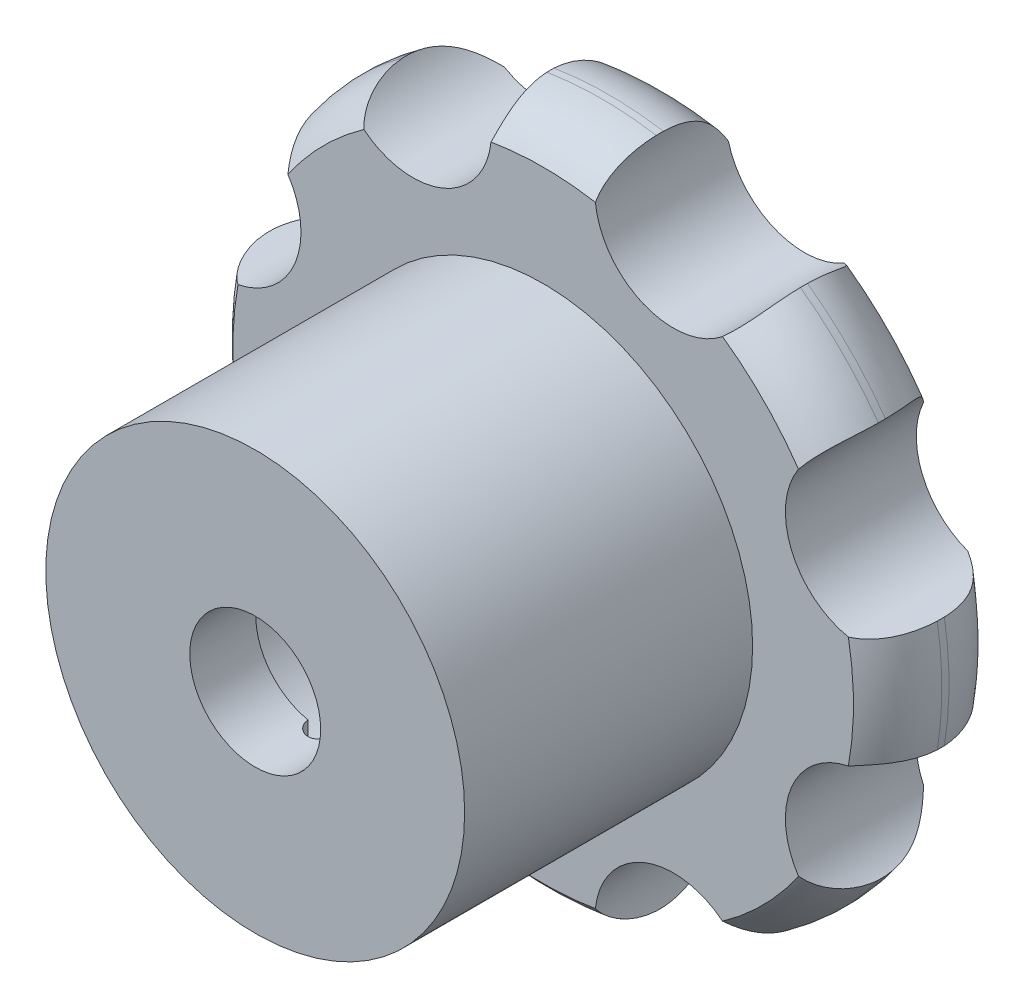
ISO-10303-21;
HEADER;
FILE_DESCRIPTION(('STEP AP214'),'2;1');
FILE_NAME('part.step','',(''),(''),'','','');
FILE_SCHEMA(('AUTOMOTIVE_DESIGN { 1 0 10303 214 1 1 1 1 }'));
ENDSEC;
DATA;
#1=APPLICATION_CONTEXT('core data for automotive mechanical design processes');
#2=APPLICATION_PROTOCOL_DEFINITION('international standard','automotive_design',2000,#1);
#3=PRODUCT_CONTEXT('',#1,'mechanical');
#4=PRODUCT('Part','Part','',(#3));
#5=PRODUCT_RELATED_PRODUCT_CATEGORY('part','',(#4));
#6=PRODUCT_DEFINITION_FORMATION('','',#4);
#7=PRODUCT_DEFINITION_CONTEXT('part definition',#1,'design');
#8=PRODUCT_DEFINITION('design','',#6,#7);
#9=PRODUCT_DEFINITION_SHAPE('','',#8);
#10=(LENGTH_UNIT() NAMED_UNIT(*) SI_UNIT(.MILLI.,.METRE.));
#11=(NAMED_UNIT(*) PLANE_ANGLE_UNIT() SI_UNIT($,.RADIAN.));
#12=(NAMED_UNIT(*) SI_UNIT($,.STERADIAN.) SOLID_ANGLE_UNIT());
#13=UNCERTAINTY_MEASURE_WITH_UNIT(LENGTH_MEASURE(1.E-05),#10,'distance_accuracy_value','');
#14=(GEOMETRIC_REPRESENTATION_CONTEXT(3) GLOBAL_UNCERTAINTY_ASSIGNED_CONTEXT((#13)) GLOBAL_UNIT_ASSIGNED_CONTEXT((#10,
#11,#12)) REPRESENTATION_CONTEXT('',''));
#15=CARTESIAN_POINT('',(0.,0.,0.));
#16=DIRECTION('',(0.,0.,1.));
#17=DIRECTION('',(1.,0.,0.));
#18=AXIS2_PLACEMENT_3D('',#15,#16,#17);
#19=CARTESIAN_POINT('',(19.4498211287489,-8.05637969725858,15.875));
#20=DIRECTION('',(0.,0.,1.));
#21=DIRECTION('',(1.,0.,0.));
#22=AXIS2_PLACEMENT_3D('',#19,#20,#21);
#23=PLANE('',#22);
#24=CARTESIAN_POINT('',(0.,0.,15.875));
#25=DIRECTION('',(0.,0.,1.));
#26=DIRECTION('',(1.,0.,0.));
#27=AXIS2_PLACEMENT_3D('',#24,#25,#26);
#28=CIRCLE('',#27,37.6279085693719);
#29=CARTESIAN_POINT('',(30.9636504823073,-21.3801742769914,15.875));
#30=VERTEX_POINT('',#29);
#31=CARTESIAN_POINT('',(21.7539925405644,-30.7021711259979,15.875));
#32=VERTEX_POINT('',#31);
#33=EDGE_CURVE('E505',#30,#32,#28,.F.);
#34=ORIENTED_EDGE('',*,*,#33,.F.);
#35=CARTESIAN_POINT('',(38.8996422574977,-16.1127593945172,15.875));
#36=DIRECTION('',(0.,0.,-1.));
#37=DIRECTION('',(-1.,0.,0.));
#38=AXIS2_PLACEMENT_3D('',#35,#36,#37);
#39=CIRCLE('',#38,9.52500000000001);
#40=CARTESIAN_POINT('',(37.0126734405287,-6.77654101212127,15.8750000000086));
#41=VERTEX_POINT('',#40);
#42=EDGE_CURVE('E670',#30,#41,#39,.T.);
#43=ORIENTED_EDGE('',*,*,#42,.T.);
#44=CARTESIAN_POINT('',(37.0126734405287,6.77654101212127,15.8750000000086));
#45=VERTEX_POINT('',#44);
#46=EDGE_CURVE('E508',#45,#41,#28,.F.);
#47=ORIENTED_EDGE('',*,*,#46,.F.);
#48=CARTESIAN_POINT('',(38.8996422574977,16.1127593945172,15.875));
#49=DIRECTION('',(0.,0.,1.));
#50=DIRECTION('',(1.,0.,0.));
#51=AXIS2_PLACEMENT_3D('',#48,#49,#50);
#52=CIRCLE('',#51,9.52500000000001);
#53=CARTESIAN_POINT('',(30.9636504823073,21.3801742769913,15.875));
#54=VERTEX_POINT('',#53);
#55=EDGE_CURVE('E673',#54,#45,#52,.T.);
#56=ORIENTED_EDGE('',*,*,#55,.F.);
#57=CARTESIAN_POINT('',(21.7539925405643,30.7021711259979,15.8750000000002));
#58=VERTEX_POINT('',#57);
#59=EDGE_CURVE('E428',#58,#54,#28,.F.);
#60=ORIENTED_EDGE('',*,*,#59,.F.);
#61=CARTESIAN_POINT('',(15.7952586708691,38.1331277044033,15.875));
#62=DIRECTION('',(0.,0.,1.));
#63=DIRECTION('',(1.,0.,0.));
#64=AXIS2_PLACEMENT_3D('',#61,#62,#63);
#65=CIRCLE('',#64,9.52499999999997);
#66=CARTESIAN_POINT('',(6.32731775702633,37.0921090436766,15.8749999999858));
#67=VERTEX_POINT('',#66);
#68=EDGE_CURVE('E676',#67,#58,#65,.T.);
#69=ORIENTED_EDGE('',*,*,#68,.F.);
#70=CARTESIAN_POINT('',(-6.32731775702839,37.0921090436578,15.875));
#71=VERTEX_POINT('',#70);
#72=EDGE_CURVE('E564',#71,#67,#28,.F.);
#73=ORIENTED_EDGE('',*,*,#72,.F.);
#74=CARTESIAN_POINT('',(-15.7952586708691,38.1331277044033,15.875));
#75=DIRECTION('',(0.,0.,-1.));
#76=DIRECTION('',(-1.,0.,0.));
#77=AXIS2_PLACEMENT_3D('',#74,#75,#76);
#78=CIRCLE('',#77,9.52499999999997);
#79=CARTESIAN_POINT('',(-21.7539925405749,30.7021711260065,15.87499999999));
#80=VERTEX_POINT('',#79);
#81=EDGE_CURVE('E678',#71,#80,#78,.T.);
#82=ORIENTED_EDGE('',*,*,#81,.T.);
#83=CARTESIAN_POINT('',(-30.9636504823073,21.3801742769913,15.875));
#84=VERTEX_POINT('',#83);
#85=EDGE_CURVE('E568',#84,#80,#28,.F.);
#86=ORIENTED_EDGE('',*,*,#85,.F.);
#87=CARTESIAN_POINT('',(-38.8996422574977,16.1127593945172,15.875));
#88=DIRECTION('',(0.,0.,-1.));
#89=DIRECTION('',(-1.,0.,0.));
#90=AXIS2_PLACEMENT_3D('',#87,#88,#89);
#91=CIRCLE('',#90,9.52499999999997);
#92=CARTESIAN_POINT('',(-37.012673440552,6.7765410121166,15.8749999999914));
#93=VERTEX_POINT('',#92);
#94=EDGE_CURVE('E680',#84,#93,#91,.T.);
#95=ORIENTED_EDGE('',*,*,#94,.T.);
#96=CARTESIAN_POINT('',(-37.012673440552,-6.77654101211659,15.8749999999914));
#97=VERTEX_POINT('',#96);
#98=EDGE_CURVE('E368',#97,#93,#28,.F.);
#99=ORIENTED_EDGE('',*,*,#98,.F.);
#100=CARTESIAN_POINT('',(-38.8996422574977,-16.1127593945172,15.875));
#101=DIRECTION('',(0.,0.,1.));
#102=DIRECTION('',(1.,0.,0.));
#103=AXIS2_PLACEMENT_3D('',#100,#101,#102);
#104=CIRCLE('',#103,9.52499999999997);
#105=CARTESIAN_POINT('',(-30.9636504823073,-21.3801742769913,15.875));
#106=VERTEX_POINT('',#105);
#107=EDGE_CURVE('E683',#106,#97,#104,.T.);
#108=ORIENTED_EDGE('',*,*,#107,.F.);
#109=CARTESIAN_POINT('',(-21.753992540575,-30.7021711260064,15.87499999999));
#110=VERTEX_POINT('',#109);
#111=EDGE_CURVE('E340',#110,#106,#28,.F.);
#112=ORIENTED_EDGE('',*,*,#111,.F.);
#113=CARTESIAN_POINT('',(-15.7952586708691,-38.1331277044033,15.875));
#114=DIRECTION('',(0.,0.,1.));
#115=DIRECTION('',(1.,0.,0.));
#116=AXIS2_PLACEMENT_3D('',#113,#114,#115);
#117=CIRCLE('',#116,9.52500000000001);
#118=CARTESIAN_POINT('',(-6.32731775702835,-37.0921090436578,15.875));
#119=VERTEX_POINT('',#118);
#120=EDGE_CURVE('E686',#119,#110,#117,.T.);
#121=ORIENTED_EDGE('',*,*,#120,.F.);
#122=CARTESIAN_POINT('',(6.32731775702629,-37.0921090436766,15.8749999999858));
#123=VERTEX_POINT('',#122);
#124=EDGE_CURVE('E509',#123,#119,#28,.F.);
#125=ORIENTED_EDGE('',*,*,#124,.F.);
#126=CARTESIAN_POINT('',(15.7952586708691,-38.1331277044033,15.875));
#127=DIRECTION('',(0.,0.,-1.));
#128=DIRECTION('',(-1.,0.,0.));
#129=AXIS2_PLACEMENT_3D('',#126,#127,#128);
#130=CIRCLE('',#129,9.52500000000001);
#131=EDGE_CURVE('E619',#123,#32,#130,.T.);
#132=ORIENTED_EDGE('',*,*,#131,.T.);
#133=EDGE_LOOP('',(#34,#43,#47,#56,#60,#69,#73,#82,#86,#95,#99,#108,#112,#121,#125,#132));
#134=FACE_BOUND('',#133,.T.);
#135=CARTESIAN_POINT('',(0.,0.,15.875));
#136=DIRECTION('',(0.,0.,1.));
#137=DIRECTION('',(1.,0.,0.));
#138=AXIS2_PLACEMENT_3D('',#135,#136,#137);
#139=CIRCLE('',#138,25.4);
#140=CARTESIAN_POINT('',(25.4,0.,15.875));
#141=VERTEX_POINT('',#140);
#142=EDGE_CURVE('E275',#141,#141,#139,.T.);
#143=ORIENTED_EDGE('',*,*,#142,.F.);
#144=EDGE_LOOP('',(#143));
#145=FACE_BOUND('',#144,.T.);
#146=ADVANCED_FACE('F34',(#134,#145),#23,.T.);
#147=CARTESIAN_POINT('',(19.4498211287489,-8.05637969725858,0.));
#148=DIRECTION('',(0.,0.,1.));
#149=DIRECTION('',(1.,0.,0.));
#150=AXIS2_PLACEMENT_3D('',#147,#148,#149);
#151=PLANE('',#150);
#152=CARTESIAN_POINT('',(38.8996422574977,-16.1127593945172,0.));
#153=DIRECTION('',(0.,0.,-1.));
#154=DIRECTION('',(-1.,0.,0.));
#155=AXIS2_PLACEMENT_3D('',#152,#153,#154);
#156=CIRCLE('',#155,9.52500000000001);
#157=CARTESIAN_POINT('',(30.2505598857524,-20.1026214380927,0.));
#158=VERTEX_POINT('',#157);
#159=CARTESIAN_POINT('',(35.6050759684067,-7.17567609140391,0.));
#160=VERTEX_POINT('',#159);
#161=EDGE_CURVE('E702',#158,#160,#156,.T.);
#162=ORIENTED_EDGE('',*,*,#161,.F.);
#163=CARTESIAN_POINT('',(0.,0.,0.));
#164=DIRECTION('',(0.,0.,1.));
#165=DIRECTION('',(1.,0.,0.));
#166=AXIS2_PLACEMENT_3D('',#163,#164,#165);
#167=CIRCLE('',#166,36.3209548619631);
#168=CARTESIAN_POINT('',(20.6041660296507,-29.9112036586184,0.));
#169=VERTEX_POINT('',#168);
#170=EDGE_CURVE('E519',#158,#169,#167,.F.);
#171=ORIENTED_EDGE('',*,*,#170,.T.);
#172=CARTESIAN_POINT('',(15.7952586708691,-38.1331277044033,0.));
#173=DIRECTION('',(0.,0.,-1.));
#174=DIRECTION('',(-1.,0.,0.));
#175=AXIS2_PLACEMENT_3D('',#172,#173,#174);
#176=CIRCLE('',#175,9.52500000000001);
#177=CARTESIAN_POINT('',(6.58106942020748,-35.7197604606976,0.));
#178=VERTEX_POINT('',#177);
#179=EDGE_CURVE('E612',#178,#169,#176,.T.);
#180=ORIENTED_EDGE('',*,*,#179,.F.);
#181=CARTESIAN_POINT('',(-6.5810694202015,-35.7197604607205,0.));
#182=VERTEX_POINT('',#181);
#183=EDGE_CURVE('E323',#178,#182,#167,.F.);
#184=ORIENTED_EDGE('',*,*,#183,.T.);
#185=CARTESIAN_POINT('',(-15.7952586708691,-38.1331277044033,0.));
#186=DIRECTION('',(0.,0.,1.));
#187=DIRECTION('',(1.,0.,0.));
#188=AXIS2_PLACEMENT_3D('',#185,#186,#187);
#189=CIRCLE('',#188,9.52500000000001);
#190=CARTESIAN_POINT('',(-20.6041660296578,-29.9112036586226,0.));
#191=VERTEX_POINT('',#190);
#192=EDGE_CURVE('E662',#182,#191,#189,.T.);
#193=ORIENTED_EDGE('',*,*,#192,.T.);
#194=CARTESIAN_POINT('',(-30.2505598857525,-20.1026214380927,0.));
#195=VERTEX_POINT('',#194);
#196=EDGE_CURVE('E529',#191,#195,#167,.F.);
#197=ORIENTED_EDGE('',*,*,#196,.T.);
#198=CARTESIAN_POINT('',(-38.8996422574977,-16.1127593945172,0.));
#199=DIRECTION('',(0.,0.,1.));
#200=DIRECTION('',(1.,0.,0.));
#201=AXIS2_PLACEMENT_3D('',#198,#199,#200);
#202=CIRCLE('',#201,9.52499999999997);
#203=CARTESIAN_POINT('',(-35.6050759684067,-7.17567609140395,0.));
#204=VERTEX_POINT('',#203);
#205=EDGE_CURVE('E660',#195,#204,#202,.T.);
#206=ORIENTED_EDGE('',*,*,#205,.T.);
#207=CARTESIAN_POINT('',(-35.6050759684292,7.17567609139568,1.11265436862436E-11));
#208=VERTEX_POINT('',#207);
#209=EDGE_CURVE('E534',#204,#208,#167,.F.);
#210=ORIENTED_EDGE('',*,*,#209,.T.);
#211=CARTESIAN_POINT('',(-38.8996422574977,16.1127593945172,0.));
#212=DIRECTION('',(0.,0.,-1.));
#213=DIRECTION('',(-1.,0.,0.));
#214=AXIS2_PLACEMENT_3D('',#211,#212,#213);
#215=CIRCLE('',#214,9.52499999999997);
#216=CARTESIAN_POINT('',(-30.2505598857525,20.1026214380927,0.));
#217=VERTEX_POINT('',#216);
#218=EDGE_CURVE('E658',#217,#208,#215,.T.);
#219=ORIENTED_EDGE('',*,*,#218,.F.);
#220=CARTESIAN_POINT('',(-20.6041660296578,29.9112036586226,4.0903843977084E-12));
#221=VERTEX_POINT('',#220);
#222=EDGE_CURVE('E385',#217,#221,#167,.F.);
#223=ORIENTED_EDGE('',*,*,#222,.T.);
#224=CARTESIAN_POINT('',(-15.7952586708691,38.1331277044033,0.));
#225=DIRECTION('',(0.,0.,-1.));
#226=DIRECTION('',(-1.,0.,0.));
#227=AXIS2_PLACEMENT_3D('',#224,#225,#226);
#228=CIRCLE('',#227,9.52499999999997);
#229=CARTESIAN_POINT('',(-6.58106942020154,35.7197604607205,0.));
#230=VERTEX_POINT('',#229);
#231=EDGE_CURVE('E654',#230,#221,#228,.T.);
#232=ORIENTED_EDGE('',*,*,#231,.F.);
#233=CARTESIAN_POINT('',(6.58106942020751,35.7197604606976,-1.16689285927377E-11));
#234=VERTEX_POINT('',#233);
#235=EDGE_CURVE('E412',#230,#234,#167,.F.);
#236=ORIENTED_EDGE('',*,*,#235,.T.);
#237=CARTESIAN_POINT('',(15.7952586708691,38.1331277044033,0.));
#238=DIRECTION('',(0.,0.,1.));
#239=DIRECTION('',(1.,0.,0.));
#240=AXIS2_PLACEMENT_3D('',#237,#238,#239);
#241=CIRCLE('',#240,9.52499999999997);
#242=CARTESIAN_POINT('',(20.6041660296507,29.9112036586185,0.));
#243=VERTEX_POINT('',#242);
#244=EDGE_CURVE('E664',#234,#243,#241,.T.);
#245=ORIENTED_EDGE('',*,*,#244,.T.);
#246=CARTESIAN_POINT('',(30.2505598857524,20.1026214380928,0.));
#247=VERTEX_POINT('',#246);
#248=EDGE_CURVE('E527',#243,#247,#167,.F.);
#249=ORIENTED_EDGE('',*,*,#248,.T.);
#250=CARTESIAN_POINT('',(38.8996422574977,16.1127593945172,0.));
#251=DIRECTION('',(0.,0.,1.));
#252=DIRECTION('',(1.,0.,0.));
#253=AXIS2_PLACEMENT_3D('',#250,#251,#252);
#254=CIRCLE('',#253,9.52500000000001);
#255=CARTESIAN_POINT('',(35.6050759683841,7.17567609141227,0.));
#256=VERTEX_POINT('',#255);
#257=EDGE_CURVE('E701',#247,#256,#254,.T.);
#258=ORIENTED_EDGE('',*,*,#257,.T.);
#259=EDGE_CURVE('E62',#256,#160,#167,.F.);
#260=ORIENTED_EDGE('',*,*,#259,.T.);
#261=EDGE_LOOP('',(#162,#171,#180,#184,#193,#197,#206,#210,#219,#223,#232,#236,#245,#249,#258,#260));
#262=FACE_BOUND('',#261,.T.);
#263=CARTESIAN_POINT('',(0.,0.,0.));
#264=DIRECTION('',(0.,0.,1.));
#265=DIRECTION('',(1.,0.,0.));
#266=AXIS2_PLACEMENT_3D('',#263,#264,#265);
#267=CIRCLE('',#266,12.7);
#268=CARTESIAN_POINT('',(12.7,0.,0.));
#269=VERTEX_POINT('',#268);
#270=EDGE_CURVE('E526',#269,#269,#267,.T.);
#271=ORIENTED_EDGE('',*,*,#270,.T.);
#272=EDGE_LOOP('',(#271));
#273=FACE_BOUND('',#272,.T.);
#274=ADVANCED_FACE('F446',(#262,#273),#151,.F.);
#275=CARTESIAN_POINT('',(0.,0.,15.875));
#276=DIRECTION('',(0.,0.,-1.));
#277=DIRECTION('',(-1.,0.,0.));
#278=AXIS2_PLACEMENT_3D('',#275,#276,#277);
#279=CYLINDRICAL_SURFACE('',#278,41.275);
#280=DIRECTION('',(0.,0.,-1.));
#281=VECTOR('',#280,1.);
#282=CARTESIAN_POINT('',(33.5734165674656,-24.0094007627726,15.875));
#283=LINE('',#282,#281);
#284=CARTESIAN_POINT('',(33.5734165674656,-24.0094007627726,8.79773186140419));
#285=VERTEX_POINT('',#284);
#286=CARTESIAN_POINT('',(33.5734165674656,-24.0094007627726,7.93750000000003));
#287=VERTEX_POINT('',#286);
#288=EDGE_CURVE('E290',#285,#287,#283,.T.);
#289=ORIENTED_EDGE('',*,*,#288,.F.);
#290=CARTESIAN_POINT('',(0.,0.,8.79773186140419));
#291=DIRECTION('',(0.,0.,-1.));
#292=DIRECTION('',(-1.,0.,0.));
#293=AXIS2_PLACEMENT_3D('',#290,#291,#292);
#294=CIRCLE('',#293,41.275);
#295=CARTESIAN_POINT('',(24.1158515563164,-33.4970346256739,8.79773186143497));
#296=VERTEX_POINT('',#295);
#297=EDGE_CURVE('E500',#285,#296,#294,.T.);
#298=ORIENTED_EDGE('',*,*,#297,.T.);
#299=DIRECTION('',(0.,0.,-1.));
#300=VECTOR('',#299,1.);
#301=CARTESIAN_POINT('',(24.1158515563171,-33.4970346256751,15.875));
#302=LINE('',#301,#300);
#303=CARTESIAN_POINT('',(24.1158515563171,-33.4970346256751,7.93750000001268));
#304=VERTEX_POINT('',#303);
#305=EDGE_CURVE('E606',#296,#304,#302,.T.);
#306=ORIENTED_EDGE('',*,*,#305,.T.);
#307=CARTESIAN_POINT('',(0.,0.,7.93750000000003));
#308=DIRECTION('',(0.,0.,1.));
#309=DIRECTION('',(1.,0.,0.));
#310=AXIS2_PLACEMENT_3D('',#307,#308,#309);
#311=CIRCLE('',#310,41.275);
#312=EDGE_CURVE('E515',#304,#287,#311,.T.);
#313=ORIENTED_EDGE('',*,*,#312,.T.);
#314=EDGE_LOOP('',(#289,#298,#306,#313));
#315=FACE_BOUND('',#314,.T.);
#316=ADVANCED_FACE('F304',(#315),#279,.T.);
#317=CARTESIAN_POINT('',(38.8996422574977,-16.1127593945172,15.875));
#318=DIRECTION('',(0.,0.,-1.));
#319=DIRECTION('',(-1.,0.,0.));
#320=AXIS2_PLACEMENT_3D('',#317,#318,#319);
#321=CYLINDRICAL_SURFACE('',#320,9.52500000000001);
#322=ORIENTED_EDGE('',*,*,#42,.F.);
#323=CARTESIAN_POINT('',(30.106141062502,-19.7733552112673,16.8932611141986));
#324=CARTESIAN_POINT('',(30.1451292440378,-19.8670181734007,16.85119971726));
#325=CARTESIAN_POINT('',(30.1853296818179,-19.9593635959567,16.8073677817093));
#326=CARTESIAN_POINT('',(30.267913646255,-20.1412650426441,16.7161243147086));
#327=CARTESIAN_POINT('',(30.3102971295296,-20.2308211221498,16.6687128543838));
#328=CARTESIAN_POINT('',(30.4402920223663,-20.4949363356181,16.5211287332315));
#329=CARTESIAN_POINT('',(30.530811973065,-20.6650950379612,16.4155381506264));
#330=CARTESIAN_POINT('',(30.7167110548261,-20.9913141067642,16.1909289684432));
#331=CARTESIAN_POINT('',(30.8120525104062,-21.147463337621,16.0720076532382));
#332=CARTESIAN_POINT('',(31.0059510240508,-21.4463319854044,15.8206645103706));
#333=CARTESIAN_POINT('',(31.1045082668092,-21.5890506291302,15.6882419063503));
#334=CARTESIAN_POINT('',(31.3024970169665,-21.8605601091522,15.4108822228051));
#335=CARTESIAN_POINT('',(31.4019271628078,-21.9893695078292,15.265962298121));
#336=CARTESIAN_POINT('',(31.5997224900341,-22.2333365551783,14.9643990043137));
#337=CARTESIAN_POINT('',(31.6980876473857,-22.3484938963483,14.8077553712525));
#338=CARTESIAN_POINT('',(31.8919614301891,-22.5656074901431,14.4835819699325));
#339=CARTESIAN_POINT('',(31.9874663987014,-22.6675473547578,14.3160390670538));
#340=CARTESIAN_POINT('',(32.17376894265,-22.858577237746,13.9713036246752));
#341=CARTESIAN_POINT('',(32.2645663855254,-22.9476668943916,13.7941108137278));
#342=CARTESIAN_POINT('',(32.4447672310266,-23.1182178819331,13.4210957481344));
#343=CARTESIAN_POINT('',(32.5338160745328,-23.1989852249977,13.2247851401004));
#344=CARTESIAN_POINT('',(32.7033778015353,-23.3477199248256,12.8238165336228));
#345=CARTESIAN_POINT('',(32.7838904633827,-23.4156869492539,12.619158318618));
#346=CARTESIAN_POINT('',(32.9350342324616,-23.5396453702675,12.2026237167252));
#347=CARTESIAN_POINT('',(33.0056624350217,-23.5956332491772,11.9907452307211));
#348=CARTESIAN_POINT('',(33.1358465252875,-23.6963638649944,11.5609942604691));
#349=CARTESIAN_POINT('',(33.195401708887,-23.7411058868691,11.343121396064));
#350=CARTESIAN_POINT('',(33.3093661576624,-23.8250931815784,10.8741501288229));
#351=CARTESIAN_POINT('',(33.3621237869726,-23.8628875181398,10.6223876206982));
#352=CARTESIAN_POINT('',(33.4511961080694,-23.925763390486,10.1143952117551));
#353=CARTESIAN_POINT('',(33.4875095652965,-23.9508439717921,9.85816497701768));
#354=CARTESIAN_POINT('',(33.5429430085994,-23.9888327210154,9.34294204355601));
#355=CARTESIAN_POINT('',(33.5620621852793,-24.0017403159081,9.08394921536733));
#356=CARTESIAN_POINT('',(33.5827076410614,-24.0156693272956,8.56494777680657));
#357=CARTESIAN_POINT('',(33.5842339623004,-24.0166907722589,8.30493916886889));
#358=CARTESIAN_POINT('',(33.5694327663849,-24.0067178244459,7.77751904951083));
#359=CARTESIAN_POINT('',(33.5525458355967,-23.9953469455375,7.51013010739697));
#360=CARTESIAN_POINT('',(33.5003968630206,-23.9597184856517,6.97800944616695));
#361=CARTESIAN_POINT('',(33.4651342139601,-23.9354604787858,6.71327781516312));
#362=CARTESIAN_POINT('',(33.3769885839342,-23.8734824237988,6.18823902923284));
#363=CARTESIAN_POINT('',(33.3240978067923,-23.8357564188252,5.92793388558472));
#364=CARTESIAN_POINT('',(33.2018597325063,-23.7460183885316,5.41372586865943));
#365=CARTESIAN_POINT('',(33.1325124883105,-23.6940064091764,5.15982297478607));
#366=CARTESIAN_POINT('',(32.9788509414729,-23.5746171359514,4.66013576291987));
#367=CARTESIAN_POINT('',(32.8945290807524,-23.5072320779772,4.41435561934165));
#368=CARTESIAN_POINT('',(32.7128356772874,-23.3558955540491,3.93290309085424));
#369=CARTESIAN_POINT('',(32.615463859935,-23.2719437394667,3.69723091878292));
#370=CARTESIAN_POINT('',(32.4099744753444,-23.086209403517,3.23796250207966));
#371=CARTESIAN_POINT('',(32.3018597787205,-22.9844316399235,3.01436305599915));
#372=CARTESIAN_POINT('',(32.0775467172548,-22.7617888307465,2.58113917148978));
#373=CARTESIAN_POINT('',(31.961349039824,-22.6409254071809,2.37151354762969));
#374=CARTESIAN_POINT('',(31.7303701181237,-22.3861242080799,1.97906503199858));
#375=CARTESIAN_POINT('',(31.6158487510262,-22.2532390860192,1.79540699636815));
#376=CARTESIAN_POINT('',(31.3853528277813,-21.968914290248,1.44401230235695));
#377=CARTESIAN_POINT('',(31.269378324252,-21.8174752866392,1.27627506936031));
#378=CARTESIAN_POINT('',(31.0394548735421,-21.496254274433,0.95845283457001));
#379=CARTESIAN_POINT('',(30.9255030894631,-21.3265007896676,0.808341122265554));
#380=CARTESIAN_POINT('',(30.7029332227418,-20.9690809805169,0.526644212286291));
#381=CARTESIAN_POINT('',(30.5943141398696,-20.7814180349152,0.395055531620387));
#382=CARTESIAN_POINT('',(30.4013395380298,-20.4185960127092,0.169117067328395));
#383=CARTESIAN_POINT('',(30.3157742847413,-20.2457082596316,0.072138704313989));
#384=CARTESIAN_POINT('',(30.153036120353,-19.8891194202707,-0.107953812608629));
#385=CARTESIAN_POINT('',(30.0758622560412,-19.7054195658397,-0.191069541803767));
#386=CARTESIAN_POINT('',(29.9316890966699,-19.3286769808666,-0.343840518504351));
#387=CARTESIAN_POINT('',(29.8646900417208,-19.1356340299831,-0.413495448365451));
#388=CARTESIAN_POINT('',(29.7423517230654,-18.7418581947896,-0.540131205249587));
#389=CARTESIAN_POINT('',(29.6870126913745,-18.5411251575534,-0.597111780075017));
#390=CARTESIAN_POINT('',(29.5915244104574,-18.1435995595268,-0.697020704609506));
#391=CARTESIAN_POINT('',(29.5507679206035,-17.9470891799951,-0.740497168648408));
#392=CARTESIAN_POINT('',(29.4815639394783,-17.5501245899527,-0.818143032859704));
#393=CARTESIAN_POINT('',(29.4531159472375,-17.3496705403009,-0.85231281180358));
#394=CARTESIAN_POINT('',(29.4089869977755,-16.946030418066,-0.912640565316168));
#395=CARTESIAN_POINT('',(29.3933154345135,-16.7428424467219,-0.938792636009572));
#396=CARTESIAN_POINT('',(29.3750511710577,-16.3351219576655,-0.984359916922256));
#397=CARTESIAN_POINT('',(29.3724599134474,-16.1305892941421,-1.0037743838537));
#398=CARTESIAN_POINT('',(29.3810002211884,-15.6952384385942,-1.03925935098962));
#399=CARTESIAN_POINT('',(29.3939236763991,-15.4643939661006,-1.05458782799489));
#400=CARTESIAN_POINT('',(29.4365751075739,-15.0039487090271,-1.07994884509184));
#401=CARTESIAN_POINT('',(29.4663058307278,-14.7743481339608,-1.08998051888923));
#402=CARTESIAN_POINT('',(29.5423883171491,-14.3180869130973,-1.10613475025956));
#403=CARTESIAN_POINT('',(29.5887188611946,-14.0914228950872,-1.11226227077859));
#404=CARTESIAN_POINT('',(29.697750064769,-13.6420853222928,-1.12169534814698));
#405=CARTESIAN_POINT('',(29.7604450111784,-13.4194104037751,-1.12500188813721));
#406=CARTESIAN_POINT('',(29.8869658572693,-13.0255936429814,-1.1290027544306));
#407=CARTESIAN_POINT('',(29.9477707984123,-12.8534783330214,-1.13010065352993));
#408=CARTESIAN_POINT('',(30.0791641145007,-12.5130252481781,-1.13110854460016));
#409=CARTESIAN_POINT('',(30.1497523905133,-12.3446874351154,-1.13101854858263));
#410=CARTESIAN_POINT('',(30.3300278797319,-11.9472084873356,-1.1293800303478));
#411=CARTESIAN_POINT('',(30.4441982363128,-11.7200857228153,-1.1272738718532));
#412=CARTESIAN_POINT('',(30.6903495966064,-11.275641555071,-1.12019876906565));
#413=CARTESIAN_POINT('',(30.8223382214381,-11.0583243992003,-1.115228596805));
#414=CARTESIAN_POINT('',(31.1035133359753,-10.6345486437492,-1.10124720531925));
#415=CARTESIAN_POINT('',(31.2527370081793,-10.4281149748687,-1.09222712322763));
#416=CARTESIAN_POINT('',(31.5670498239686,-10.0280729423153,-1.0684565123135));
#417=CARTESIAN_POINT('',(31.7321372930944,-9.83446322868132,-1.05370658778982));
#418=CARTESIAN_POINT('',(32.0775976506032,-9.46066485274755,-1.01628873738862));
#419=CARTESIAN_POINT('',(32.2580321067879,-9.28053627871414,-0.993587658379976));
#420=CARTESIAN_POINT('',(32.6319098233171,-8.93600774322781,-0.937857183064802));
#421=CARTESIAN_POINT('',(32.8253535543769,-8.77160835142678,-0.904827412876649));
#422=CARTESIAN_POINT('',(33.2227636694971,-8.46015948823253,-0.825981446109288));
#423=CARTESIAN_POINT('',(33.426710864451,-8.31307988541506,-0.780187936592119));
#424=CARTESIAN_POINT('',(33.8427772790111,-8.03711565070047,-0.673389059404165));
#425=CARTESIAN_POINT('',(34.054895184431,-7.90822810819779,-0.612386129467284));
#426=CARTESIAN_POINT('',(34.4651471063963,-7.68002436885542,-0.479290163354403));
#427=CARTESIAN_POINT('',(34.6628602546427,-7.57910142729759,-0.408653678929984));
#428=CARTESIAN_POINT('',(35.0597135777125,-7.39332359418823,-0.25192193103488));
#429=CARTESIAN_POINT('',(35.2588536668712,-7.30846774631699,-0.165827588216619));
#430=CARTESIAN_POINT('',(35.6556138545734,-7.15468084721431,0.022413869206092));
#431=CARTESIAN_POINT('',(35.8532343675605,-7.08574529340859,0.124556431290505));
#432=CARTESIAN_POINT('',(36.2441357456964,-6.96312165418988,0.344993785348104));
#433=CARTESIAN_POINT('',(36.4374168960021,-6.90943256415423,0.463287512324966));
#434=CARTESIAN_POINT('',(36.7939334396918,-6.82184302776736,0.700286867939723));
#435=CARTESIAN_POINT('',(36.9579700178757,-6.7863323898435,0.817202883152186));
#436=CARTESIAN_POINT('',(37.2790321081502,-6.7252171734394,1.06263085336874));
#437=CARTESIAN_POINT('',(37.4360583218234,-6.69961160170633,1.19114164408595));
#438=CARTESIAN_POINT('',(37.7417872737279,-6.65713515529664,1.45908956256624));
#439=CARTESIAN_POINT('',(37.890488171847,-6.64026620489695,1.59852908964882));
#440=CARTESIAN_POINT('',(38.1784340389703,-6.61400206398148,1.88750598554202));
#441=CARTESIAN_POINT('',(38.3176783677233,-6.60460737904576,2.03704403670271));
#442=CARTESIAN_POINT('',(38.5938619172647,-6.59160571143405,2.35458506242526));
#443=CARTESIAN_POINT('',(38.7301638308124,-6.58837898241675,2.52315753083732));
#444=CARTESIAN_POINT('',(38.990358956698,-6.58730262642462,2.86962188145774));
#445=CARTESIAN_POINT('',(39.1142518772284,-6.58945312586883,3.04751398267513));
#446=CARTESIAN_POINT('',(39.3490854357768,-6.59764309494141,3.41165212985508));
#447=CARTESIAN_POINT('',(39.4600210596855,-6.6036840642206,3.59790137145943));
#448=CARTESIAN_POINT('',(39.6684559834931,-6.61826276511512,3.97768390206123));
#449=CARTESIAN_POINT('',(39.7659540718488,-6.62680072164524,4.17121784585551));
#450=CARTESIAN_POINT('',(39.9602875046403,-6.64642234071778,4.5930136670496));
#451=CARTESIAN_POINT('',(40.0549902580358,-6.65769558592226,4.8222519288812));
#452=CARTESIAN_POINT('',(40.2260060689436,-6.68016568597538,5.28749795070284));
#453=CARTESIAN_POINT('',(40.3023176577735,-6.69136253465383,5.52350624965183));
#454=CARTESIAN_POINT('',(40.4363051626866,-6.71228625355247,6.00087058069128));
#455=CARTESIAN_POINT('',(40.4939773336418,-6.7220128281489,6.24222767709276));
#456=CARTESIAN_POINT('',(40.5904827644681,-6.73890840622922,6.72876639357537));
#457=CARTESIAN_POINT('',(40.6293156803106,-6.74607736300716,6.97394808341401));
#458=CARTESIAN_POINT('',(40.6901989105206,-6.75751611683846,7.4849226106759));
#459=CARTESIAN_POINT('',(40.7107918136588,-6.76153161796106,7.75089607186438));
#460=CARTESIAN_POINT('',(40.7300277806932,-6.76527806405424,8.28367517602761));
#461=CARTESIAN_POINT('',(40.7286696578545,-6.76500877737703,8.55048086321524));
#462=CARTESIAN_POINT('',(40.7040025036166,-6.76021605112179,9.08312766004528));
#463=CARTESIAN_POINT('',(40.6806861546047,-6.75569119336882,9.34896841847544));
#464=CARTESIAN_POINT('',(40.612174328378,-6.74291041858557,9.87772212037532));
#465=CARTESIAN_POINT('',(40.5669789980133,-6.73465452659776,10.1406350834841));
#466=CARTESIAN_POINT('',(40.4545617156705,-6.71535987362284,10.6631207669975));
#467=CARTESIAN_POINT('',(40.3872201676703,-6.70430607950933,10.9226672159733));
#468=CARTESIAN_POINT('',(40.2308275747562,-6.68090820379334,11.4350856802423));
#469=CARTESIAN_POINT('',(40.1417760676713,-6.66856409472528,11.6879575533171));
#470=CARTESIAN_POINT('',(39.9423088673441,-6.64446709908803,12.1852078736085));
#471=CARTESIAN_POINT('',(39.831890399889,-6.63271428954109,12.4295852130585));
#472=CARTESIAN_POINT('',(39.5902075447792,-6.61205170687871,12.9079426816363));
#473=CARTESIAN_POINT('',(39.4589437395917,-6.60314185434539,13.1419231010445));
#474=CARTESIAN_POINT('',(39.1781601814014,-6.59080941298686,13.5945936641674));
#475=CARTESIAN_POINT('',(39.0289024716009,-6.58731638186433,13.8134441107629));
#476=CARTESIAN_POINT('',(38.711820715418,-6.58829241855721,14.2372900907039));
#477=CARTESIAN_POINT('',(38.5439961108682,-6.59276172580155,14.4422852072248));
#478=CARTESIAN_POINT('',(38.191646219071,-6.61247406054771,14.8360752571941));
#479=CARTESIAN_POINT('',(38.0071575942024,-6.62769391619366,15.0249040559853));
#480=CARTESIAN_POINT('',(37.6232527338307,-6.67169254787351,15.3849813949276));
#481=CARTESIAN_POINT('',(37.423839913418,-6.70046822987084,15.5562339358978));
#482=CARTESIAN_POINT('',(37.0378387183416,-6.76969044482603,15.8598857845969));
#483=CARTESIAN_POINT('',(36.8526416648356,-6.80829118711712,15.994477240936));
#484=CARTESIAN_POINT('',(36.4751482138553,-6.89944599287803,16.2480470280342));
#485=CARTESIAN_POINT('',(36.2828527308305,-6.95199826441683,16.3670273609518));
#486=CARTESIAN_POINT('',(35.892003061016,-7.07274295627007,16.5899472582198));
#487=CARTESIAN_POINT('',(35.6934084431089,-7.14107020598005,16.6937437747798));
#488=CARTESIAN_POINT('',(35.3942762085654,-7.25558865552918,16.8372364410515));
#489=CARTESIAN_POINT('',(35.2943116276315,-7.29578772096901,16.88305224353));
#490=CARTESIAN_POINT('',(35.0943362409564,-7.3802306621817,16.9706810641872));
#491=CARTESIAN_POINT('',(34.9943254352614,-7.42447453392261,17.0124940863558));
#492=CARTESIAN_POINT('',(34.8944597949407,-7.47076087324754,17.0523493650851));
#493=B_SPLINE_CURVE_WITH_KNOTS('',3,(#323,#324,#325,#326,#327,#328,#329,#330,#331,#332,#333,
#334,#335,#336,#337,#338,#339,#340,#341,#342,#343,#344,#345,#346,#347,#348,#349,#350,#351,#352,
#353,#354,#355,#356,#357,#358,#359,#360,#361,#362,#363,#364,#365,#366,#367,#368,#369,#370,#371,
#372,#373,#374,#375,#376,#377,#378,#379,#380,#381,#382,#383,#384,#385,#386,#387,#388,#389,#390,
#391,#392,#393,#394,#395,#396,#397,#398,#399,#400,#401,#402,#403,#404,#405,#406,#407,#408,#409,
#410,#411,#412,#413,#414,#415,#416,#417,#418,#419,#420,#421,#422,#423,#424,#425,#426,#427,#428,
#429,#430,#431,#432,#433,#434,#435,#436,#437,#438,#439,#440,#441,#442,#443,#444,#445,#446,#447,
#448,#449,#450,#451,#452,#453,#454,#455,#456,#457,#458,#459,#460,#461,#462,#463,#464,#465,#466,
#467,#468,#469,#470,#471,#472,#473,#474,#475,#476,#477,#478,#479,#480,#481,#482,#483,#484,#485,
#486,#487,#488,#489,#490,#491,#492),.UNSPECIFIED.,.F.,.F.,(4,2,2,2,2,2,2,2,2,2,2,2,2,2,2,2,2,2,
2,2,2,2,2,2,2,2,2,2,2,2,2,2,2,2,2,2,2,2,2,2,2,2,2,2,2,2,2,2,2,2,2,2,2,2,2,2,2,2,2,2,2,2,2,2,2,2,
2,2,2,2,2,2,2,2,2,2,2,2,2,2,2,2,2,2,4),(0.,0.329421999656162,0.658837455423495,1.31713340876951,
1.97090464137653,2.62471348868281,3.27763873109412,3.93057867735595,4.58432059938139,
5.23808092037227,5.92798286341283,6.61790271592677,7.30802488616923,7.9981909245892,
8.77727912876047,9.55642581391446,10.3356091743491,11.1147906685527,11.9183211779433,
12.7218782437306,13.5257911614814,14.3297014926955,15.1340187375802,15.9383529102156,
16.7424727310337,17.5465242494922,18.3073356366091,19.0681195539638,19.8277352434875,
20.5872079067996,21.2340789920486,21.8808765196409,22.5276893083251,23.174514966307,
23.7899229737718,24.405305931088,25.0211409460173,25.637043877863,26.3314789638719,
27.0260275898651,27.7196915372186,28.4131136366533,28.9604478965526,29.5077766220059,
30.2695490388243,31.031648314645,31.7954235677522,32.5591182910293,33.3260359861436,
34.0929814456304,34.858572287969,35.6240405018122,36.3218596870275,37.0196373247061,
37.7172173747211,38.4147514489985,39.0276959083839,39.6405788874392,40.2535967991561,
40.8666561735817,41.516425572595,42.1662102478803,42.8162455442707,43.4663394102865,
44.210395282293,44.9545105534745,45.6987752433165,46.4430535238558,47.2425025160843,
48.0419947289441,48.8417534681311,49.6415068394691,50.4456520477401,51.2498143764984,
52.0540811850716,52.8583255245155,53.6520207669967,54.4457398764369,55.2377533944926,
56.0295862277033,56.7250846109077,57.4204937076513,58.1220822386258,58.4732056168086,
58.82432864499),.UNSPECIFIED.);
#494=EDGE_CURVE('E507',#30,#285,#493,.T.);
#495=ORIENTED_EDGE('',*,*,#494,.T.);
#496=ORIENTED_EDGE('',*,*,#288,.T.);
#497=EDGE_CURVE('E517',#287,#158,#493,.T.);
#498=ORIENTED_EDGE('',*,*,#497,.T.);
#499=ORIENTED_EDGE('',*,*,#161,.T.);
#500=CARTESIAN_POINT('',(40.7172006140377,-6.76278043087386,7.93750000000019));
#501=VERTEX_POINT('',#500);
#502=EDGE_CURVE('E516',#160,#501,#493,.T.);
#503=ORIENTED_EDGE('',*,*,#502,.T.);
#504=DIRECTION('',(0.,0.,-1.));
#505=VECTOR('',#504,1.);
#506=CARTESIAN_POINT('',(40.7172006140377,-6.76278043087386,15.875));
#507=LINE('',#506,#505);
#508=CARTESIAN_POINT('',(40.7172006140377,-6.76278043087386,8.79773186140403));
#509=VERTEX_POINT('',#508);
#510=EDGE_CURVE('E594',#509,#501,#507,.T.);
#511=ORIENTED_EDGE('',*,*,#510,.F.);
#512=EDGE_CURVE('E525',#509,#41,#493,.T.);
#513=ORIENTED_EDGE('',*,*,#512,.T.);
#514=EDGE_LOOP('',(#322,#495,#496,#498,#499,#503,#511,#513));
#515=FACE_BOUND('',#514,.T.);
#516=ADVANCED_FACE('F36',(#515),#321,.F.);
#517=CARTESIAN_POINT('',(0.,0.,15.875));
#518=DIRECTION('',(0.,0.,-1.));
#519=DIRECTION('',(-1.,0.,0.));
#520=AXIS2_PLACEMENT_3D('',#517,#518,#519);
#521=CYLINDRICAL_SURFACE('',#520,41.275);
#522=DIRECTION('',(0.,0.,-1.));
#523=VECTOR('',#522,1.);
#524=CARTESIAN_POINT('',(40.7172006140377,6.76278043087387,15.875));
#525=LINE('',#524,#523);
#526=CARTESIAN_POINT('',(40.7172006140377,6.76278043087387,8.79773186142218));
#527=VERTEX_POINT('',#526);
#528=CARTESIAN_POINT('',(40.7172006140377,6.76278043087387,7.93750000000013));
#529=VERTEX_POINT('',#528);
#530=EDGE_CURVE('E592',#527,#529,#525,.T.);
#531=ORIENTED_EDGE('',*,*,#530,.F.);
#532=CARTESIAN_POINT('',(0.,0.,8.79773186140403));
#533=DIRECTION('',(0.,0.,-1.));
#534=DIRECTION('',(-1.,0.,0.));
#535=AXIS2_PLACEMENT_3D('',#532,#533,#534);
#536=CIRCLE('',#535,41.275);
#537=EDGE_CURVE('E555',#527,#509,#536,.T.);
#538=ORIENTED_EDGE('',*,*,#537,.T.);
#539=ORIENTED_EDGE('',*,*,#510,.T.);
#540=CARTESIAN_POINT('',(0.,0.,7.93750000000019));
#541=DIRECTION('',(0.,0.,1.));
#542=DIRECTION('',(1.,0.,0.));
#543=AXIS2_PLACEMENT_3D('',#540,#541,#542);
#544=CIRCLE('',#543,41.275);
#545=EDGE_CURVE('E708',#501,#529,#544,.T.);
#546=ORIENTED_EDGE('',*,*,#545,.T.);
#547=EDGE_LOOP('',(#531,#538,#539,#546));
#548=FACE_BOUND('',#547,.T.);
#549=ADVANCED_FACE('F436',(#548),#521,.T.);
#550=CARTESIAN_POINT('',(38.8996422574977,16.1127593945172,15.875));
#551=DIRECTION('',(0.,0.,-1.));
#552=DIRECTION('',(-1.,0.,0.));
#553=AXIS2_PLACEMENT_3D('',#550,#551,#552);
#554=CYLINDRICAL_SURFACE('',#553,9.52500000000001);
#555=CARTESIAN_POINT('',(30.106141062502,19.7733552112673,16.8932611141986));
#556=CARTESIAN_POINT('',(30.1451292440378,19.8670181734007,16.85119971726));
#557=CARTESIAN_POINT('',(30.1853296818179,19.9593635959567,16.8073677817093));
#558=CARTESIAN_POINT('',(30.267913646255,20.1412650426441,16.7161243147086));
#559=CARTESIAN_POINT('',(30.3102971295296,20.2308211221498,16.6687128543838));
#560=CARTESIAN_POINT('',(30.4402920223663,20.4949363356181,16.5211287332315));
#561=CARTESIAN_POINT('',(30.530811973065,20.6650950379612,16.4155381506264));
#562=CARTESIAN_POINT('',(30.7167110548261,20.9913141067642,16.1909289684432));
#563=CARTESIAN_POINT('',(30.8120525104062,21.147463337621,16.0720076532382));
#564=CARTESIAN_POINT('',(31.0059510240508,21.4463319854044,15.8206645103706));
#565=CARTESIAN_POINT('',(31.1045082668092,21.5890506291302,15.6882419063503));
#566=CARTESIAN_POINT('',(31.3024970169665,21.8605601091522,15.4108822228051));
#567=CARTESIAN_POINT('',(31.4019271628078,21.9893695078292,15.265962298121));
#568=CARTESIAN_POINT('',(31.5997224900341,22.2333365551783,14.9643990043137));
#569=CARTESIAN_POINT('',(31.6980876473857,22.3484938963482,14.8077553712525));
#570=CARTESIAN_POINT('',(31.8919614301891,22.5656074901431,14.4835819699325));
#571=CARTESIAN_POINT('',(31.9874663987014,22.6675473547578,14.3160390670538));
#572=CARTESIAN_POINT('',(32.17376894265,22.858577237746,13.9713036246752));
#573=CARTESIAN_POINT('',(32.2645663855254,22.9476668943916,13.7941108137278));
#574=CARTESIAN_POINT('',(32.4447672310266,23.1182178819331,13.4210957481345));
#575=CARTESIAN_POINT('',(32.5338160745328,23.1989852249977,13.2247851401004));
#576=CARTESIAN_POINT('',(32.7033778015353,23.3477199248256,12.8238165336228));
#577=CARTESIAN_POINT('',(32.7838904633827,23.4156869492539,12.619158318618));
#578=CARTESIAN_POINT('',(32.9350342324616,23.5396453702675,12.2026237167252));
#579=CARTESIAN_POINT('',(33.0056624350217,23.5956332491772,11.9907452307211));
#580=CARTESIAN_POINT('',(33.1358465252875,23.6963638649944,11.5609942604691));
#581=CARTESIAN_POINT('',(33.195401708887,23.7411058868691,11.343121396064));
#582=CARTESIAN_POINT('',(33.3093661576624,23.8250931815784,10.8741501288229));
#583=CARTESIAN_POINT('',(33.3621237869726,23.8628875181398,10.6223876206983));
#584=CARTESIAN_POINT('',(33.4511961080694,23.925763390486,10.1143952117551));
#585=CARTESIAN_POINT('',(33.4875095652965,23.9508439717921,9.85816497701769));
#586=CARTESIAN_POINT('',(33.5429430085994,23.9888327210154,9.34294204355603));
#587=CARTESIAN_POINT('',(33.5620621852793,24.0017403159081,9.08394921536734));
#588=CARTESIAN_POINT('',(33.5827076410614,24.0156693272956,8.56494777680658));
#589=CARTESIAN_POINT('',(33.5842339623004,24.0166907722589,8.3049391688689));
#590=CARTESIAN_POINT('',(33.5694327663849,24.0067178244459,7.77751904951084));
#591=CARTESIAN_POINT('',(33.5525458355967,23.9953469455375,7.51013010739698));
#592=CARTESIAN_POINT('',(33.5003968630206,23.9597184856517,6.97800944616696));
#593=CARTESIAN_POINT('',(33.4651342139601,23.9354604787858,6.71327781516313));
#594=CARTESIAN_POINT('',(33.3769885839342,23.8734824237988,6.18823902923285));
#595=CARTESIAN_POINT('',(33.3240978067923,23.8357564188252,5.92793388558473));
#596=CARTESIAN_POINT('',(33.2018597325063,23.7460183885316,5.41372586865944));
#597=CARTESIAN_POINT('',(33.1325124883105,23.6940064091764,5.15982297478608));
#598=CARTESIAN_POINT('',(32.9788509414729,23.5746171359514,4.66013576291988));
#599=CARTESIAN_POINT('',(32.8945290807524,23.5072320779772,4.41435561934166));
#600=CARTESIAN_POINT('',(32.7128356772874,23.3558955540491,3.93290309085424));
#601=CARTESIAN_POINT('',(32.615463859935,23.2719437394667,3.69723091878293));
#602=CARTESIAN_POINT('',(32.4099744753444,23.086209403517,3.23796250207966));
#603=CARTESIAN_POINT('',(32.3018597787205,22.9844316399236,3.01436305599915));
#604=CARTESIAN_POINT('',(32.0775467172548,22.7617888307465,2.58113917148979));
#605=CARTESIAN_POINT('',(31.961349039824,22.640925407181,2.3715135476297));
#606=CARTESIAN_POINT('',(31.7303701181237,22.3861242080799,1.97906503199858));
#607=CARTESIAN_POINT('',(31.6158487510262,22.2532390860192,1.79540699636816));
#608=CARTESIAN_POINT('',(31.3853528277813,21.968914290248,1.44401230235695));
#609=CARTESIAN_POINT('',(31.269378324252,21.8174752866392,1.27627506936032));
#610=CARTESIAN_POINT('',(31.0394548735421,21.496254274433,0.958452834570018));
#611=CARTESIAN_POINT('',(30.9255030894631,21.3265007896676,0.808341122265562));
#612=CARTESIAN_POINT('',(30.7029332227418,20.9690809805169,0.526644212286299));
#613=CARTESIAN_POINT('',(30.5943141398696,20.7814180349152,0.395055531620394));
#614=CARTESIAN_POINT('',(30.4013395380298,20.4185960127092,0.169117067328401));
#615=CARTESIAN_POINT('',(30.3157742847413,20.2457082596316,0.072138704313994));
#616=CARTESIAN_POINT('',(30.153036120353,19.8891194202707,-0.107953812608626));
#617=CARTESIAN_POINT('',(30.0758622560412,19.7054195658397,-0.191069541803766));
#618=CARTESIAN_POINT('',(29.9316890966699,19.3286769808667,-0.343840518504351));
#619=CARTESIAN_POINT('',(29.8646900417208,19.1356340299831,-0.413495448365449));
#620=CARTESIAN_POINT('',(29.7423517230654,18.7418581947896,-0.540131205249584));
#621=CARTESIAN_POINT('',(29.6870126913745,18.5411251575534,-0.597111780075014));
#622=CARTESIAN_POINT('',(29.5915244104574,18.1435995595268,-0.697020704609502));
#623=CARTESIAN_POINT('',(29.5507679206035,17.9470891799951,-0.740497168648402));
#624=CARTESIAN_POINT('',(29.4815639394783,17.5501245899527,-0.818143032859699));
#625=CARTESIAN_POINT('',(29.4531159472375,17.3496705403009,-0.852312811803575));
#626=CARTESIAN_POINT('',(29.4089869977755,16.946030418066,-0.912640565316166));
#627=CARTESIAN_POINT('',(29.3933154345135,16.742842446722,-0.938792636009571));
#628=CARTESIAN_POINT('',(29.3750511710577,16.3351219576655,-0.984359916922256));
#629=CARTESIAN_POINT('',(29.3724599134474,16.1305892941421,-1.0037743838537));
#630=CARTESIAN_POINT('',(29.3810002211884,15.6952384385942,-1.03925935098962));
#631=CARTESIAN_POINT('',(29.3939236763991,15.4643939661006,-1.05458782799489));
#632=CARTESIAN_POINT('',(29.4365751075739,15.0039487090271,-1.07994884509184));
#633=CARTESIAN_POINT('',(29.4663058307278,14.7743481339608,-1.08998051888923));
#634=CARTESIAN_POINT('',(29.5423883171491,14.3180869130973,-1.10613475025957));
#635=CARTESIAN_POINT('',(29.5887188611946,14.0914228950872,-1.11226227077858));
#636=CARTESIAN_POINT('',(29.697750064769,13.6420853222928,-1.12169534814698));
#637=CARTESIAN_POINT('',(29.7604450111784,13.4194104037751,-1.12500188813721));
#638=CARTESIAN_POINT('',(29.8869658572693,13.0255936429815,-1.1290027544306));
#639=CARTESIAN_POINT('',(29.9477707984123,12.8534783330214,-1.13010065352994));
#640=CARTESIAN_POINT('',(30.0791641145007,12.5130252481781,-1.13110854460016));
#641=CARTESIAN_POINT('',(30.1497523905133,12.3446874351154,-1.13101854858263));
#642=CARTESIAN_POINT('',(30.3300278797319,11.9472084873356,-1.1293800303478));
#643=CARTESIAN_POINT('',(30.4441982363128,11.7200857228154,-1.1272738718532));
#644=CARTESIAN_POINT('',(30.6903495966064,11.275641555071,-1.12019876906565));
#645=CARTESIAN_POINT('',(30.822338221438,11.0583243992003,-1.115228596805));
#646=CARTESIAN_POINT('',(31.1035133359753,10.6345486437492,-1.10124720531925));
#647=CARTESIAN_POINT('',(31.2527370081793,10.4281149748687,-1.09222712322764));
#648=CARTESIAN_POINT('',(31.5670498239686,10.0280729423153,-1.0684565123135));
#649=CARTESIAN_POINT('',(31.7321372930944,9.83446322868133,-1.05370658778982));
#650=CARTESIAN_POINT('',(32.0775976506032,9.46066485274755,-1.01628873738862));
#651=CARTESIAN_POINT('',(32.2580321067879,9.28053627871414,-0.993587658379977));
#652=CARTESIAN_POINT('',(32.6319098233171,8.93600774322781,-0.937857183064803));
#653=CARTESIAN_POINT('',(32.8253535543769,8.77160835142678,-0.904827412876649));
#654=CARTESIAN_POINT('',(33.2227636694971,8.46015948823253,-0.825981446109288));
#655=CARTESIAN_POINT('',(33.426710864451,8.31307988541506,-0.780187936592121));
#656=CARTESIAN_POINT('',(33.8427772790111,8.03711565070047,-0.673389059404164));
#657=CARTESIAN_POINT('',(34.054895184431,7.90822810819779,-0.61238612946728));
#658=CARTESIAN_POINT('',(34.4651471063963,7.68002436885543,-0.479290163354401));
#659=CARTESIAN_POINT('',(34.6628602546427,7.5791014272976,-0.408653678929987));
#660=CARTESIAN_POINT('',(35.0597135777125,7.39332359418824,-0.251921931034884));
#661=CARTESIAN_POINT('',(35.2588536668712,7.30846774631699,-0.165827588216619));
#662=CARTESIAN_POINT('',(35.6556138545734,7.15468084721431,0.0224138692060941));
#663=CARTESIAN_POINT('',(35.8532343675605,7.08574529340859,0.124556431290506));
#664=CARTESIAN_POINT('',(36.2441357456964,6.96312165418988,0.344993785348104));
#665=CARTESIAN_POINT('',(36.4374168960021,6.90943256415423,0.463287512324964));
#666=CARTESIAN_POINT('',(36.7939334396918,6.82184302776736,0.700286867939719));
#667=CARTESIAN_POINT('',(36.9579700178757,6.7863323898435,0.817202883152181));
#668=CARTESIAN_POINT('',(37.2790321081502,6.7252171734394,1.06263085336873));
#669=CARTESIAN_POINT('',(37.4360583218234,6.69961160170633,1.19114164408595));
#670=CARTESIAN_POINT('',(37.7417872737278,6.65713515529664,1.45908956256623));
#671=CARTESIAN_POINT('',(37.890488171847,6.64026620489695,1.59852908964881));
#672=CARTESIAN_POINT('',(38.1784340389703,6.61400206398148,1.88750598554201));
#673=CARTESIAN_POINT('',(38.3176783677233,6.60460737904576,2.03704403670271));
#674=CARTESIAN_POINT('',(38.5938619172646,6.59160571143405,2.35458506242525));
#675=CARTESIAN_POINT('',(38.7301638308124,6.58837898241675,2.52315753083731));
#676=CARTESIAN_POINT('',(38.990358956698,6.58730262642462,2.86962188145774));
#677=CARTESIAN_POINT('',(39.1142518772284,6.58945312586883,3.04751398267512));
#678=CARTESIAN_POINT('',(39.3490854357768,6.59764309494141,3.41165212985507));
#679=CARTESIAN_POINT('',(39.4600210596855,6.6036840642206,3.59790137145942));
#680=CARTESIAN_POINT('',(39.6684559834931,6.61826276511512,3.97768390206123));
#681=CARTESIAN_POINT('',(39.7659540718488,6.62680072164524,4.1712178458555));
#682=CARTESIAN_POINT('',(39.9602875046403,6.64642234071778,4.59301366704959));
#683=CARTESIAN_POINT('',(40.0549902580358,6.65769558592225,4.82225192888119));
#684=CARTESIAN_POINT('',(40.2260060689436,6.68016568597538,5.28749795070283));
#685=CARTESIAN_POINT('',(40.3023176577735,6.69136253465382,5.52350624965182));
#686=CARTESIAN_POINT('',(40.4363051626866,6.71228625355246,6.00087058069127));
#687=CARTESIAN_POINT('',(40.4939773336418,6.7220128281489,6.24222767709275));
#688=CARTESIAN_POINT('',(40.5904827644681,6.73890840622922,6.72876639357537));
#689=CARTESIAN_POINT('',(40.6293156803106,6.74607736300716,6.97394808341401));
#690=CARTESIAN_POINT('',(40.6901989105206,6.75751611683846,7.4849226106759));
#691=CARTESIAN_POINT('',(40.7107918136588,6.76153161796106,7.75089607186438));
#692=CARTESIAN_POINT('',(40.7300277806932,6.76527806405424,8.28367517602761));
#693=CARTESIAN_POINT('',(40.7286696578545,6.76500877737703,8.55048086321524));
#694=CARTESIAN_POINT('',(40.7040025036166,6.76021605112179,9.08312766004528));
#695=CARTESIAN_POINT('',(40.6806861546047,6.75569119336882,9.34896841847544));
#696=CARTESIAN_POINT('',(40.612174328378,6.74291041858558,9.87772212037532));
#697=CARTESIAN_POINT('',(40.5669789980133,6.73465452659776,10.1406350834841));
#698=CARTESIAN_POINT('',(40.4545617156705,6.71535987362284,10.6631207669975));
#699=CARTESIAN_POINT('',(40.3872201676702,6.70430607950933,10.9226672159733));
#700=CARTESIAN_POINT('',(40.2308275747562,6.68090820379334,11.4350856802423));
#701=CARTESIAN_POINT('',(40.1417760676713,6.66856409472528,11.6879575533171));
#702=CARTESIAN_POINT('',(39.9423088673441,6.64446709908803,12.1852078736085));
#703=CARTESIAN_POINT('',(39.831890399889,6.63271428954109,12.4295852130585));
#704=CARTESIAN_POINT('',(39.5902075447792,6.61205170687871,12.9079426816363));
#705=CARTESIAN_POINT('',(39.4589437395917,6.60314185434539,13.1419231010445));
#706=CARTESIAN_POINT('',(39.1781601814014,6.59080941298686,13.5945936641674));
#707=CARTESIAN_POINT('',(39.0289024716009,6.58731638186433,13.8134441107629));
#708=CARTESIAN_POINT('',(38.711820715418,6.58829241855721,14.2372900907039));
#709=CARTESIAN_POINT('',(38.5439961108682,6.59276172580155,14.4422852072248));
#710=CARTESIAN_POINT('',(38.191646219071,6.61247406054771,14.8360752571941));
#711=CARTESIAN_POINT('',(38.0071575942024,6.62769391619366,15.0249040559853));
#712=CARTESIAN_POINT('',(37.6232527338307,6.67169254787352,15.3849813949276));
#713=CARTESIAN_POINT('',(37.423839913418,6.70046822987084,15.5562339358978));
#714=CARTESIAN_POINT('',(37.0378387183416,6.76969044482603,15.8598857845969));
#715=CARTESIAN_POINT('',(36.8526416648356,6.80829118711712,15.994477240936));
#716=CARTESIAN_POINT('',(36.4751482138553,6.89944599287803,16.2480470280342));
#717=CARTESIAN_POINT('',(36.2828527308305,6.95199826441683,16.3670273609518));
#718=CARTESIAN_POINT('',(35.892003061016,7.07274295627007,16.5899472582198));
#719=CARTESIAN_POINT('',(35.6934084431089,7.14107020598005,16.6937437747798));
#720=CARTESIAN_POINT('',(35.3942762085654,7.25558865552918,16.8372364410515));
#721=CARTESIAN_POINT('',(35.2943116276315,7.29578772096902,16.88305224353));
#722=CARTESIAN_POINT('',(35.0943362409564,7.3802306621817,16.9706810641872));
#723=CARTESIAN_POINT('',(34.9943254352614,7.42447453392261,17.0124940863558));
#724=CARTESIAN_POINT('',(34.8944597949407,7.47076087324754,17.0523493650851));
#725=B_SPLINE_CURVE_WITH_KNOTS('',3,(#555,#556,#557,#558,#559,#560,#561,#562,#563,#564,#565,
#566,#567,#568,#569,#570,#571,#572,#573,#574,#575,#576,#577,#578,#579,#580,#581,#582,#583,#584,
#585,#586,#587,#588,#589,#590,#591,#592,#593,#594,#595,#596,#597,#598,#599,#600,#601,#602,#603,
#604,#605,#606,#607,#608,#609,#610,#611,#612,#613,#614,#615,#616,#617,#618,#619,#620,#621,#622,
#623,#624,#625,#626,#627,#628,#629,#630,#631,#632,#633,#634,#635,#636,#637,#638,#639,#640,#641,
#642,#643,#644,#645,#646,#647,#648,#649,#650,#651,#652,#653,#654,#655,#656,#657,#658,#659,#660,
#661,#662,#663,#664,#665,#666,#667,#668,#669,#670,#671,#672,#673,#674,#675,#676,#677,#678,#679,
#680,#681,#682,#683,#684,#685,#686,#687,#688,#689,#690,#691,#692,#693,#694,#695,#696,#697,#698,
#699,#700,#701,#702,#703,#704,#705,#706,#707,#708,#709,#710,#711,#712,#713,#714,#715,#716,#717,
#718,#719,#720,#721,#722,#723,#724),.UNSPECIFIED.,.F.,.F.,(4,2,2,2,2,2,2,2,2,2,2,2,2,2,2,2,2,2,
2,2,2,2,2,2,2,2,2,2,2,2,2,2,2,2,2,2,2,2,2,2,2,2,2,2,2,2,2,2,2,2,2,2,2,2,2,2,2,2,2,2,2,2,2,2,2,2,
2,2,2,2,2,2,2,2,2,2,2,2,2,2,2,2,2,2,4),(0.,0.329421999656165,0.658837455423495,1.31713340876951,
1.97090464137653,2.62471348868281,3.27763873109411,3.93057867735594,4.58432059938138,
5.23808092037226,5.92798286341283,6.61790271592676,7.30802488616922,7.99819092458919,
8.77727912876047,9.55642581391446,10.3356091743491,11.1147906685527,11.9183211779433,
12.7218782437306,13.5257911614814,14.3297014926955,15.1340187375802,15.9383529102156,
16.7424727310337,17.5465242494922,18.3073356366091,19.0681195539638,19.8277352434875,
20.5872079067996,21.2340789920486,21.8808765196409,22.5276893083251,23.174514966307,
23.7899229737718,24.405305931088,25.0211409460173,25.637043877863,26.3314789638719,
27.0260275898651,27.7196915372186,28.4131136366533,28.9604478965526,29.5077766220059,
30.2695490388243,31.031648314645,31.7954235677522,32.5591182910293,33.3260359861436,
34.0929814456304,34.858572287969,35.6240405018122,36.3218596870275,37.0196373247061,
37.7172173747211,38.4147514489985,39.0276959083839,39.6405788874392,40.2535967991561,
40.8666561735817,41.516425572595,42.1662102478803,42.8162455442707,43.4663394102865,
44.210395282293,44.9545105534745,45.6987752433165,46.4430535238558,47.2425025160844,
48.0419947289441,48.8417534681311,49.6415068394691,50.4456520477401,51.2498143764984,
52.0540811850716,52.8583255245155,53.6520207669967,54.4457398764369,55.2377533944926,
56.0295862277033,56.7250846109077,57.4204937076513,58.1220822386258,58.4732056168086,
58.82432864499),.UNSPECIFIED.);
#726=CARTESIAN_POINT('',(33.5734165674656,24.0094007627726,8.79773186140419));
#727=VERTEX_POINT('',#726);
#728=EDGE_CURVE('E422',#54,#727,#725,.T.);
#729=ORIENTED_EDGE('',*,*,#728,.F.);
#730=ORIENTED_EDGE('',*,*,#55,.T.);
#731=EDGE_CURVE('E552',#527,#45,#725,.T.);
#732=ORIENTED_EDGE('',*,*,#731,.F.);
#733=ORIENTED_EDGE('',*,*,#530,.T.);
#734=EDGE_CURVE('E429',#256,#529,#725,.T.);
#735=ORIENTED_EDGE('',*,*,#734,.F.);
#736=ORIENTED_EDGE('',*,*,#257,.F.);
#737=CARTESIAN_POINT('',(33.5734165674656,24.0094007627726,7.93750000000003));
#738=VERTEX_POINT('',#737);
#739=EDGE_CURVE('E430',#738,#247,#725,.T.);
#740=ORIENTED_EDGE('',*,*,#739,.F.);
#741=DIRECTION('',(0.,0.,-1.));
#742=VECTOR('',#741,1.);
#743=CARTESIAN_POINT('',(33.5734165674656,24.0094007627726,15.875));
#744=LINE('',#743,#742);
#745=EDGE_CURVE('E585',#727,#738,#744,.T.);
#746=ORIENTED_EDGE('',*,*,#745,.F.);
#747=EDGE_LOOP('',(#729,#730,#732,#733,#735,#736,#740,#746));
#748=FACE_BOUND('',#747,.T.);
#749=ADVANCED_FACE('F433',(#748),#554,.F.);
#750=CARTESIAN_POINT('',(0.,0.,15.875));
#751=DIRECTION('',(0.,0.,-1.));
#752=DIRECTION('',(-1.,0.,0.));
#753=AXIS2_PLACEMENT_3D('',#750,#751,#752);
#754=CYLINDRICAL_SURFACE('',#753,41.275);
#755=DIRECTION('',(0.,0.,-1.));
#756=VECTOR('',#755,1.);
#757=CARTESIAN_POINT('',(24.1158515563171,33.4970346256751,15.875));
#758=LINE('',#757,#756);
#759=CARTESIAN_POINT('',(24.1158515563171,33.4970346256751,8.79773186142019));
#760=VERTEX_POINT('',#759);
#761=CARTESIAN_POINT('',(24.1158515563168,33.4970346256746,7.93749999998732));
#762=VERTEX_POINT('',#761);
#763=EDGE_CURVE('E583',#760,#762,#758,.T.);
#764=ORIENTED_EDGE('',*,*,#763,.F.);
#765=CARTESIAN_POINT('',(0.,0.,8.79773186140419));
#766=DIRECTION('',(0.,0.,-1.));
#767=DIRECTION('',(-1.,0.,0.));
#768=AXIS2_PLACEMENT_3D('',#765,#766,#767);
#769=CIRCLE('',#768,41.275);
#770=EDGE_CURVE('E419',#760,#727,#769,.T.);
#771=ORIENTED_EDGE('',*,*,#770,.T.);
#772=ORIENTED_EDGE('',*,*,#745,.T.);
#773=CARTESIAN_POINT('',(0.,0.,7.93750000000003));
#774=DIRECTION('',(0.,0.,1.));
#775=DIRECTION('',(1.,0.,0.));
#776=AXIS2_PLACEMENT_3D('',#773,#774,#775);
#777=CIRCLE('',#776,41.275);
#778=EDGE_CURVE('E431',#738,#762,#777,.T.);
#779=ORIENTED_EDGE('',*,*,#778,.T.);
#780=EDGE_LOOP('',(#764,#771,#772,#779));
#781=FACE_BOUND('',#780,.T.);
#782=ADVANCED_FACE('F403',(#781),#754,.T.);
#783=CARTESIAN_POINT('',(15.7952586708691,38.1331277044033,15.875));
#784=DIRECTION('',(0.,0.,-1.));
#785=DIRECTION('',(-1.,0.,0.));
#786=AXIS2_PLACEMENT_3D('',#783,#784,#785);
#787=CYLINDRICAL_SURFACE('',#786,9.52499999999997);
#788=CARTESIAN_POINT('',(20.9253663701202,30.1076918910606,16.537712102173));
#789=CARTESIAN_POINT('',(21.0111711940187,30.1625389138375,16.4811584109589));
#790=CARTESIAN_POINT('',(21.0951377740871,30.2181537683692,16.4226019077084));
#791=CARTESIAN_POINT('',(21.2593214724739,30.3305937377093,16.3015494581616));
#792=CARTESIAN_POINT('',(21.339538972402,30.38741872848,16.2390539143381));
#793=CARTESIAN_POINT('',(21.574288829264,30.559095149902,16.0459007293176));
#794=CARTESIAN_POINT('',(21.723132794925,30.6752863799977,15.9094352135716));
#795=CARTESIAN_POINT('',(22.0042805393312,30.9077045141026,15.623031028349));
#796=CARTESIAN_POINT('',(22.1366924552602,31.023925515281,15.4731929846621));
#797=CARTESIAN_POINT('',(22.3864266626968,31.254824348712,15.160285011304));
#798=CARTESIAN_POINT('',(22.5037458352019,31.3695018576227,14.9972123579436));
#799=CARTESIAN_POINT('',(22.723396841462,31.5946879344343,14.6596123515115));
#800=CARTESIAN_POINT('',(22.8257768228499,31.7052090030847,14.4851245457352));
#801=CARTESIAN_POINT('',(23.0167268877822,31.9205011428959,14.1254107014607));
#802=CARTESIAN_POINT('',(23.1052974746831,32.0252724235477,13.9401850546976));
#803=CARTESIAN_POINT('',(23.2696083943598,32.2274757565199,13.5598508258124));
#804=CARTESIAN_POINT('',(23.3453276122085,32.3248955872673,13.3647266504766));
#805=CARTESIAN_POINT('',(23.4846577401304,32.51065053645,12.9660093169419));
#806=CARTESIAN_POINT('',(23.548267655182,32.5989849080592,12.7624154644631));
#807=CARTESIAN_POINT('',(23.6692697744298,32.772371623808,12.3299651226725));
#808=CARTESIAN_POINT('',(23.7256493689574,32.8564803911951,12.100446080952));
#809=CARTESIAN_POINT('',(23.8261984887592,33.0108121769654,11.6341773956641));
#810=CARTESIAN_POINT('',(23.8703674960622,33.0810346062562,11.3974274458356));
#811=CARTESIAN_POINT('',(23.9474047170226,33.2063080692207,10.9181678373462));
#812=CARTESIAN_POINT('',(23.9802739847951,33.2613605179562,10.6756587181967));
#813=CARTESIAN_POINT('',(24.0354552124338,33.3552878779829,10.1863419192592));
#814=CARTESIAN_POINT('',(24.0577669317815,33.3941624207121,9.93953414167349));
#815=CARTESIAN_POINT('',(24.0935484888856,33.457079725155,9.42618060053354));
#816=CARTESIAN_POINT('',(24.1063104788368,33.4799283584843,9.1594379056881));
#817=CARTESIAN_POINT('',(24.1207573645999,33.5058266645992,8.62468511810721));
#818=CARTESIAN_POINT('',(24.1224417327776,33.5088753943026,8.35667496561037));
#819=CARTESIAN_POINT('',(24.1147803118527,33.4951058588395,7.82130179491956));
#820=CARTESIAN_POINT('',(24.1054336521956,33.4782860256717,7.55393882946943));
#821=CARTESIAN_POINT('',(24.0754417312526,33.4251428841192,7.02180219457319));
#822=CARTESIAN_POINT('',(24.0547965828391,33.3888197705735,6.75702849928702));
#823=CARTESIAN_POINT('',(24.0017577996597,33.2976587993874,6.23313212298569));
#824=CARTESIAN_POINT('',(23.9694177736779,33.2429055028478,5.97398928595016));
#825=CARTESIAN_POINT('',(23.892140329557,33.1159924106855,5.46191594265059));
#826=CARTESIAN_POINT('',(23.8472027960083,33.0438324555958,5.20898549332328));
#827=CARTESIAN_POINT('',(23.743632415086,32.8835483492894,4.71094282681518));
#828=CARTESIAN_POINT('',(23.6849917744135,32.7954151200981,4.46583514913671));
#829=CARTESIAN_POINT('',(23.5527773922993,32.605021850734,3.98531383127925));
#830=CARTESIAN_POINT('',(23.4792036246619,32.5027617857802,3.74990020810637));
#831=CARTESIAN_POINT('',(23.3154478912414,32.2858281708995,3.28962617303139));
#832=CARTESIAN_POINT('',(23.2252035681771,32.1711087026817,3.06480950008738));
#833=CARTESIAN_POINT('',(23.0268970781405,31.9320683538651,2.62849049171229));
#834=CARTESIAN_POINT('',(22.9188344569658,31.8077472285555,2.41698849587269));
#835=CARTESIAN_POINT('',(22.6837448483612,31.5525165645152,2.00938001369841));
#836=CARTESIAN_POINT('',(22.5567383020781,31.4216142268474,1.81325727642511));
#837=CARTESIAN_POINT('',(22.2827039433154,31.1563801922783,1.43804297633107));
#838=CARTESIAN_POINT('',(22.1356794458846,31.0220490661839,1.2589486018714));
#839=CARTESIAN_POINT('',(21.8364945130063,30.7667242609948,0.936113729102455));
#840=CARTESIAN_POINT('',(21.6862354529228,30.6457082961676,0.79062870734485));
#841=CARTESIAN_POINT('',(21.3691636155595,30.4067708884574,0.51605376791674));
#842=CARTESIAN_POINT('',(21.202352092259,30.2888492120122,0.386962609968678));
#843=CARTESIAN_POINT('',(20.8530440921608,30.0592150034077,0.146073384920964));
#844=CARTESIAN_POINT('',(20.6705636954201,29.9474962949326,0.0342579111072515));
#845=CARTESIAN_POINT('',(20.2910491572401,29.7330704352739,-0.171930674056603));
#846=CARTESIAN_POINT('',(20.0940167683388,29.6303622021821,-0.266305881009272));
#847=CARTESIAN_POINT('',(19.7164757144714,29.45056375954,-0.425566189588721));
#848=CARTESIAN_POINT('',(19.5376663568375,29.3719136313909,-0.492740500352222));
#849=CARTESIAN_POINT('',(19.1720338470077,29.2246011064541,-0.615081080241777));
#850=CARTESIAN_POINT('',(18.9852116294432,29.1559375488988,-0.670248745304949));
#851=CARTESIAN_POINT('',(18.6049365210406,29.0297501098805,-0.769444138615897));
#852=CARTESIAN_POINT('',(18.4114822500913,28.9722285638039,-0.81346953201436));
#853=CARTESIAN_POINT('',(18.0194175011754,28.8692283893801,-0.891480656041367));
#854=CARTESIAN_POINT('',(17.8208067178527,28.8237504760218,-0.925465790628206));
#855=CARTESIAN_POINT('',(17.415364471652,28.7445978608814,-0.985345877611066));
#856=CARTESIAN_POINT('',(17.2084484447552,28.711208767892,-1.01104367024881));
#857=CARTESIAN_POINT('',(16.7920852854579,28.6581071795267,-1.05478440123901));
#858=CARTESIAN_POINT('',(16.5826381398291,28.6383947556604,-1.0728272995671));
#859=CARTESIAN_POINT('',(16.1623155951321,28.6128724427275,-1.10278509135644));
#860=CARTESIAN_POINT('',(15.9514392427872,28.6070729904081,-1.11469537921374));
#861=CARTESIAN_POINT('',(15.5295492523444,28.6094972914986,-1.13383464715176));
#862=CARTESIAN_POINT('',(15.3185356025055,28.6177224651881,-1.14106315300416));
#863=CARTESIAN_POINT('',(14.8634276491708,28.6506479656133,-1.15309136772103));
#864=CARTESIAN_POINT('',(14.6194921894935,28.6777935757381,-1.15731060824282));
#865=CARTESIAN_POINT('',(14.1343871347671,28.7508403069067,-1.16308836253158));
#866=CARTESIAN_POINT('',(13.8932180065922,28.7967445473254,-1.16464643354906));
#867=CARTESIAN_POINT('',(13.4154231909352,28.9069669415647,-1.16651220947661));
#868=CARTESIAN_POINT('',(13.1787924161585,28.9712630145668,-1.16682140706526));
#869=CARTESIAN_POINT('',(12.711268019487,29.1178834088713,-1.16711004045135));
#870=CARTESIAN_POINT('',(12.4803726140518,29.2002020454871,-1.16708958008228));
#871=CARTESIAN_POINT('',(12.0196404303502,29.3847838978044,-1.16709115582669));
#872=CARTESIAN_POINT('',(11.7899904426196,29.4875138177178,-1.16711432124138));
#873=CARTESIAN_POINT('',(11.3394775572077,29.7108435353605,-1.16698302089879));
#874=CARTESIAN_POINT('',(11.1186170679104,29.8314481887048,-1.16682850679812));
#875=CARTESIAN_POINT('',(10.6765096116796,30.0961116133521,-1.16547110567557));
#876=CARTESIAN_POINT('',(10.4557779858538,30.2410322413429,-1.16421702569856));
#877=CARTESIAN_POINT('',(10.0270331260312,30.5487454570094,-1.15895686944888));
#878=CARTESIAN_POINT('',(9.81902528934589,30.7115455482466,-1.15494963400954));
#879=CARTESIAN_POINT('',(9.41711177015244,31.0539585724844,-1.14196306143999));
#880=CARTESIAN_POINT('',(9.22322125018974,31.2335891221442,-1.1329784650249));
#881=CARTESIAN_POINT('',(8.85130824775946,31.6080406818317,-1.1073815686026));
#882=CARTESIAN_POINT('',(8.67328116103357,31.8028572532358,-1.0907714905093));
#883=CARTESIAN_POINT('',(8.36569551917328,32.1687855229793,-1.05104202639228));
#884=CARTESIAN_POINT('',(8.23324567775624,32.3376642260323,-1.02968243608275));
#885=CARTESIAN_POINT('',(7.98061871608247,32.6831012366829,-0.978333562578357));
#886=CARTESIAN_POINT('',(7.86043938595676,32.8596581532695,-0.948345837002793));
#887=CARTESIAN_POINT('',(7.63316597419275,33.2187650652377,-0.878235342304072));
#888=CARTESIAN_POINT('',(7.52605533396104,33.4013070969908,-0.838125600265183));
#889=CARTESIAN_POINT('',(7.32528563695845,33.7708582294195,-0.746369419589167));
#890=CARTESIAN_POINT('',(7.23162662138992,33.9578673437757,-0.694722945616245));
#891=CARTESIAN_POINT('',(7.05764647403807,34.3353429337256,-0.578467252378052));
#892=CARTESIAN_POINT('',(6.97739745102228,34.5258223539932,-0.513791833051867));
#893=CARTESIAN_POINT('',(6.83089004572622,34.9070735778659,-0.370854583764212));
#894=CARTESIAN_POINT('',(6.76463163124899,35.0978453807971,-0.292592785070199));
#895=CARTESIAN_POINT('',(6.64580876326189,35.4774257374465,-0.122074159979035));
#896=CARTESIAN_POINT('',(6.59324634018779,35.6662339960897,-0.0298152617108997));
#897=CARTESIAN_POINT('',(6.50118234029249,36.0396262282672,0.168686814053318));
#898=CARTESIAN_POINT('',(6.46168039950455,36.2242103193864,0.274929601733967));
#899=CARTESIAN_POINT('',(6.39683018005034,36.5758437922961,0.494023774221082));
#900=CARTESIAN_POINT('',(6.37075637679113,36.7432708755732,0.60605736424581));
#901=CARTESIAN_POINT('',(6.32820659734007,37.0711130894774,0.841586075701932));
#902=CARTESIAN_POINT('',(6.3117301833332,37.2315285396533,0.965080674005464));
#903=CARTESIAN_POINT('',(6.28719367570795,37.5441306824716,1.22288906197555));
#904=CARTESIAN_POINT('',(6.27913526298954,37.6963157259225,1.35720500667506));
#905=CARTESIAN_POINT('',(6.27016836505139,37.9914240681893,1.63588625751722));
#906=CARTESIAN_POINT('',(6.26926075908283,38.1343462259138,1.78025279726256));
#907=CARTESIAN_POINT('',(6.27343088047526,38.4198884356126,2.08878249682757));
#908=CARTESIAN_POINT('',(6.27893729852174,38.5617694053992,2.25362355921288));
#909=CARTESIAN_POINT('',(6.29504922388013,38.8332267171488,2.592893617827));
#910=CARTESIAN_POINT('',(6.30565490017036,38.9628026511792,2.76732293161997));
#911=CARTESIAN_POINT('',(6.33042202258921,39.2091516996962,3.1248632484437));
#912=CARTESIAN_POINT('',(6.34458505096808,39.3259190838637,3.30797808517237));
#913=CARTESIAN_POINT('',(6.37500007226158,39.5461792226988,3.68185879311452));
#914=CARTESIAN_POINT('',(6.39125221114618,39.6496710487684,3.8726251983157));
#915=CARTESIAN_POINT('',(6.42697932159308,39.8575726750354,4.28998458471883));
#916=CARTESIAN_POINT('',(6.4465721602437,39.9597937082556,4.51766080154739));
#917=CARTESIAN_POINT('',(6.484869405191,40.1459136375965,4.98046325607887));
#918=CARTESIAN_POINT('',(6.50357373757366,40.22981101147,5.21559011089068));
#919=CARTESIAN_POINT('',(6.53850695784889,40.3790240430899,5.6918957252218));
#920=CARTESIAN_POINT('',(6.55473540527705,40.4443363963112,5.93307555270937));
#921=CARTESIAN_POINT('',(6.58342373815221,40.5561535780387,6.41997617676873));
#922=CARTESIAN_POINT('',(6.59588357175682,40.6026581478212,6.66569703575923));
#923=CARTESIAN_POINT('',(6.61678506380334,40.6792912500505,7.17741032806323));
#924=CARTESIAN_POINT('',(6.62488637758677,40.708053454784,7.44362257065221));
#925=CARTESIAN_POINT('',(6.63499267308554,40.7437780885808,7.9776309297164));
#926=CARTESIAN_POINT('',(6.63699734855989,40.7507394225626,8.2454271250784));
#927=CARTESIAN_POINT('',(6.63474130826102,40.7428334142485,8.78071139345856));
#928=CARTESIAN_POINT('',(6.63047966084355,40.7279628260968,9.04819941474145));
#929=CARTESIAN_POINT('',(6.61604941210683,40.6764434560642,9.58090421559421));
#930=CARTESIAN_POINT('',(6.60588087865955,40.6397949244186,9.84612102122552));
#931=CARTESIAN_POINT('',(6.58056243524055,40.5450537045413,10.3713113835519));
#932=CARTESIAN_POINT('',(6.56543339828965,40.4870507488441,10.6313021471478));
#933=CARTESIAN_POINT('',(6.53151074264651,40.3497899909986,11.1453693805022));
#934=CARTESIAN_POINT('',(6.51271708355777,40.270531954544,11.3994457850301));
#935=CARTESIAN_POINT('',(6.47319818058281,40.0909989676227,11.9000551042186));
#936=CARTESIAN_POINT('',(6.45247197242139,39.9907134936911,12.1465841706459));
#937=CARTESIAN_POINT('',(6.41120426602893,39.7695256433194,12.630239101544));
#938=CARTESIAN_POINT('',(6.39066276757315,39.6486232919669,12.8673649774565));
#939=CARTESIAN_POINT('',(6.35207631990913,39.3859809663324,13.3317759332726));
#940=CARTESIAN_POINT('',(6.33404594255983,39.2441284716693,13.5589987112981));
#941=CARTESIAN_POINT('',(6.30334202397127,38.9408209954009,14.0003927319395));
#942=CARTESIAN_POINT('',(6.29066868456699,38.7793652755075,14.2145634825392));
#943=CARTESIAN_POINT('',(6.27362341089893,38.4383380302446,14.627485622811));
#944=CARTESIAN_POINT('',(6.26923145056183,38.2588113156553,14.8262730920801));
#945=CARTESIAN_POINT('',(6.27169325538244,37.8828631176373,15.2071098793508));
#946=CARTESIAN_POINT('',(6.27854516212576,37.6864444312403,15.3891619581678));
#947=CARTESIAN_POINT('',(6.30510203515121,37.2984926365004,15.7180985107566));
#948=CARTESIAN_POINT('',(6.32350550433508,37.108311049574,15.8666813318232));
#949=CARTESIAN_POINT('',(6.37391126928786,36.7180158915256,16.1475515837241));
#950=CARTESIAN_POINT('',(6.40591061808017,36.5179044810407,16.2798425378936));
#951=CARTESIAN_POINT('',(6.48562416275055,36.1082198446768,16.5285336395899));
#952=CARTESIAN_POINT('',(6.5334885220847,35.8985733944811,16.6447662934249));
#953=CARTESIAN_POINT('',(6.61797000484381,35.5806645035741,16.8057475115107));
#954=CARTESIAN_POINT('',(6.64826894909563,35.4740498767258,16.8572096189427));
#955=CARTESIAN_POINT('',(6.71320264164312,35.260081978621,16.9556846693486));
#956=CARTESIAN_POINT('',(6.74783760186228,35.1527286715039,17.002697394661));
#957=CARTESIAN_POINT('',(6.78469346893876,35.0451931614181,17.0475041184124));
#958=B_SPLINE_CURVE_WITH_KNOTS('',3,(#788,#789,#790,#791,#792,#793,#794,#795,#796,#797,#798,
#799,#800,#801,#802,#803,#804,#805,#806,#807,#808,#809,#810,#811,#812,#813,#814,#815,#816,#817,
#818,#819,#820,#821,#822,#823,#824,#825,#826,#827,#828,#829,#830,#831,#832,#833,#834,#835,#836,
#837,#838,#839,#840,#841,#842,#843,#844,#845,#846,#847,#848,#849,#850,#851,#852,#853,#854,#855,
#856,#857,#858,#859,#860,#861,#862,#863,#864,#865,#866,#867,#868,#869,#870,#871,#872,#873,#874,
#875,#876,#877,#878,#879,#880,#881,#882,#883,#884,#885,#886,#887,#888,#889,#890,#891,#892,#893,
#894,#895,#896,#897,#898,#899,#900,#901,#902,#903,#904,#905,#906,#907,#908,#909,#910,#911,#912,
#913,#914,#915,#916,#917,#918,#919,#920,#921,#922,#923,#924,#925,#926,#927,#928,#929,#930,#931,
#932,#933,#934,#935,#936,#937,#938,#939,#940,#941,#942,#943,#944,#945,#946,#947,#948,#949,#950,
#951,#952,#953,#954,#955,#956,#957),.UNSPECIFIED.,.F.,.F.,(4,2,2,2,2,2,2,2,2,2,2,2,2,2,2,2,2,2,
2,2,2,2,2,2,2,2,2,2,2,2,2,2,2,2,2,2,2,2,2,2,2,2,2,2,2,2,2,2,2,2,2,2,2,2,2,2,2,2,2,2,2,2,2,2,2,2,
2,2,2,2,2,2,2,2,2,2,2,2,2,2,2,2,2,2,4),(0.,0.349385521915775,0.698735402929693,1.39656402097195,
2.0895247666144,2.78262848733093,3.47344657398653,4.16423947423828,4.85615659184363,
5.54813053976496,6.29991330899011,7.05172796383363,7.80347246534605,8.55523409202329,
9.35833253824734,10.1614692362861,10.9646693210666,11.7678613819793,12.5674173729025,
13.3669806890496,14.1669998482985,14.9670204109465,15.7700964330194,16.5731929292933,
17.375429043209,18.1775324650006,18.9013603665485,19.6251334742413,20.3481724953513,
21.0711245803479,21.6900964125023,22.3089962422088,22.9280256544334,23.5470918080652,
24.1799533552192,24.8128182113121,25.4461576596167,26.0795612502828,26.8152172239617,
27.5509955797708,28.2858942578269,29.0205614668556,29.774508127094,30.5286599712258,
31.3199066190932,32.111486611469,32.9039046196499,33.6960918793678,34.3425334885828,
34.9888584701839,35.634355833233,36.2798551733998,36.9287209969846,37.5775853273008,
38.226545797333,38.8754881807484,39.484207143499,40.0928983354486,40.7017110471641,
41.3105986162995,41.9626332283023,42.6146894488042,43.2670362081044,43.9194285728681,
44.6696342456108,45.4199022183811,46.1703035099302,46.920715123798,47.7233974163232,
48.5261200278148,49.3289619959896,50.1317947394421,50.9312917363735,51.7307975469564,
52.530704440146,53.3306103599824,54.134980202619,54.9393803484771,55.7418327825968,
56.5441525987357,57.2691974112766,57.9940851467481,58.7260398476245,59.0925032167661,
59.4589845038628),.UNSPECIFIED.);
#959=CARTESIAN_POINT('',(6.63349816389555,40.7384625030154,8.79773186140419));
#960=VERTEX_POINT('',#959);
#961=EDGE_CURVE('E415',#67,#960,#958,.F.);
#962=ORIENTED_EDGE('',*,*,#961,.F.);
#963=ORIENTED_EDGE('',*,*,#68,.T.);
#964=EDGE_CURVE('E423',#760,#58,#958,.F.);
#965=ORIENTED_EDGE('',*,*,#964,.F.);
#966=ORIENTED_EDGE('',*,*,#763,.T.);
#967=EDGE_CURVE('E414',#243,#762,#958,.F.);
#968=ORIENTED_EDGE('',*,*,#967,.F.);
#969=ORIENTED_EDGE('',*,*,#244,.F.);
#970=CARTESIAN_POINT('',(6.63349816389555,40.7384625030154,7.93750000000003));
#971=VERTEX_POINT('',#970);
#972=EDGE_CURVE('E407',#971,#234,#958,.F.);
#973=ORIENTED_EDGE('',*,*,#972,.F.);
#974=DIRECTION('',(0.,0.,-1.));
#975=VECTOR('',#974,1.);
#976=CARTESIAN_POINT('',(6.63349816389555,40.7384625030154,15.875));
#977=LINE('',#976,#975);
#978=EDGE_CURVE('E579',#960,#971,#977,.T.);
#979=ORIENTED_EDGE('',*,*,#978,.F.);
#980=EDGE_LOOP('',(#962,#963,#965,#966,#968,#969,#973,#979));
#981=FACE_BOUND('',#980,.T.);
#982=ADVANCED_FACE('F398',(#981),#787,.F.);
#983=CARTESIAN_POINT('',(0.,0.,15.875));
#984=DIRECTION('',(0.,0.,-1.));
#985=DIRECTION('',(-1.,0.,0.));
#986=AXIS2_PLACEMENT_3D('',#983,#984,#985);
#987=CYLINDRICAL_SURFACE('',#986,41.275);
#988=DIRECTION('',(0.,0.,-1.));
#989=VECTOR('',#988,1.);
#990=CARTESIAN_POINT('',(-6.63349816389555,40.7384625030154,15.875));
#991=LINE('',#990,#989);
#992=CARTESIAN_POINT('',(-6.63349816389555,40.7384625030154,8.79773186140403));
#993=VERTEX_POINT('',#992);
#994=CARTESIAN_POINT('',(-6.63349816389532,40.7384625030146,7.93749999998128));
#995=VERTEX_POINT('',#994);
#996=EDGE_CURVE('E581',#993,#995,#991,.T.);
#997=ORIENTED_EDGE('',*,*,#996,.F.);
#998=CARTESIAN_POINT('',(0.,0.,8.79773186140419));
#999=DIRECTION('',(0.,0.,-1.));
#1000=DIRECTION('',(-1.,0.,0.));
#1001=AXIS2_PLACEMENT_3D('',#998,#999,#1000);
#1002=CIRCLE('',#1001,41.275);
#1003=EDGE_CURVE('E416',#993,#960,#1002,.T.);
#1004=ORIENTED_EDGE('',*,*,#1003,.T.);
#1005=ORIENTED_EDGE('',*,*,#978,.T.);
#1006=CARTESIAN_POINT('',(0.,0.,7.93750000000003));
#1007=DIRECTION('',(0.,0.,1.));
#1008=DIRECTION('',(1.,0.,0.));
#1009=AXIS2_PLACEMENT_3D('',#1006,#1007,#1008);
#1010=CIRCLE('',#1009,41.275);
#1011=EDGE_CURVE('E413',#971,#995,#1010,.T.);
#1012=ORIENTED_EDGE('',*,*,#1011,.T.);
#1013=EDGE_LOOP('',(#997,#1004,#1005,#1012));
#1014=FACE_BOUND('',#1013,.T.);
#1015=ADVANCED_FACE('F394',(#1014),#987,.T.);
#1016=CARTESIAN_POINT('',(-15.7952586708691,38.1331277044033,15.875));
#1017=DIRECTION('',(0.,0.,-1.));
#1018=DIRECTION('',(-1.,0.,0.));
#1019=AXIS2_PLACEMENT_3D('',#1016,#1017,#1018);
#1020=CYLINDRICAL_SURFACE('',#1019,9.52499999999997);
#1021=ORIENTED_EDGE('',*,*,#81,.F.);
#1022=CARTESIAN_POINT('',(-6.6700178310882,35.4026323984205,16.889989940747));
#1023=CARTESIAN_POINT('',(-6.64063876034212,35.5008093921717,16.8443198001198));
#1024=CARTESIAN_POINT('',(-6.6130938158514,35.5986416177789,16.7967710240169));
#1025=CARTESIAN_POINT('',(-6.56156352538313,35.793334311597,16.6979176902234));
#1026=CARTESIAN_POINT('',(-6.53757798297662,35.8901948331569,16.6466133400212));
#1027=CARTESIAN_POINT('',(-6.47083907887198,36.1787123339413,16.4871715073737));
#1028=CARTESIAN_POINT('',(-6.43324302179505,36.3685098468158,16.37341059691));
#1029=CARTESIAN_POINT('',(-6.37091031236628,36.7394186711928,16.1323197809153));
#1030=CARTESIAN_POINT('',(-6.34608221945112,36.9205830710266,16.005094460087));
#1031=CARTESIAN_POINT('',(-6.307428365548,37.2738916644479,15.7371322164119));
#1032=CARTESIAN_POINT('',(-6.2936040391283,37.4460346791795,15.5963935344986));
#1033=CARTESIAN_POINT('',(-6.2753705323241,37.779350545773,15.3027245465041));
#1034=CARTESIAN_POINT('',(-6.27093887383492,37.9405486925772,15.149824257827));
#1035=CARTESIAN_POINT('',(-6.26972395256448,38.2512557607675,14.8325748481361));
#1036=CARTESIAN_POINT('',(-6.27294065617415,38.4007647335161,14.6682257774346));
#1037=CARTESIAN_POINT('',(-6.2853166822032,38.6874269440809,14.328884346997));
#1038=CARTESIAN_POINT('',(-6.29448507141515,38.8245609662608,14.1538761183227));
#1039=CARTESIAN_POINT('',(-6.31709127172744,39.0855613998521,13.7945025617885));
#1040=CARTESIAN_POINT('',(-6.33052925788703,39.2094272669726,13.6101368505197));
#1041=CARTESIAN_POINT('',(-6.36116396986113,39.4520366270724,13.2191751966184));
#1042=CARTESIAN_POINT('',(-6.3785648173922,39.5697285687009,13.0119425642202));
#1043=CARTESIAN_POINT('',(-6.41460505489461,39.7888120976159,12.5891422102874));
#1044=CARTESIAN_POINT('',(-6.43324448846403,39.8902031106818,12.3735741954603));
#1045=CARTESIAN_POINT('',(-6.47010756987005,40.0763703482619,11.935311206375));
#1046=CARTESIAN_POINT('',(-6.48833115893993,40.1611442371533,11.7126152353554));
#1047=CARTESIAN_POINT('',(-6.52291423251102,40.3138109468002,11.2613652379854));
#1048=CARTESIAN_POINT('',(-6.53927362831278,40.3817029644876,11.0328109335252));
#1049=CARTESIAN_POINT('',(-6.57055821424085,40.5069774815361,10.5455542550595));
#1050=CARTESIAN_POINT('',(-6.58512456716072,40.5623666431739,10.2863136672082));
#1051=CARTESIAN_POINT('',(-6.6092002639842,40.6518783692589,9.76394228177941));
#1052=CARTESIAN_POINT('',(-6.61870926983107,40.6859995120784,9.50081122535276));
#1053=CARTESIAN_POINT('',(-6.63187046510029,40.73284636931,8.97251301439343));
#1054=CARTESIAN_POINT('',(-6.63552289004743,40.7455729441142,8.70734594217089));
#1055=CARTESIAN_POINT('',(-6.6366681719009,40.7495850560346,8.17684125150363));
#1056=CARTESIAN_POINT('',(-6.63416112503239,40.740870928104,7.91150363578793));
#1057=CARTESIAN_POINT('',(-6.62316181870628,40.7019164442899,7.38091007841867));
#1058=CARTESIAN_POINT('',(-6.6146331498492,40.6715451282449,7.11566450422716));
#1059=CARTESIAN_POINT('',(-6.59227402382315,40.5892450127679,6.58876325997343));
#1060=CARTESIAN_POINT('',(-6.57844346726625,40.5373158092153,6.32710765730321));
#1061=CARTESIAN_POINT('',(-6.54667456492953,40.4120505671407,5.80906230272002));
#1062=CARTESIAN_POINT('',(-6.52873378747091,40.3387018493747,5.55267576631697));
#1063=CARTESIAN_POINT('',(-6.49038749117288,40.1708716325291,5.04710387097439));
#1064=CARTESIAN_POINT('',(-6.46998197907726,40.0763901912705,4.79791849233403));
#1065=CARTESIAN_POINT('',(-6.42861709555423,39.866098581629,4.30721685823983));
#1066=CARTESIAN_POINT('',(-6.40765540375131,39.750180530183,4.06574698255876));
#1067=CARTESIAN_POINT('',(-6.36766183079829,39.497810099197,3.59358140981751));
#1068=CARTESIAN_POINT('',(-6.34863006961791,39.3613564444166,3.3628863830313));
#1069=CARTESIAN_POINT('',(-6.31517765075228,39.0687295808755,2.91429145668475));
#1070=CARTESIAN_POINT('',(-6.3007527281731,38.912574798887,2.69637987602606));
#1071=CARTESIAN_POINT('',(-6.27936910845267,38.5814276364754,2.27499531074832));
#1072=CARTESIAN_POINT('',(-6.27240858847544,38.4064398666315,2.07151881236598));
#1073=CARTESIAN_POINT('',(-6.26929405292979,38.0754107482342,1.71953556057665));
#1074=CARTESIAN_POINT('',(-6.27127428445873,37.9224716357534,1.56811853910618));
#1075=CARTESIAN_POINT('',(-6.28352032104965,37.606382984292,1.27672474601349));
#1076=CARTESIAN_POINT('',(-6.29378456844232,37.4432353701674,1.13674582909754));
#1077=CARTESIAN_POINT('',(-6.32407926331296,37.108109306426,0.869204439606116));
#1078=CARTESIAN_POINT('',(-6.34410197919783,36.9361379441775,0.741632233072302));
#1079=CARTESIAN_POINT('',(-6.39526810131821,36.5848038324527,0.499530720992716));
#1080=CARTESIAN_POINT('',(-6.42641165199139,36.4054409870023,0.385001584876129));
#1081=CARTESIAN_POINT('',(-6.50110930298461,36.0404654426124,0.16911063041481));
#1082=CARTESIAN_POINT('',(-6.54471127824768,35.8548311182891,0.0678018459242));
#1083=CARTESIAN_POINT('',(-6.64514306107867,35.4800856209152,-0.120876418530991));
#1084=CARTESIAN_POINT('',(-6.70197281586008,35.290974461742,-0.208245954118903));
#1085=CARTESIAN_POINT('',(-6.82938415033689,34.9115175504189,-0.369170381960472));
#1086=CARTESIAN_POINT('',(-6.89996566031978,34.7211718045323,-0.442725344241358));
#1087=CARTESIAN_POINT('',(-7.05505216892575,34.3414972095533,-0.576544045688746));
#1088=CARTESIAN_POINT('',(-7.13955688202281,34.1521683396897,-0.636808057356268));
#1089=CARTESIAN_POINT('',(-7.31693438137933,33.7877553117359,-0.741758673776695));
#1090=CARTESIAN_POINT('',(-7.40901903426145,33.6124898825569,-0.787154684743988));
#1091=CARTESIAN_POINT('',(-7.60503183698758,33.2663665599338,-0.86799714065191));
#1092=CARTESIAN_POINT('',(-7.70895950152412,33.0955084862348,-0.903443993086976));
#1093=CARTESIAN_POINT('',(-7.92822369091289,32.7595207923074,-0.96560252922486));
#1094=CARTESIAN_POINT('',(-8.04356577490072,32.5943940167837,-0.992309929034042));
#1095=CARTESIAN_POINT('',(-8.28507945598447,32.2710824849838,-1.03828747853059));
#1096=CARTESIAN_POINT('',(-8.41125582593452,32.1129008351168,-1.05755432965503));
#1097=CARTESIAN_POINT('',(-8.68769028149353,31.7881888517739,-1.09170855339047));
#1098=CARTESIAN_POINT('',(-8.83908312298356,31.622552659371,-1.10591462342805));
#1099=CARTESIAN_POINT('',(-9.15334247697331,31.3022485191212,-1.12865139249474));
#1100=CARTESIAN_POINT('',(-9.3162058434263,31.1475775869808,-1.1371836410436));
#1101=CARTESIAN_POINT('',(-9.65242492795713,30.8501642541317,-1.15023593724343));
#1102=CARTESIAN_POINT('',(-9.8257732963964,30.7074136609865,-1.1547587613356));
#1103=CARTESIAN_POINT('',(-10.182099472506,30.4345287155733,-1.16124769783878));
#1104=CARTESIAN_POINT('',(-10.3650751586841,30.3043916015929,-1.16321437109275));
#1105=CARTESIAN_POINT('',(-10.7758188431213,30.0335956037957,-1.16602115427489));
#1106=CARTESIAN_POINT('',(-11.0054344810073,29.8957251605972,-1.16657192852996));
#1107=CARTESIAN_POINT('',(-11.475544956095,29.6397556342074,-1.16710536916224));
#1108=CARTESIAN_POINT('',(-11.7160442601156,29.5216647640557,-1.16708780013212));
#1109=CARTESIAN_POINT('',(-12.201931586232,29.3080018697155,-1.16709207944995));
#1110=CARTESIAN_POINT('',(-12.447165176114,29.2120785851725,-1.16711325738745));
#1111=CARTESIAN_POINT('',(-12.944840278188,29.0408220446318,-1.16701090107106));
#1112=CARTESIAN_POINT('',(-13.1972848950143,28.9654978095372,-1.16688730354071));
#1113=CARTESIAN_POINT('',(-13.7074648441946,28.8360322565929,-1.16556926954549));
#1114=CARTESIAN_POINT('',(-13.9651985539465,28.7818845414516,-1.16437515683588));
#1115=CARTESIAN_POINT('',(-14.4841265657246,28.6951342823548,-1.15931476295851));
#1116=CARTESIAN_POINT('',(-14.7453191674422,28.6625215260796,-1.15544975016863));
#1117=CARTESIAN_POINT('',(-15.25238242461,28.6204325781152,-1.14328442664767));
#1118=CARTESIAN_POINT('',(-15.4981474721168,28.6095923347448,-1.13528820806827));
#1119=CARTESIAN_POINT('',(-15.9895757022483,28.6069404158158,-1.11293590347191));
#1120=CARTESIAN_POINT('',(-16.23523884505,28.615133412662,-1.09857825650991));
#1121=CARTESIAN_POINT('',(-16.7185523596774,28.6499635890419,-1.06163005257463));
#1122=CARTESIAN_POINT('',(-16.9562513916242,28.6761430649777,-1.03925024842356));
#1123=CARTESIAN_POINT('',(-17.4279203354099,28.7460683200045,-0.983977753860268));
#1124=CARTESIAN_POINT('',(-17.6618890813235,28.7898194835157,-0.951081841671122));
#1125=CARTESIAN_POINT('',(-18.1239620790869,28.8941412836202,-0.872621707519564));
#1126=CARTESIAN_POINT('',(-18.3520650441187,28.9547155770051,-0.827054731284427));
#1127=CARTESIAN_POINT('',(-18.8000578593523,29.0914672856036,-0.721361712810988));
#1128=CARTESIAN_POINT('',(-19.0199495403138,29.1676411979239,-0.66123893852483));
#1129=CARTESIAN_POINT('',(-19.4253154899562,29.3245998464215,-0.532569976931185));
#1130=CARTESIAN_POINT('',(-19.6118932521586,29.40392302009,-0.465710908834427));
#1131=CARTESIAN_POINT('',(-19.9752993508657,29.571997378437,-0.318672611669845));
#1132=CARTESIAN_POINT('',(-20.1521283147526,29.6607479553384,-0.238494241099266));
#1133=CARTESIAN_POINT('',(-20.4946811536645,29.8458513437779,-0.0645534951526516));
#1134=CARTESIAN_POINT('',(-20.6604090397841,29.9422013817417,0.0292039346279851));
#1135=CARTESIAN_POINT('',(-20.9798331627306,30.1405584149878,0.230249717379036));
#1136=CARTESIAN_POINT('',(-21.1335291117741,30.2425655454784,0.337538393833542));
#1137=CARTESIAN_POINT('',(-21.4278260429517,30.449890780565,0.564935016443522));
#1138=CARTESIAN_POINT('',(-21.5684614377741,30.5551991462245,0.685007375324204));
#1139=CARTESIAN_POINT('',(-21.8368058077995,30.767355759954,0.937567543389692));
#1140=CARTESIAN_POINT('',(-21.9645147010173,30.8742040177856,1.07005543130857));
#1141=CARTESIAN_POINT('',(-22.2070846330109,31.0875459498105,1.34671047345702));
#1142=CARTESIAN_POINT('',(-22.3219390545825,31.1940394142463,1.49088357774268));
#1143=CARTESIAN_POINT('',(-22.5390082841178,31.4048026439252,1.78995419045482));
#1144=CARTESIAN_POINT('',(-22.6412226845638,31.5090723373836,1.94485204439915));
#1145=CARTESIAN_POINT('',(-22.836593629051,31.7170355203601,2.26960260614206));
#1146=CARTESIAN_POINT('',(-22.9293507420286,31.8206015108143,2.43977682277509));
#1147=CARTESIAN_POINT('',(-23.1025675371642,32.0219491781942,2.78952705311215));
#1148=CARTESIAN_POINT('',(-23.1830271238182,32.1197308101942,2.96910313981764));
#1149=CARTESIAN_POINT('',(-23.3324184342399,32.3080695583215,3.33670187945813));
#1150=CARTESIAN_POINT('',(-23.4013470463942,32.3986247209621,3.52472679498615));
#1151=CARTESIAN_POINT('',(-23.5284253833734,32.5711819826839,3.90820283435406));
#1152=CARTESIAN_POINT('',(-23.5865741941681,32.653183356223,4.1036545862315));
#1153=CARTESIAN_POINT('',(-23.7008908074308,32.8191599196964,4.53111498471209));
#1154=CARTESIAN_POINT('',(-23.755425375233,32.9015538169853,4.76417771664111));
#1155=CARTESIAN_POINT('',(-23.8522516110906,33.0519378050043,5.23739507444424));
#1156=CARTESIAN_POINT('',(-23.8945422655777,33.1199267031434,5.47755028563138));
#1157=CARTESIAN_POINT('',(-23.9677907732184,33.2402440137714,5.96349303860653));
#1158=CARTESIAN_POINT('',(-23.9987467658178,33.2925698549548,6.20928149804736));
#1159=CARTESIAN_POINT('',(-24.0500335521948,33.3805588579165,6.70491515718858));
#1160=CARTESIAN_POINT('',(-24.0703642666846,33.4162218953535,6.95476038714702));
#1161=CARTESIAN_POINT('',(-24.1017980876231,33.4717845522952,7.47168619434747));
#1162=CARTESIAN_POINT('',(-24.1122894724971,33.4906359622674,7.73891758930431));
#1163=CARTESIAN_POINT('',(-24.1222242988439,33.5084794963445,8.27425615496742));
#1164=CARTESIAN_POINT('',(-24.1216672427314,33.5074707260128,8.5423633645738));
#1165=CARTESIAN_POINT('',(-24.1094866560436,33.4856128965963,9.07757155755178));
#1166=CARTESIAN_POINT('',(-24.0978608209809,33.4647597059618,9.34467231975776));
#1167=CARTESIAN_POINT('',(-24.0632085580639,33.4036605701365,9.87589512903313));
#1168=CARTESIAN_POINT('',(-24.0401822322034,33.3634147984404,10.1400172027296));
#1169=CARTESIAN_POINT('',(-23.9822335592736,33.2646243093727,10.6622031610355));
#1170=CARTESIAN_POINT('',(-23.9473669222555,33.2061653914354,10.9202894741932));
#1171=CARTESIAN_POINT('',(-23.8648259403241,33.0721100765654,11.4298834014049));
#1172=CARTESIAN_POINT('',(-23.8171514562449,32.9965134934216,11.6813909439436));
#1173=CARTESIAN_POINT('',(-23.7078611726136,32.8297055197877,12.1761851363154));
#1174=CARTESIAN_POINT('',(-23.6462397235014,32.7384878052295,12.4194684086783));
#1175=CARTESIAN_POINT('',(-23.5077852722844,32.5423349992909,12.8959801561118));
#1176=CARTESIAN_POINT('',(-23.4309523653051,32.4373999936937,13.1292086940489));
#1177=CARTESIAN_POINT('',(-23.2604539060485,32.2156881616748,13.5845239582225));
#1178=CARTESIAN_POINT('',(-23.1667404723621,32.0988780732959,13.8065766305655));
#1179=CARTESIAN_POINT('',(-22.9612470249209,31.8562254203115,14.2370167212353));
#1180=CARTESIAN_POINT('',(-22.8494663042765,31.7303825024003,14.4454036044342));
#1181=CARTESIAN_POINT('',(-22.6069049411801,31.4729254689,14.8461614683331));
#1182=CARTESIAN_POINT('',(-22.4761704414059,31.3413258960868,15.0385696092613));
#1183=CARTESIAN_POINT('',(-22.1946250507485,31.0754232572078,15.4060526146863));
#1184=CARTESIAN_POINT('',(-22.0438181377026,30.9411207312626,15.5811309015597));
#1185=CARTESIAN_POINT('',(-21.7392934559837,30.688069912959,15.8942515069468));
#1186=CARTESIAN_POINT('',(-21.5876739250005,30.5692177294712,16.0342509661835));
#1187=CARTESIAN_POINT('',(-21.2684788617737,30.3351381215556,16.2981196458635));
#1188=CARTESIAN_POINT('',(-21.1009062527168,30.2199100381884,16.4219918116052));
#1189=CARTESIAN_POINT('',(-20.7488267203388,29.9948346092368,16.6540914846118));
#1190=CARTESIAN_POINT('',(-20.5641725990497,29.8850495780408,16.7621572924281));
#1191=CARTESIAN_POINT('',(-20.2765760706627,29.72745014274,16.9113098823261));
#1192=CARTESIAN_POINT('',(-20.1788806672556,29.6760685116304,16.9588939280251));
#1193=CARTESIAN_POINT('',(-19.9801728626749,29.5759961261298,17.0497817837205));
#1194=CARTESIAN_POINT('',(-19.8791603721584,29.5273054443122,17.0930854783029));
#1195=CARTESIAN_POINT('',(-19.7765879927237,29.480114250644,17.1342801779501));
#1196=B_SPLINE_CURVE_WITH_KNOTS('',3,(#1022,#1023,#1024,#1025,#1026,#1027,#1028,#1029,#1030,
#1031,#1032,#1033,#1034,#1035,#1036,#1037,#1038,#1039,#1040,#1041,#1042,#1043,#1044,#1045,#1046,
#1047,#1048,#1049,#1050,#1051,#1052,#1053,#1054,#1055,#1056,#1057,#1058,#1059,#1060,#1061,#1062,
#1063,#1064,#1065,#1066,#1067,#1068,#1069,#1070,#1071,#1072,#1073,#1074,#1075,#1076,#1077,#1078,
#1079,#1080,#1081,#1082,#1083,#1084,#1085,#1086,#1087,#1088,#1089,#1090,#1091,#1092,#1093,#1094,
#1095,#1096,#1097,#1098,#1099,#1100,#1101,#1102,#1103,#1104,#1105,#1106,#1107,#1108,#1109,#1110,
#1111,#1112,#1113,#1114,#1115,#1116,#1117,#1118,#1119,#1120,#1121,#1122,#1123,#1124,#1125,#1126,
#1127,#1128,#1129,#1130,#1131,#1132,#1133,#1134,#1135,#1136,#1137,#1138,#1139,#1140,#1141,#1142,
#1143,#1144,#1145,#1146,#1147,#1148,#1149,#1150,#1151,#1152,#1153,#1154,#1155,#1156,#1157,#1158,
#1159,#1160,#1161,#1162,#1163,#1164,#1165,#1166,#1167,#1168,#1169,#1170,#1171,#1172,#1173,#1174,
#1175,#1176,#1177,#1178,#1179,#1180,#1181,#1182,#1183,#1184,#1185,#1186,#1187,#1188,#1189,#1190,
#1191,#1192,#1193,#1194,#1195),.UNSPECIFIED.,.F.,.F.,(4,2,2,2,2,2,2,2,2,2,2,2,2,2,2,2,2,2,2,2,2,
2,2,2,2,2,2,2,2,2,2,2,2,2,2,2,2,2,2,2,2,2,2,2,2,2,2,2,2,2,2,2,2,2,2,2,2,2,2,2,2,2,2,2,2,2,2,2,2,
2,2,2,2,2,2,2,2,2,2,2,2,2,2,2,2,2,4),(0.,0.336518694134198,0.673018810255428,1.34532167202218,
2.01274018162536,2.68024568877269,3.34615193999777,4.01205526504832,4.67897541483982,
5.34592291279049,6.06205955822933,6.77822142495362,7.49448387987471,8.21078040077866,
9.00631349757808,9.80189976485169,10.5974540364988,11.392995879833,12.1933895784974,
12.9937982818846,13.7946817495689,14.5955630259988,15.4005903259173,16.2056676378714,
17.0099974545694,17.814130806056,18.4591511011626,19.1040501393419,19.7484390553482,
20.3928363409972,21.0397439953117,21.6866490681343,22.3335508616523,22.9804393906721,
23.5891524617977,24.1978405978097,24.8068266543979,25.4160823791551,26.0899620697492,
26.7636576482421,27.4368863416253,28.1099672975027,28.9124714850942,29.7153080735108,
30.5043849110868,31.2938067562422,32.082989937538,32.8717986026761,33.6094196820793,
34.3472218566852,35.0669125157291,35.7868238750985,36.5068918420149,37.2267982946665,
37.8664204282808,38.5060013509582,39.1453499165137,39.7847137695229,40.4223421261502,
41.0599745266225,41.6979336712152,42.3359133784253,42.9945089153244,43.6531095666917,
44.3118876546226,44.9707215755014,45.7293172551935,46.4879757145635,47.2467586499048,
48.0055472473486,48.8088772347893,49.6122434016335,50.4157768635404,51.2193031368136,
52.0190999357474,52.818905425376,53.6190354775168,54.419160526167,55.2215919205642,
56.024054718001,56.8245957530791,57.6249783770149,58.338360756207,59.0516126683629,
59.7717155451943,60.1321918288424,60.4926778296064),.UNSPECIFIED.);
#1197=EDGE_CURVE('E386',#71,#993,#1196,.T.);
#1198=ORIENTED_EDGE('',*,*,#1197,.T.);
#1199=ORIENTED_EDGE('',*,*,#996,.T.);
#1200=EDGE_CURVE('E550',#995,#230,#1196,.T.);
#1201=ORIENTED_EDGE('',*,*,#1200,.T.);
#1202=ORIENTED_EDGE('',*,*,#231,.T.);
#1203=CARTESIAN_POINT('',(-24.1158515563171,33.4970346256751,7.93750000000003));
#1204=VERTEX_POINT('',#1203);
#1205=EDGE_CURVE('E378',#221,#1204,#1196,.T.);
#1206=ORIENTED_EDGE('',*,*,#1205,.T.);
#1207=DIRECTION('',(0.,0.,-1.));
#1208=VECTOR('',#1207,1.);
#1209=CARTESIAN_POINT('',(-24.1158515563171,33.4970346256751,15.875));
#1210=LINE('',#1209,#1208);
#1211=CARTESIAN_POINT('',(-24.1158515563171,33.4970346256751,8.79773186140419));
#1212=VERTEX_POINT('',#1211);
#1213=EDGE_CURVE('E587',#1212,#1204,#1210,.T.);
#1214=ORIENTED_EDGE('',*,*,#1213,.F.);
#1215=EDGE_CURVE('E387',#1212,#80,#1196,.T.);
#1216=ORIENTED_EDGE('',*,*,#1215,.T.);
#1217=EDGE_LOOP('',(#1021,#1198,#1199,#1201,#1202,#1206,#1214,#1216));
#1218=FACE_BOUND('',#1217,.T.);
#1219=ADVANCED_FACE('F390',(#1218),#1020,.F.);
#1220=CARTESIAN_POINT('',(0.,0.,15.875));
#1221=DIRECTION('',(0.,0.,-1.));
#1222=DIRECTION('',(-1.,0.,0.));
#1223=AXIS2_PLACEMENT_3D('',#1220,#1221,#1222);
#1224=CYLINDRICAL_SURFACE('',#1223,41.275);
#1225=DIRECTION('',(0.,0.,-1.));
#1226=VECTOR('',#1225,1.);
#1227=CARTESIAN_POINT('',(-33.5734165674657,24.0094007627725,15.875));
#1228=LINE('',#1227,#1226);
#1229=CARTESIAN_POINT('',(-33.5734165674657,24.0094007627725,8.79773186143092));
#1230=VERTEX_POINT('',#1229);
#1231=CARTESIAN_POINT('',(-33.5734165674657,24.0094007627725,7.93750000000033));
#1232=VERTEX_POINT('',#1231);
#1233=EDGE_CURVE('E643',#1230,#1232,#1228,.T.);
#1234=ORIENTED_EDGE('',*,*,#1233,.F.);
#1235=CARTESIAN_POINT('',(0.,0.,8.79773186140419));
#1236=DIRECTION('',(0.,0.,-1.));
#1237=DIRECTION('',(-1.,0.,0.));
#1238=AXIS2_PLACEMENT_3D('',#1235,#1236,#1237);
#1239=CIRCLE('',#1238,41.275);
#1240=EDGE_CURVE('E388',#1230,#1212,#1239,.T.);
#1241=ORIENTED_EDGE('',*,*,#1240,.T.);
#1242=ORIENTED_EDGE('',*,*,#1213,.T.);
#1243=CARTESIAN_POINT('',(0.,0.,7.93750000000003));
#1244=DIRECTION('',(0.,0.,1.));
#1245=DIRECTION('',(1.,0.,0.));
#1246=AXIS2_PLACEMENT_3D('',#1243,#1244,#1245);
#1247=CIRCLE('',#1246,41.275);
#1248=EDGE_CURVE('E375',#1204,#1232,#1247,.T.);
#1249=ORIENTED_EDGE('',*,*,#1248,.T.);
#1250=EDGE_LOOP('',(#1234,#1241,#1242,#1249));
#1251=FACE_BOUND('',#1250,.T.);
#1252=ADVANCED_FACE('F358',(#1251),#1224,.T.);
#1253=CARTESIAN_POINT('',(-38.8996422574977,16.1127593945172,15.875));
#1254=DIRECTION('',(0.,0.,-1.));
#1255=DIRECTION('',(-1.,0.,0.));
#1256=AXIS2_PLACEMENT_3D('',#1253,#1254,#1255);
#1257=CYLINDRICAL_SURFACE('',#1256,9.52499999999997);
#1258=ORIENTED_EDGE('',*,*,#94,.F.);
#1259=CARTESIAN_POINT('',(-30.106141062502,19.7733552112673,16.8932611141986));
#1260=CARTESIAN_POINT('',(-30.1451292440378,19.8670181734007,16.85119971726));
#1261=CARTESIAN_POINT('',(-30.1853296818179,19.9593635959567,16.8073677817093));
#1262=CARTESIAN_POINT('',(-30.267913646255,20.1412650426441,16.7161243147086));
#1263=CARTESIAN_POINT('',(-30.3102971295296,20.2308211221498,16.6687128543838));
#1264=CARTESIAN_POINT('',(-30.4402920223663,20.494936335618,16.5211287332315));
#1265=CARTESIAN_POINT('',(-30.5308119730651,20.6650950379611,16.4155381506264));
#1266=CARTESIAN_POINT('',(-30.7167110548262,20.9913141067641,16.1909289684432));
#1267=CARTESIAN_POINT('',(-30.8120525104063,21.147463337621,16.0720076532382));
#1268=CARTESIAN_POINT('',(-31.0059510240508,21.4463319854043,15.8206645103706));
#1269=CARTESIAN_POINT('',(-31.1045082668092,21.5890506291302,15.6882419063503));
#1270=CARTESIAN_POINT('',(-31.3024970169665,21.8605601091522,15.4108822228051));
#1271=CARTESIAN_POINT('',(-31.4019271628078,21.9893695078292,15.265962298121));
#1272=CARTESIAN_POINT('',(-31.5997224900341,22.2333365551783,14.9643990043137));
#1273=CARTESIAN_POINT('',(-31.6980876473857,22.3484938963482,14.8077553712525));
#1274=CARTESIAN_POINT('',(-31.8919614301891,22.5656074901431,14.4835819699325));
#1275=CARTESIAN_POINT('',(-31.9874663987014,22.6675473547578,14.3160390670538));
#1276=CARTESIAN_POINT('',(-32.17376894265,22.858577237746,13.9713036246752));
#1277=CARTESIAN_POINT('',(-32.2645663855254,22.9476668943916,13.7941108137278));
#1278=CARTESIAN_POINT('',(-32.4447672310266,23.1182178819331,13.4210957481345));
#1279=CARTESIAN_POINT('',(-32.5338160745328,23.1989852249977,13.2247851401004));
#1280=CARTESIAN_POINT('',(-32.7033778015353,23.3477199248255,12.8238165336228));
#1281=CARTESIAN_POINT('',(-32.7838904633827,23.4156869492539,12.619158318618));
#1282=CARTESIAN_POINT('',(-32.9350342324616,23.5396453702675,12.2026237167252));
#1283=CARTESIAN_POINT('',(-33.0056624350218,23.5956332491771,11.9907452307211));
#1284=CARTESIAN_POINT('',(-33.1358465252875,23.6963638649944,11.5609942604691));
#1285=CARTESIAN_POINT('',(-33.1954017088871,23.7411058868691,11.343121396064));
#1286=CARTESIAN_POINT('',(-33.3093661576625,23.8250931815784,10.8741501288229));
#1287=CARTESIAN_POINT('',(-33.3621237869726,23.8628875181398,10.6223876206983));
#1288=CARTESIAN_POINT('',(-33.4511961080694,23.9257633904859,10.1143952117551));
#1289=CARTESIAN_POINT('',(-33.4875095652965,23.9508439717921,9.85816497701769));
#1290=CARTESIAN_POINT('',(-33.5429430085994,23.9888327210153,9.34294204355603));
#1291=CARTESIAN_POINT('',(-33.5620621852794,24.0017403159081,9.08394921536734));
#1292=CARTESIAN_POINT('',(-33.5827076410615,24.0156693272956,8.56494777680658));
#1293=CARTESIAN_POINT('',(-33.5842339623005,24.0166907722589,8.3049391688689));
#1294=CARTESIAN_POINT('',(-33.5694327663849,24.0067178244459,7.77751904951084));
#1295=CARTESIAN_POINT('',(-33.5525458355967,23.9953469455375,7.51013010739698));
#1296=CARTESIAN_POINT('',(-33.5003968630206,23.9597184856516,6.97800944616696));
#1297=CARTESIAN_POINT('',(-33.4651342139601,23.9354604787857,6.71327781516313));
#1298=CARTESIAN_POINT('',(-33.3769885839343,23.8734824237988,6.18823902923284));
#1299=CARTESIAN_POINT('',(-33.3240978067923,23.8357564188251,5.92793388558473));
#1300=CARTESIAN_POINT('',(-33.2018597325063,23.7460183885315,5.41372586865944));
#1301=CARTESIAN_POINT('',(-33.1325124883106,23.6940064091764,5.15982297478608));
#1302=CARTESIAN_POINT('',(-32.978850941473,23.5746171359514,4.66013576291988));
#1303=CARTESIAN_POINT('',(-32.8945290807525,23.5072320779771,4.41435561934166));
#1304=CARTESIAN_POINT('',(-32.7128356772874,23.3558955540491,3.93290309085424));
#1305=CARTESIAN_POINT('',(-32.615463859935,23.2719437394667,3.69723091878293));
#1306=CARTESIAN_POINT('',(-32.4099744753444,23.086209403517,3.23796250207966));
#1307=CARTESIAN_POINT('',(-32.3018597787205,22.9844316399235,3.01436305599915));
#1308=CARTESIAN_POINT('',(-32.0775467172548,22.7617888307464,2.58113917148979));
#1309=CARTESIAN_POINT('',(-31.961349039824,22.6409254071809,2.3715135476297));
#1310=CARTESIAN_POINT('',(-31.7303701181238,22.3861242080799,1.97906503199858));
#1311=CARTESIAN_POINT('',(-31.6158487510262,22.2532390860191,1.79540699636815));
#1312=CARTESIAN_POINT('',(-31.3853528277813,21.968914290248,1.44401230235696));
#1313=CARTESIAN_POINT('',(-31.269378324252,21.8174752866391,1.27627506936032));
#1314=CARTESIAN_POINT('',(-31.0394548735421,21.496254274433,0.95845283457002));
#1315=CARTESIAN_POINT('',(-30.9255030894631,21.3265007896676,0.808341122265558));
#1316=CARTESIAN_POINT('',(-30.7029332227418,20.9690809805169,0.526644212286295));
#1317=CARTESIAN_POINT('',(-30.5943141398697,20.7814180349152,0.395055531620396));
#1318=CARTESIAN_POINT('',(-30.4013395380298,20.4185960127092,0.169117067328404));
#1319=CARTESIAN_POINT('',(-30.3157742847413,20.2457082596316,0.0721387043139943));
#1320=CARTESIAN_POINT('',(-30.153036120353,19.8891194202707,-0.107953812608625));
#1321=CARTESIAN_POINT('',(-30.0758622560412,19.7054195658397,-0.191069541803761));
#1322=CARTESIAN_POINT('',(-29.9316890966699,19.3286769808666,-0.343840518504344));
#1323=CARTESIAN_POINT('',(-29.8646900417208,19.1356340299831,-0.413495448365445));
#1324=CARTESIAN_POINT('',(-29.7423517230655,18.7418581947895,-0.540131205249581));
#1325=CARTESIAN_POINT('',(-29.6870126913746,18.5411251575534,-0.59711178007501));
#1326=CARTESIAN_POINT('',(-29.5915244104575,18.1435995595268,-0.697020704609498));
#1327=CARTESIAN_POINT('',(-29.5507679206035,17.9470891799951,-0.7404971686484));
#1328=CARTESIAN_POINT('',(-29.4815639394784,17.5501245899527,-0.818143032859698));
#1329=CARTESIAN_POINT('',(-29.4531159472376,17.3496705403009,-0.852312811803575));
#1330=CARTESIAN_POINT('',(-29.4089869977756,16.9460304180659,-0.912640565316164));
#1331=CARTESIAN_POINT('',(-29.3933154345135,16.7428424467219,-0.938792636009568));
#1332=CARTESIAN_POINT('',(-29.3750511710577,16.3351219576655,-0.98435991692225));
#1333=CARTESIAN_POINT('',(-29.3724599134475,16.130589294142,-1.0037743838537));
#1334=CARTESIAN_POINT('',(-29.3810002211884,15.6952384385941,-1.03925935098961));
#1335=CARTESIAN_POINT('',(-29.3939236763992,15.4643939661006,-1.05458782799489));
#1336=CARTESIAN_POINT('',(-29.4365751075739,15.0039487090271,-1.07994884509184));
#1337=CARTESIAN_POINT('',(-29.4663058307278,14.7743481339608,-1.08998051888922));
#1338=CARTESIAN_POINT('',(-29.5423883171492,14.3180869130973,-1.10613475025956));
#1339=CARTESIAN_POINT('',(-29.5887188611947,14.0914228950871,-1.11226227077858));
#1340=CARTESIAN_POINT('',(-29.697750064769,13.6420853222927,-1.12169534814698));
#1341=CARTESIAN_POINT('',(-29.7604450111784,13.4194104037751,-1.1250018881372));
#1342=CARTESIAN_POINT('',(-29.8869658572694,13.0255936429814,-1.1290027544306));
#1343=CARTESIAN_POINT('',(-29.9477707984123,12.8534783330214,-1.13010065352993));
#1344=CARTESIAN_POINT('',(-30.0791641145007,12.5130252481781,-1.13110854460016));
#1345=CARTESIAN_POINT('',(-30.1497523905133,12.3446874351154,-1.13101854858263));
#1346=CARTESIAN_POINT('',(-30.330027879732,11.9472084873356,-1.1293800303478));
#1347=CARTESIAN_POINT('',(-30.4441982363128,11.7200857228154,-1.1272738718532));
#1348=CARTESIAN_POINT('',(-30.6903495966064,11.275641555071,-1.12019876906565));
#1349=CARTESIAN_POINT('',(-30.8223382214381,11.0583243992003,-1.11522859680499));
#1350=CARTESIAN_POINT('',(-31.1035133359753,10.6345486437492,-1.10124720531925));
#1351=CARTESIAN_POINT('',(-31.2527370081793,10.4281149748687,-1.09222712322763));
#1352=CARTESIAN_POINT('',(-31.5670498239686,10.0280729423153,-1.0684565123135));
#1353=CARTESIAN_POINT('',(-31.7321372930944,9.83446322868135,-1.05370658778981));
#1354=CARTESIAN_POINT('',(-32.0775976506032,9.46066485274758,-1.01628873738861));
#1355=CARTESIAN_POINT('',(-32.2580321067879,9.28053627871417,-0.99358765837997));
#1356=CARTESIAN_POINT('',(-32.6319098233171,8.93600774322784,-0.937857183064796));
#1357=CARTESIAN_POINT('',(-32.8253535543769,8.7716083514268,-0.904827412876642));
#1358=CARTESIAN_POINT('',(-33.2227636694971,8.46015948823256,-0.82598144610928));
#1359=CARTESIAN_POINT('',(-33.426710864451,8.31307988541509,-0.780187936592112));
#1360=CARTESIAN_POINT('',(-33.8427772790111,8.0371156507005,-0.673389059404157));
#1361=CARTESIAN_POINT('',(-34.054895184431,7.90822810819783,-0.612386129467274));
#1362=CARTESIAN_POINT('',(-34.4651471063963,7.68002436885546,-0.479290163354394));
#1363=CARTESIAN_POINT('',(-34.6628602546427,7.57910142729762,-0.408653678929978));
#1364=CARTESIAN_POINT('',(-35.0597135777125,7.39332359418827,-0.251921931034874));
#1365=CARTESIAN_POINT('',(-35.2588536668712,7.30846774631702,-0.165827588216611));
#1366=CARTESIAN_POINT('',(-35.6556138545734,7.15468084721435,0.022413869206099));
#1367=CARTESIAN_POINT('',(-35.8532343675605,7.08574529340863,0.124556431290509));
#1368=CARTESIAN_POINT('',(-36.2441357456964,6.96312165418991,0.344993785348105));
#1369=CARTESIAN_POINT('',(-36.4374168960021,6.90943256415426,0.463287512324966));
#1370=CARTESIAN_POINT('',(-36.7939334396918,6.82184302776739,0.700286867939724));
#1371=CARTESIAN_POINT('',(-36.9579700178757,6.78633238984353,0.817202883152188));
#1372=CARTESIAN_POINT('',(-37.2790321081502,6.72521717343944,1.06263085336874));
#1373=CARTESIAN_POINT('',(-37.4360583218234,6.69961160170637,1.19114164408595));
#1374=CARTESIAN_POINT('',(-37.7417872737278,6.65713515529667,1.45908956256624));
#1375=CARTESIAN_POINT('',(-37.890488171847,6.64026620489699,1.59852908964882));
#1376=CARTESIAN_POINT('',(-38.1784340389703,6.61400206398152,1.88750598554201));
#1377=CARTESIAN_POINT('',(-38.3176783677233,6.60460737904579,2.03704403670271));
#1378=CARTESIAN_POINT('',(-38.5938619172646,6.59160571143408,2.35458506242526));
#1379=CARTESIAN_POINT('',(-38.7301638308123,6.58837898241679,2.52315753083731));
#1380=CARTESIAN_POINT('',(-38.990358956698,6.58730262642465,2.86962188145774));
#1381=CARTESIAN_POINT('',(-39.1142518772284,6.58945312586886,3.04751398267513));
#1382=CARTESIAN_POINT('',(-39.3490854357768,6.59764309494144,3.41165212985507));
#1383=CARTESIAN_POINT('',(-39.4600210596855,6.60368406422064,3.59790137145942));
#1384=CARTESIAN_POINT('',(-39.6684559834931,6.61826276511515,3.97768390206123));
#1385=CARTESIAN_POINT('',(-39.7659540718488,6.62680072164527,4.1712178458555));
#1386=CARTESIAN_POINT('',(-39.9602875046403,6.64642234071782,4.59301366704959));
#1387=CARTESIAN_POINT('',(-40.0549902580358,6.65769558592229,4.82225192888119));
#1388=CARTESIAN_POINT('',(-40.2260060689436,6.68016568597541,5.28749795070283));
#1389=CARTESIAN_POINT('',(-40.3023176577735,6.69136253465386,5.52350624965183));
#1390=CARTESIAN_POINT('',(-40.4363051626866,6.7122862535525,6.00087058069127));
#1391=CARTESIAN_POINT('',(-40.4939773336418,6.72201282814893,6.24222767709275));
#1392=CARTESIAN_POINT('',(-40.5904827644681,6.73890840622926,6.72876639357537));
#1393=CARTESIAN_POINT('',(-40.6293156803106,6.7460773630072,6.97394808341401));
#1394=CARTESIAN_POINT('',(-40.6901989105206,6.7575161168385,7.48492261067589));
#1395=CARTESIAN_POINT('',(-40.7107918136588,6.76153161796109,7.75089607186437));
#1396=CARTESIAN_POINT('',(-40.7300277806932,6.76527806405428,8.28367517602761));
#1397=CARTESIAN_POINT('',(-40.7286696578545,6.76500877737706,8.55048086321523));
#1398=CARTESIAN_POINT('',(-40.7040025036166,6.76021605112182,9.08312766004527));
#1399=CARTESIAN_POINT('',(-40.6806861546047,6.75569119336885,9.34896841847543));
#1400=CARTESIAN_POINT('',(-40.612174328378,6.74291041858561,9.87772212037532));
#1401=CARTESIAN_POINT('',(-40.5669789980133,6.7346545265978,10.1406350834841));
#1402=CARTESIAN_POINT('',(-40.4545617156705,6.71535987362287,10.6631207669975));
#1403=CARTESIAN_POINT('',(-40.3872201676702,6.70430607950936,10.9226672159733));
#1404=CARTESIAN_POINT('',(-40.2308275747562,6.68090820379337,11.4350856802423));
#1405=CARTESIAN_POINT('',(-40.1417760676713,6.66856409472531,11.6879575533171));
#1406=CARTESIAN_POINT('',(-39.9423088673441,6.64446709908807,12.1852078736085));
#1407=CARTESIAN_POINT('',(-39.831890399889,6.63271428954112,12.4295852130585));
#1408=CARTESIAN_POINT('',(-39.5902075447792,6.61205170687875,12.9079426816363));
#1409=CARTESIAN_POINT('',(-39.4589437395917,6.60314185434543,13.1419231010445));
#1410=CARTESIAN_POINT('',(-39.1781601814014,6.59080941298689,13.5945936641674));
#1411=CARTESIAN_POINT('',(-39.0289024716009,6.58731638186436,13.8134441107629));
#1412=CARTESIAN_POINT('',(-38.711820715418,6.58829241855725,14.2372900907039));
#1413=CARTESIAN_POINT('',(-38.5439961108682,6.59276172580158,14.4422852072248));
#1414=CARTESIAN_POINT('',(-38.191646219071,6.61247406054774,14.8360752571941));
#1415=CARTESIAN_POINT('',(-38.0071575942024,6.62769391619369,15.0249040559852));
#1416=CARTESIAN_POINT('',(-37.6232527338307,6.67169254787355,15.3849813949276));
#1417=CARTESIAN_POINT('',(-37.423839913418,6.70046822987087,15.5562339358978));
#1418=CARTESIAN_POINT('',(-37.0378387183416,6.76969044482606,15.8598857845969));
#1419=CARTESIAN_POINT('',(-36.8526416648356,6.80829118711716,15.994477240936));
#1420=CARTESIAN_POINT('',(-36.4751482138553,6.89944599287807,16.2480470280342));
#1421=CARTESIAN_POINT('',(-36.2828527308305,6.95199826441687,16.3670273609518));
#1422=CARTESIAN_POINT('',(-35.892003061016,7.07274295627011,16.5899472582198));
#1423=CARTESIAN_POINT('',(-35.6934084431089,7.14107020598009,16.6937437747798));
#1424=CARTESIAN_POINT('',(-35.3942762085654,7.25558865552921,16.8372364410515));
#1425=CARTESIAN_POINT('',(-35.2943116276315,7.29578772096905,16.88305224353));
#1426=CARTESIAN_POINT('',(-35.0943362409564,7.38023066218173,16.9706810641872));
#1427=CARTESIAN_POINT('',(-34.9943254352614,7.42447453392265,17.0124940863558));
#1428=CARTESIAN_POINT('',(-34.8944597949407,7.47076087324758,17.0523493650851));
#1429=B_SPLINE_CURVE_WITH_KNOTS('',3,(#1259,#1260,#1261,#1262,#1263,#1264,#1265,#1266,#1267,
#1268,#1269,#1270,#1271,#1272,#1273,#1274,#1275,#1276,#1277,#1278,#1279,#1280,#1281,#1282,#1283,
#1284,#1285,#1286,#1287,#1288,#1289,#1290,#1291,#1292,#1293,#1294,#1295,#1296,#1297,#1298,#1299,
#1300,#1301,#1302,#1303,#1304,#1305,#1306,#1307,#1308,#1309,#1310,#1311,#1312,#1313,#1314,#1315,
#1316,#1317,#1318,#1319,#1320,#1321,#1322,#1323,#1324,#1325,#1326,#1327,#1328,#1329,#1330,#1331,
#1332,#1333,#1334,#1335,#1336,#1337,#1338,#1339,#1340,#1341,#1342,#1343,#1344,#1345,#1346,#1347,
#1348,#1349,#1350,#1351,#1352,#1353,#1354,#1355,#1356,#1357,#1358,#1359,#1360,#1361,#1362,#1363,
#1364,#1365,#1366,#1367,#1368,#1369,#1370,#1371,#1372,#1373,#1374,#1375,#1376,#1377,#1378,#1379,
#1380,#1381,#1382,#1383,#1384,#1385,#1386,#1387,#1388,#1389,#1390,#1391,#1392,#1393,#1394,#1395,
#1396,#1397,#1398,#1399,#1400,#1401,#1402,#1403,#1404,#1405,#1406,#1407,#1408,#1409,#1410,#1411,
#1412,#1413,#1414,#1415,#1416,#1417,#1418,#1419,#1420,#1421,#1422,#1423,#1424,#1425,#1426,#1427,
#1428),.UNSPECIFIED.,.F.,.F.,(4,2,2,2,2,2,2,2,2,2,2,2,2,2,2,2,2,2,2,2,2,2,2,2,2,2,2,2,2,2,2,2,2,
2,2,2,2,2,2,2,2,2,2,2,2,2,2,2,2,2,2,2,2,2,2,2,2,2,2,2,2,2,2,2,2,2,2,2,2,2,2,2,2,2,2,2,2,2,2,2,2,
2,2,2,4),(0.,0.32942199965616,0.658837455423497,1.31713340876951,1.97090464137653,
2.62471348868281,3.27763873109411,3.93057867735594,4.58432059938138,5.23808092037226,
5.92798286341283,6.61790271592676,7.30802488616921,7.99819092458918,8.77727912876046,
9.55642581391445,10.3356091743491,11.1147906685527,11.9183211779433,12.7218782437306,
13.5257911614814,14.3297014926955,15.1340187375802,15.9383529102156,16.7424727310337,
17.5465242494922,18.3073356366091,19.0681195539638,19.8277352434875,20.5872079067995,
21.2340789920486,21.8808765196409,22.5276893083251,23.174514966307,23.7899229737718,
24.405305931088,25.0211409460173,25.637043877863,26.3314789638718,27.0260275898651,
27.7196915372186,28.4131136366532,28.9604478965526,29.5077766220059,30.2695490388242,
31.031648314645,31.7954235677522,32.5591182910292,33.3260359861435,34.0929814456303,
34.8585722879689,35.6240405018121,36.3218596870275,37.019637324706,37.717217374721,
38.4147514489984,39.0276959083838,39.6405788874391,40.253596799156,40.8666561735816,
41.5164255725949,42.1662102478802,42.8162455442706,43.4663394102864,44.2103952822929,
44.9545105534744,45.6987752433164,46.4430535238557,47.2425025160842,48.0419947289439,
48.841753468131,49.641506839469,50.44565204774,51.2498143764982,52.0540811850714,
52.8583255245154,53.6520207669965,54.4457398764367,55.2377533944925,56.0295862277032,
56.7250846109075,57.4204937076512,58.1220822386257,58.4732056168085,58.8243286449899),.UNSPECIFIED.);
#1430=EDGE_CURVE('E370',#84,#1230,#1429,.T.);
#1431=ORIENTED_EDGE('',*,*,#1430,.T.);
#1432=ORIENTED_EDGE('',*,*,#1233,.T.);
#1433=EDGE_CURVE('E379',#1232,#217,#1429,.T.);
#1434=ORIENTED_EDGE('',*,*,#1433,.T.);
#1435=ORIENTED_EDGE('',*,*,#218,.T.);
#1436=CARTESIAN_POINT('',(-40.7172006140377,6.76278043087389,7.93750000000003));
#1437=VERTEX_POINT('',#1436);
#1438=EDGE_CURVE('E371',#208,#1437,#1429,.T.);
#1439=ORIENTED_EDGE('',*,*,#1438,.T.);
#1440=DIRECTION('',(0.,0.,-1.));
#1441=VECTOR('',#1440,1.);
#1442=CARTESIAN_POINT('',(-40.7172006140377,6.76278043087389,15.875));
#1443=LINE('',#1442,#1441);
#1444=CARTESIAN_POINT('',(-40.7172006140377,6.76278043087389,8.79773186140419));
#1445=VERTEX_POINT('',#1444);
#1446=EDGE_CURVE('E640',#1445,#1437,#1443,.T.);
#1447=ORIENTED_EDGE('',*,*,#1446,.F.);
#1448=EDGE_CURVE('E362',#1445,#93,#1429,.T.);
#1449=ORIENTED_EDGE('',*,*,#1448,.T.);
#1450=EDGE_LOOP('',(#1258,#1431,#1432,#1434,#1435,#1439,#1447,#1449));
#1451=FACE_BOUND('',#1450,.T.);
#1452=ADVANCED_FACE('F353',(#1451),#1257,.F.);
#1453=CARTESIAN_POINT('',(0.,0.,15.875));
#1454=DIRECTION('',(0.,0.,-1.));
#1455=DIRECTION('',(-1.,0.,0.));
#1456=AXIS2_PLACEMENT_3D('',#1453,#1454,#1455);
#1457=CYLINDRICAL_SURFACE('',#1456,41.275);
#1458=DIRECTION('',(0.,0.,-1.));
#1459=VECTOR('',#1458,1.);
#1460=CARTESIAN_POINT('',(-40.7172006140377,-6.7627804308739,15.875));
#1461=LINE('',#1460,#1459);
#1462=CARTESIAN_POINT('',(-40.7172006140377,-6.7627804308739,8.79773186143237));
#1463=VERTEX_POINT('',#1462);
#1464=CARTESIAN_POINT('',(-40.7172006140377,-6.7627804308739,7.93750000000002));
#1465=VERTEX_POINT('',#1464);
#1466=EDGE_CURVE('E637',#1463,#1465,#1461,.T.);
#1467=ORIENTED_EDGE('',*,*,#1466,.F.);
#1468=CARTESIAN_POINT('',(0.,0.,8.79773186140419));
#1469=DIRECTION('',(0.,0.,-1.));
#1470=DIRECTION('',(-1.,0.,0.));
#1471=AXIS2_PLACEMENT_3D('',#1468,#1469,#1470);
#1472=CIRCLE('',#1471,41.275);
#1473=EDGE_CURVE('E369',#1463,#1445,#1472,.T.);
#1474=ORIENTED_EDGE('',*,*,#1473,.T.);
#1475=ORIENTED_EDGE('',*,*,#1446,.T.);
#1476=CARTESIAN_POINT('',(0.,0.,7.93750000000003));
#1477=DIRECTION('',(0.,0.,1.));
#1478=DIRECTION('',(1.,0.,0.));
#1479=AXIS2_PLACEMENT_3D('',#1476,#1477,#1478);
#1480=CIRCLE('',#1479,41.275);
#1481=EDGE_CURVE('E372',#1437,#1465,#1480,.T.);
#1482=ORIENTED_EDGE('',*,*,#1481,.T.);
#1483=EDGE_LOOP('',(#1467,#1474,#1475,#1482));
#1484=FACE_BOUND('',#1483,.T.);
#1485=ADVANCED_FACE('F349',(#1484),#1457,.T.);
#1486=CARTESIAN_POINT('',(-38.8996422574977,-16.1127593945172,15.875));
#1487=DIRECTION('',(0.,0.,-1.));
#1488=DIRECTION('',(-1.,0.,0.));
#1489=AXIS2_PLACEMENT_3D('',#1486,#1487,#1488);
#1490=CYLINDRICAL_SURFACE('',#1489,9.52499999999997);
#1491=CARTESIAN_POINT('',(-30.106141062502,-19.7733552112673,16.8932611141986));
#1492=CARTESIAN_POINT('',(-30.1451292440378,-19.8670181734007,16.85119971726));
#1493=CARTESIAN_POINT('',(-30.1853296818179,-19.9593635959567,16.8073677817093));
#1494=CARTESIAN_POINT('',(-30.267913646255,-20.1412650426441,16.7161243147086));
#1495=CARTESIAN_POINT('',(-30.3102971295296,-20.2308211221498,16.6687128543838));
#1496=CARTESIAN_POINT('',(-30.4402920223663,-20.494936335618,16.5211287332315));
#1497=CARTESIAN_POINT('',(-30.5308119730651,-20.6650950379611,16.4155381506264));
#1498=CARTESIAN_POINT('',(-30.7167110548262,-20.9913141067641,16.1909289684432));
#1499=CARTESIAN_POINT('',(-30.8120525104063,-21.147463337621,16.0720076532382));
#1500=CARTESIAN_POINT('',(-31.0059510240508,-21.4463319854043,15.8206645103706));
#1501=CARTESIAN_POINT('',(-31.1045082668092,-21.5890506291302,15.6882419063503));
#1502=CARTESIAN_POINT('',(-31.3024970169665,-21.8605601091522,15.4108822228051));
#1503=CARTESIAN_POINT('',(-31.4019271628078,-21.9893695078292,15.265962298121));
#1504=CARTESIAN_POINT('',(-31.5997224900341,-22.2333365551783,14.9643990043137));
#1505=CARTESIAN_POINT('',(-31.6980876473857,-22.3484938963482,14.8077553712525));
#1506=CARTESIAN_POINT('',(-31.8919614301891,-22.5656074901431,14.4835819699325));
#1507=CARTESIAN_POINT('',(-31.9874663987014,-22.6675473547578,14.3160390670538));
#1508=CARTESIAN_POINT('',(-32.17376894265,-22.858577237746,13.9713036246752));
#1509=CARTESIAN_POINT('',(-32.2645663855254,-22.9476668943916,13.7941108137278));
#1510=CARTESIAN_POINT('',(-32.4447672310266,-23.1182178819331,13.4210957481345));
#1511=CARTESIAN_POINT('',(-32.5338160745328,-23.1989852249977,13.2247851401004));
#1512=CARTESIAN_POINT('',(-32.7033778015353,-23.3477199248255,12.8238165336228));
#1513=CARTESIAN_POINT('',(-32.7838904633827,-23.4156869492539,12.619158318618));
#1514=CARTESIAN_POINT('',(-32.9350342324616,-23.5396453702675,12.2026237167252));
#1515=CARTESIAN_POINT('',(-33.0056624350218,-23.5956332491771,11.9907452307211));
#1516=CARTESIAN_POINT('',(-33.1358465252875,-23.6963638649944,11.5609942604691));
#1517=CARTESIAN_POINT('',(-33.1954017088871,-23.7411058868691,11.343121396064));
#1518=CARTESIAN_POINT('',(-33.3093661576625,-23.8250931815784,10.8741501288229));
#1519=CARTESIAN_POINT('',(-33.3621237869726,-23.8628875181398,10.6223876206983));
#1520=CARTESIAN_POINT('',(-33.4511961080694,-23.9257633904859,10.1143952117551));
#1521=CARTESIAN_POINT('',(-33.4875095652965,-23.9508439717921,9.85816497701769));
#1522=CARTESIAN_POINT('',(-33.5429430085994,-23.9888327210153,9.34294204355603));
#1523=CARTESIAN_POINT('',(-33.5620621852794,-24.0017403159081,9.08394921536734));
#1524=CARTESIAN_POINT('',(-33.5827076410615,-24.0156693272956,8.56494777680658));
#1525=CARTESIAN_POINT('',(-33.5842339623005,-24.0166907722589,8.3049391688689));
#1526=CARTESIAN_POINT('',(-33.5694327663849,-24.0067178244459,7.77751904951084));
#1527=CARTESIAN_POINT('',(-33.5525458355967,-23.9953469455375,7.51013010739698));
#1528=CARTESIAN_POINT('',(-33.5003968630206,-23.9597184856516,6.97800944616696));
#1529=CARTESIAN_POINT('',(-33.4651342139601,-23.9354604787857,6.71327781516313));
#1530=CARTESIAN_POINT('',(-33.3769885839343,-23.8734824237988,6.18823902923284));
#1531=CARTESIAN_POINT('',(-33.3240978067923,-23.8357564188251,5.92793388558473));
#1532=CARTESIAN_POINT('',(-33.2018597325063,-23.7460183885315,5.41372586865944));
#1533=CARTESIAN_POINT('',(-33.1325124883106,-23.6940064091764,5.15982297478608));
#1534=CARTESIAN_POINT('',(-32.978850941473,-23.5746171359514,4.66013576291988));
#1535=CARTESIAN_POINT('',(-32.8945290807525,-23.5072320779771,4.41435561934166));
#1536=CARTESIAN_POINT('',(-32.7128356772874,-23.3558955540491,3.93290309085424));
#1537=CARTESIAN_POINT('',(-32.615463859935,-23.2719437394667,3.69723091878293));
#1538=CARTESIAN_POINT('',(-32.4099744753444,-23.086209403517,3.23796250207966));
#1539=CARTESIAN_POINT('',(-32.3018597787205,-22.9844316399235,3.01436305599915));
#1540=CARTESIAN_POINT('',(-32.0775467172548,-22.7617888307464,2.58113917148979));
#1541=CARTESIAN_POINT('',(-31.961349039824,-22.6409254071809,2.3715135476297));
#1542=CARTESIAN_POINT('',(-31.7303701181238,-22.3861242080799,1.97906503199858));
#1543=CARTESIAN_POINT('',(-31.6158487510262,-22.2532390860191,1.79540699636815));
#1544=CARTESIAN_POINT('',(-31.3853528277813,-21.968914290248,1.44401230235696));
#1545=CARTESIAN_POINT('',(-31.269378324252,-21.8174752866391,1.27627506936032));
#1546=CARTESIAN_POINT('',(-31.0394548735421,-21.496254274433,0.95845283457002));
#1547=CARTESIAN_POINT('',(-30.9255030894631,-21.3265007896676,0.808341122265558));
#1548=CARTESIAN_POINT('',(-30.7029332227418,-20.9690809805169,0.526644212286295));
#1549=CARTESIAN_POINT('',(-30.5943141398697,-20.7814180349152,0.395055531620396));
#1550=CARTESIAN_POINT('',(-30.4013395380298,-20.4185960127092,0.169117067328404));
#1551=CARTESIAN_POINT('',(-30.3157742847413,-20.2457082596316,0.0721387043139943));
#1552=CARTESIAN_POINT('',(-30.153036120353,-19.8891194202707,-0.107953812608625));
#1553=CARTESIAN_POINT('',(-30.0758622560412,-19.7054195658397,-0.191069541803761));
#1554=CARTESIAN_POINT('',(-29.9316890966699,-19.3286769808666,-0.343840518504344));
#1555=CARTESIAN_POINT('',(-29.8646900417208,-19.1356340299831,-0.413495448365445));
#1556=CARTESIAN_POINT('',(-29.7423517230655,-18.7418581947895,-0.540131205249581));
#1557=CARTESIAN_POINT('',(-29.6870126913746,-18.5411251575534,-0.59711178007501));
#1558=CARTESIAN_POINT('',(-29.5915244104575,-18.1435995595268,-0.697020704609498));
#1559=CARTESIAN_POINT('',(-29.5507679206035,-17.9470891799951,-0.7404971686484));
#1560=CARTESIAN_POINT('',(-29.4815639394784,-17.5501245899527,-0.818143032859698));
#1561=CARTESIAN_POINT('',(-29.4531159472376,-17.3496705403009,-0.852312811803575));
#1562=CARTESIAN_POINT('',(-29.4089869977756,-16.9460304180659,-0.912640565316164));
#1563=CARTESIAN_POINT('',(-29.3933154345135,-16.7428424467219,-0.938792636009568));
#1564=CARTESIAN_POINT('',(-29.3750511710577,-16.3351219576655,-0.98435991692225));
#1565=CARTESIAN_POINT('',(-29.3724599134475,-16.130589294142,-1.0037743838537));
#1566=CARTESIAN_POINT('',(-29.3810002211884,-15.6952384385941,-1.03925935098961));
#1567=CARTESIAN_POINT('',(-29.3939236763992,-15.4643939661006,-1.05458782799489));
#1568=CARTESIAN_POINT('',(-29.4365751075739,-15.0039487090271,-1.07994884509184));
#1569=CARTESIAN_POINT('',(-29.4663058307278,-14.7743481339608,-1.08998051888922));
#1570=CARTESIAN_POINT('',(-29.5423883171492,-14.3180869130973,-1.10613475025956));
#1571=CARTESIAN_POINT('',(-29.5887188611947,-14.0914228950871,-1.11226227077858));
#1572=CARTESIAN_POINT('',(-29.697750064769,-13.6420853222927,-1.12169534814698));
#1573=CARTESIAN_POINT('',(-29.7604450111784,-13.4194104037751,-1.1250018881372));
#1574=CARTESIAN_POINT('',(-29.8869658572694,-13.0255936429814,-1.1290027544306));
#1575=CARTESIAN_POINT('',(-29.9477707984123,-12.8534783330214,-1.13010065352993));
#1576=CARTESIAN_POINT('',(-30.0791641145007,-12.5130252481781,-1.13110854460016));
#1577=CARTESIAN_POINT('',(-30.1497523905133,-12.3446874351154,-1.13101854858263));
#1578=CARTESIAN_POINT('',(-30.330027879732,-11.9472084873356,-1.1293800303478));
#1579=CARTESIAN_POINT('',(-30.4441982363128,-11.7200857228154,-1.1272738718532));
#1580=CARTESIAN_POINT('',(-30.6903495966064,-11.275641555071,-1.12019876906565));
#1581=CARTESIAN_POINT('',(-30.8223382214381,-11.0583243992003,-1.11522859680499));
#1582=CARTESIAN_POINT('',(-31.1035133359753,-10.6345486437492,-1.10124720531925));
#1583=CARTESIAN_POINT('',(-31.2527370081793,-10.4281149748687,-1.09222712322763));
#1584=CARTESIAN_POINT('',(-31.5670498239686,-10.0280729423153,-1.0684565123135));
#1585=CARTESIAN_POINT('',(-31.7321372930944,-9.83446322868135,-1.05370658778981));
#1586=CARTESIAN_POINT('',(-32.0775976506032,-9.46066485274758,-1.01628873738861));
#1587=CARTESIAN_POINT('',(-32.2580321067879,-9.28053627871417,-0.993587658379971));
#1588=CARTESIAN_POINT('',(-32.6319098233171,-8.93600774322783,-0.937857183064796));
#1589=CARTESIAN_POINT('',(-32.8253535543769,-8.7716083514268,-0.904827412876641));
#1590=CARTESIAN_POINT('',(-33.2227636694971,-8.46015948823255,-0.82598144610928));
#1591=CARTESIAN_POINT('',(-33.426710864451,-8.31307988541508,-0.780187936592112));
#1592=CARTESIAN_POINT('',(-33.8427772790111,-8.0371156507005,-0.673389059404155));
#1593=CARTESIAN_POINT('',(-34.054895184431,-7.90822810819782,-0.612386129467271));
#1594=CARTESIAN_POINT('',(-34.4651471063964,-7.68002436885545,-0.479290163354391));
#1595=CARTESIAN_POINT('',(-34.6628602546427,-7.57910142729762,-0.408653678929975));
#1596=CARTESIAN_POINT('',(-35.0597135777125,-7.39332359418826,-0.251921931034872));
#1597=CARTESIAN_POINT('',(-35.2588536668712,-7.30846774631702,-0.165827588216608));
#1598=CARTESIAN_POINT('',(-35.6556138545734,-7.15468084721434,0.022413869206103));
#1599=CARTESIAN_POINT('',(-35.8532343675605,-7.08574529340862,0.124556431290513));
#1600=CARTESIAN_POINT('',(-36.2441357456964,-6.96312165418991,0.344993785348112));
#1601=CARTESIAN_POINT('',(-36.4374168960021,-6.90943256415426,0.463287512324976));
#1602=CARTESIAN_POINT('',(-36.7939334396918,-6.82184302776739,0.700286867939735));
#1603=CARTESIAN_POINT('',(-36.9579700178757,-6.78633238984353,0.8172028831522));
#1604=CARTESIAN_POINT('',(-37.2790321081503,-6.72521717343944,1.06263085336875));
#1605=CARTESIAN_POINT('',(-37.4360583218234,-6.69961160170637,1.19114164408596));
#1606=CARTESIAN_POINT('',(-37.7417872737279,-6.65713515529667,1.45908956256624));
#1607=CARTESIAN_POINT('',(-37.890488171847,-6.64026620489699,1.59852908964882));
#1608=CARTESIAN_POINT('',(-38.1784340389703,-6.61400206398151,1.88750598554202));
#1609=CARTESIAN_POINT('',(-38.3176783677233,-6.60460737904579,2.03704403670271));
#1610=CARTESIAN_POINT('',(-38.5938619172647,-6.59160571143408,2.35458506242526));
#1611=CARTESIAN_POINT('',(-38.7301638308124,-6.58837898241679,2.52315753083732));
#1612=CARTESIAN_POINT('',(-38.990358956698,-6.58730262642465,2.86962188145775));
#1613=CARTESIAN_POINT('',(-39.1142518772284,-6.58945312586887,3.04751398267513));
#1614=CARTESIAN_POINT('',(-39.3490854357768,-6.59764309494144,3.41165212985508));
#1615=CARTESIAN_POINT('',(-39.4600210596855,-6.60368406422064,3.59790137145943));
#1616=CARTESIAN_POINT('',(-39.6684559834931,-6.61826276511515,3.97768390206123));
#1617=CARTESIAN_POINT('',(-39.7659540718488,-6.62680072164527,4.17121784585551));
#1618=CARTESIAN_POINT('',(-39.9602875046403,-6.64642234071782,4.5930136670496));
#1619=CARTESIAN_POINT('',(-40.0549902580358,-6.65769558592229,4.8222519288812));
#1620=CARTESIAN_POINT('',(-40.2260060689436,-6.68016568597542,5.28749795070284));
#1621=CARTESIAN_POINT('',(-40.3023176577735,-6.69136253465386,5.52350624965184));
#1622=CARTESIAN_POINT('',(-40.4363051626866,-6.7122862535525,6.00087058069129));
#1623=CARTESIAN_POINT('',(-40.4939773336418,-6.72201282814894,6.24222767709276));
#1624=CARTESIAN_POINT('',(-40.5904827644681,-6.73890840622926,6.72876639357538));
#1625=CARTESIAN_POINT('',(-40.6293156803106,-6.7460773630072,6.97394808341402));
#1626=CARTESIAN_POINT('',(-40.6901989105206,-6.7575161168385,7.48492261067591));
#1627=CARTESIAN_POINT('',(-40.7107918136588,-6.76153161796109,7.75089607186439));
#1628=CARTESIAN_POINT('',(-40.7300277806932,-6.76527806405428,8.28367517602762));
#1629=CARTESIAN_POINT('',(-40.7286696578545,-6.76500877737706,8.55048086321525));
#1630=CARTESIAN_POINT('',(-40.7040025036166,-6.76021605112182,9.08312766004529));
#1631=CARTESIAN_POINT('',(-40.6806861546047,-6.75569119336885,9.34896841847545));
#1632=CARTESIAN_POINT('',(-40.612174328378,-6.74291041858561,9.87772212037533));
#1633=CARTESIAN_POINT('',(-40.5669789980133,-6.7346545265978,10.1406350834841));
#1634=CARTESIAN_POINT('',(-40.4545617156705,-6.71535987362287,10.6631207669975));
#1635=CARTESIAN_POINT('',(-40.3872201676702,-6.70430607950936,10.9226672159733));
#1636=CARTESIAN_POINT('',(-40.2308275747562,-6.68090820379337,11.4350856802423));
#1637=CARTESIAN_POINT('',(-40.1417760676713,-6.66856409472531,11.6879575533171));
#1638=CARTESIAN_POINT('',(-39.9423088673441,-6.64446709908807,12.1852078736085));
#1639=CARTESIAN_POINT('',(-39.8318903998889,-6.63271428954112,12.4295852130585));
#1640=CARTESIAN_POINT('',(-39.5902075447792,-6.61205170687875,12.9079426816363));
#1641=CARTESIAN_POINT('',(-39.4589437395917,-6.60314185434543,13.1419231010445));
#1642=CARTESIAN_POINT('',(-39.1781601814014,-6.59080941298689,13.5945936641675));
#1643=CARTESIAN_POINT('',(-39.0289024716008,-6.58731638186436,13.8134441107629));
#1644=CARTESIAN_POINT('',(-38.711820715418,-6.58829241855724,14.2372900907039));
#1645=CARTESIAN_POINT('',(-38.5439961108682,-6.59276172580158,14.4422852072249));
#1646=CARTESIAN_POINT('',(-38.191646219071,-6.61247406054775,14.8360752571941));
#1647=CARTESIAN_POINT('',(-38.0071575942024,-6.6276939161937,15.0249040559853));
#1648=CARTESIAN_POINT('',(-37.6232527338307,-6.67169254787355,15.3849813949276));
#1649=CARTESIAN_POINT('',(-37.423839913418,-6.70046822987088,15.5562339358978));
#1650=CARTESIAN_POINT('',(-37.0378387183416,-6.76969044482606,15.8598857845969));
#1651=CARTESIAN_POINT('',(-36.8526416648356,-6.80829118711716,15.994477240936));
#1652=CARTESIAN_POINT('',(-36.4751482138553,-6.89944599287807,16.2480470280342));
#1653=CARTESIAN_POINT('',(-36.2828527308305,-6.95199826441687,16.3670273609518));
#1654=CARTESIAN_POINT('',(-35.892003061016,-7.07274295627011,16.5899472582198));
#1655=CARTESIAN_POINT('',(-35.6934084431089,-7.14107020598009,16.6937437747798));
#1656=CARTESIAN_POINT('',(-35.3942762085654,-7.25558865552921,16.8372364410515));
#1657=CARTESIAN_POINT('',(-35.2943116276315,-7.29578772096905,16.88305224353));
#1658=CARTESIAN_POINT('',(-35.0943362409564,-7.38023066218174,16.9706810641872));
#1659=CARTESIAN_POINT('',(-34.9943254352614,-7.42447453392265,17.0124940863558));
#1660=CARTESIAN_POINT('',(-34.8944597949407,-7.47076087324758,17.0523493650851));
#1661=B_SPLINE_CURVE_WITH_KNOTS('',3,(#1491,#1492,#1493,#1494,#1495,#1496,#1497,#1498,#1499,
#1500,#1501,#1502,#1503,#1504,#1505,#1506,#1507,#1508,#1509,#1510,#1511,#1512,#1513,#1514,#1515,
#1516,#1517,#1518,#1519,#1520,#1521,#1522,#1523,#1524,#1525,#1526,#1527,#1528,#1529,#1530,#1531,
#1532,#1533,#1534,#1535,#1536,#1537,#1538,#1539,#1540,#1541,#1542,#1543,#1544,#1545,#1546,#1547,
#1548,#1549,#1550,#1551,#1552,#1553,#1554,#1555,#1556,#1557,#1558,#1559,#1560,#1561,#1562,#1563,
#1564,#1565,#1566,#1567,#1568,#1569,#1570,#1571,#1572,#1573,#1574,#1575,#1576,#1577,#1578,#1579,
#1580,#1581,#1582,#1583,#1584,#1585,#1586,#1587,#1588,#1589,#1590,#1591,#1592,#1593,#1594,#1595,
#1596,#1597,#1598,#1599,#1600,#1601,#1602,#1603,#1604,#1605,#1606,#1607,#1608,#1609,#1610,#1611,
#1612,#1613,#1614,#1615,#1616,#1617,#1618,#1619,#1620,#1621,#1622,#1623,#1624,#1625,#1626,#1627,
#1628,#1629,#1630,#1631,#1632,#1633,#1634,#1635,#1636,#1637,#1638,#1639,#1640,#1641,#1642,#1643,
#1644,#1645,#1646,#1647,#1648,#1649,#1650,#1651,#1652,#1653,#1654,#1655,#1656,#1657,#1658,#1659,
#1660),.UNSPECIFIED.,.F.,.F.,(4,2,2,2,2,2,2,2,2,2,2,2,2,2,2,2,2,2,2,2,2,2,2,2,2,2,2,2,2,2,2,2,2,
2,2,2,2,2,2,2,2,2,2,2,2,2,2,2,2,2,2,2,2,2,2,2,2,2,2,2,2,2,2,2,2,2,2,2,2,2,2,2,2,2,2,2,2,2,2,2,2,
2,2,2,4),(0.,0.32942199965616,0.658837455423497,1.31713340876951,1.97090464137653,
2.62471348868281,3.27763873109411,3.93057867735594,4.58432059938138,5.23808092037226,
5.92798286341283,6.61790271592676,7.30802488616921,7.99819092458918,8.77727912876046,
9.55642581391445,10.3356091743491,11.1147906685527,11.9183211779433,12.7218782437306,
13.5257911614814,14.3297014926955,15.1340187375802,15.9383529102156,16.7424727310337,
17.5465242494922,18.3073356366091,19.0681195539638,19.8277352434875,20.5872079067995,
21.2340789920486,21.8808765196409,22.5276893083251,23.174514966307,23.7899229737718,
24.405305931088,25.0211409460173,25.637043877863,26.3314789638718,27.0260275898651,
27.7196915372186,28.4131136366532,28.9604478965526,29.5077766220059,30.2695490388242,
31.031648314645,31.7954235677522,32.5591182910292,33.3260359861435,34.0929814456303,
34.8585722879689,35.6240405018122,36.3218596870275,37.019637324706,37.717217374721,
38.4147514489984,39.0276959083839,39.6405788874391,40.253596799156,40.8666561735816,
41.5164255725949,42.1662102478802,42.8162455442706,43.4663394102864,44.2103952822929,
44.9545105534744,45.6987752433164,46.4430535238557,47.2425025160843,48.041994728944,
48.8417534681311,49.641506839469,50.44565204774,51.2498143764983,52.0540811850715,
52.8583255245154,53.6520207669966,54.4457398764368,55.2377533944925,56.0295862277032,
56.7250846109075,57.4204937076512,58.1220822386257,58.4732056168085,58.8243286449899),.UNSPECIFIED.);
#1662=CARTESIAN_POINT('',(-33.5734165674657,-24.0094007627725,8.79773186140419));
#1663=VERTEX_POINT('',#1662);
#1664=EDGE_CURVE('E334',#106,#1663,#1661,.T.);
#1665=ORIENTED_EDGE('',*,*,#1664,.F.);
#1666=ORIENTED_EDGE('',*,*,#107,.T.);
#1667=EDGE_CURVE('E533',#1463,#97,#1661,.T.);
#1668=ORIENTED_EDGE('',*,*,#1667,.F.);
#1669=ORIENTED_EDGE('',*,*,#1466,.T.);
#1670=EDGE_CURVE('E341',#204,#1465,#1661,.T.);
#1671=ORIENTED_EDGE('',*,*,#1670,.F.);
#1672=ORIENTED_EDGE('',*,*,#205,.F.);
#1673=CARTESIAN_POINT('',(-33.5734165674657,-24.0094007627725,7.93750000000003));
#1674=VERTEX_POINT('',#1673);
#1675=EDGE_CURVE('E342',#1674,#195,#1661,.T.);
#1676=ORIENTED_EDGE('',*,*,#1675,.F.);
#1677=DIRECTION('',(0.,0.,-1.));
#1678=VECTOR('',#1677,1.);
#1679=CARTESIAN_POINT('',(-33.5734165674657,-24.0094007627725,15.875));
#1680=LINE('',#1679,#1678);
#1681=EDGE_CURVE('E634',#1663,#1674,#1680,.T.);
#1682=ORIENTED_EDGE('',*,*,#1681,.F.);
#1683=EDGE_LOOP('',(#1665,#1666,#1668,#1669,#1671,#1672,#1676,#1682));
#1684=FACE_BOUND('',#1683,.T.);
#1685=ADVANCED_FACE('F345',(#1684),#1490,.F.);
#1686=CARTESIAN_POINT('',(0.,0.,15.875));
#1687=DIRECTION('',(0.,0.,-1.));
#1688=DIRECTION('',(-1.,0.,0.));
#1689=AXIS2_PLACEMENT_3D('',#1686,#1687,#1688);
#1690=CYLINDRICAL_SURFACE('',#1689,41.275);
#1691=DIRECTION('',(0.,0.,-1.));
#1692=VECTOR('',#1691,1.);
#1693=CARTESIAN_POINT('',(-24.1158515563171,-33.4970346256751,15.875));
#1694=LINE('',#1693,#1692);
#1695=CARTESIAN_POINT('',(-24.1158515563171,-33.4970346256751,8.79773186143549));
#1696=VERTEX_POINT('',#1695);
#1697=CARTESIAN_POINT('',(-24.1158515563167,-33.4970346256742,7.93749999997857));
#1698=VERTEX_POINT('',#1697);
#1699=EDGE_CURVE('E627',#1696,#1698,#1694,.T.);
#1700=ORIENTED_EDGE('',*,*,#1699,.F.);
#1701=CARTESIAN_POINT('',(0.,0.,8.79773186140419));
#1702=DIRECTION('',(0.,0.,-1.));
#1703=DIRECTION('',(-1.,0.,0.));
#1704=AXIS2_PLACEMENT_3D('',#1701,#1702,#1703);
#1705=CIRCLE('',#1704,41.275);
#1706=EDGE_CURVE('E331',#1696,#1663,#1705,.T.);
#1707=ORIENTED_EDGE('',*,*,#1706,.T.);
#1708=ORIENTED_EDGE('',*,*,#1681,.T.);
#1709=CARTESIAN_POINT('',(0.,0.,7.93750000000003));
#1710=DIRECTION('',(0.,0.,1.));
#1711=DIRECTION('',(1.,0.,0.));
#1712=AXIS2_PLACEMENT_3D('',#1709,#1710,#1711);
#1713=CIRCLE('',#1712,41.275);
#1714=EDGE_CURVE('E343',#1674,#1698,#1713,.T.);
#1715=ORIENTED_EDGE('',*,*,#1714,.T.);
#1716=EDGE_LOOP('',(#1700,#1707,#1708,#1715));
#1717=FACE_BOUND('',#1716,.T.);
#1718=ADVANCED_FACE('F313',(#1717),#1690,.T.);
#1719=CARTESIAN_POINT('',(-15.7952586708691,-38.1331277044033,15.875));
#1720=DIRECTION('',(0.,0.,-1.));
#1721=DIRECTION('',(-1.,0.,0.));
#1722=AXIS2_PLACEMENT_3D('',#1719,#1720,#1721);
#1723=CYLINDRICAL_SURFACE('',#1722,9.52500000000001);
#1724=CARTESIAN_POINT('',(-6.67001783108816,-35.4026323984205,16.889989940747));
#1725=CARTESIAN_POINT('',(-6.64063876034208,-35.5008093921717,16.8443198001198));
#1726=CARTESIAN_POINT('',(-6.61309381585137,-35.5986416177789,16.7967710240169));
#1727=CARTESIAN_POINT('',(-6.56156352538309,-35.793334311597,16.6979176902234));
#1728=CARTESIAN_POINT('',(-6.53757798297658,-35.8901948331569,16.6466133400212));
#1729=CARTESIAN_POINT('',(-6.47083907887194,-36.1787123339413,16.4871715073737));
#1730=CARTESIAN_POINT('',(-6.43324302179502,-36.3685098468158,16.3734105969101));
#1731=CARTESIAN_POINT('',(-6.37091031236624,-36.7394186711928,16.1323197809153));
#1732=CARTESIAN_POINT('',(-6.34608221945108,-36.9205830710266,16.005094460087));
#1733=CARTESIAN_POINT('',(-6.30742836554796,-37.2738916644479,15.7371322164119));
#1734=CARTESIAN_POINT('',(-6.29360403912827,-37.4460346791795,15.5963935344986));
#1735=CARTESIAN_POINT('',(-6.27537053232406,-37.779350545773,15.3027245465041));
#1736=CARTESIAN_POINT('',(-6.27093887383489,-37.9405486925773,15.149824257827));
#1737=CARTESIAN_POINT('',(-6.26972395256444,-38.2512557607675,14.8325748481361));
#1738=CARTESIAN_POINT('',(-6.27294065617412,-38.4007647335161,14.6682257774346));
#1739=CARTESIAN_POINT('',(-6.28531668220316,-38.6874269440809,14.328884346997));
#1740=CARTESIAN_POINT('',(-6.29448507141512,-38.8245609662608,14.1538761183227));
#1741=CARTESIAN_POINT('',(-6.31709127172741,-39.0855613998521,13.7945025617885));
#1742=CARTESIAN_POINT('',(-6.33052925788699,-39.2094272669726,13.6101368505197));
#1743=CARTESIAN_POINT('',(-6.3611639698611,-39.4520366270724,13.2191751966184));
#1744=CARTESIAN_POINT('',(-6.37856481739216,-39.5697285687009,13.0119425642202));
#1745=CARTESIAN_POINT('',(-6.41460505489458,-39.7888120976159,12.5891422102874));
#1746=CARTESIAN_POINT('',(-6.433244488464,-39.8902031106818,12.3735741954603));
#1747=CARTESIAN_POINT('',(-6.47010756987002,-40.0763703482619,11.935311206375));
#1748=CARTESIAN_POINT('',(-6.4883311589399,-40.1611442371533,11.7126152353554));
#1749=CARTESIAN_POINT('',(-6.52291423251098,-40.3138109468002,11.2613652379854));
#1750=CARTESIAN_POINT('',(-6.53927362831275,-40.3817029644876,11.0328109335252));
#1751=CARTESIAN_POINT('',(-6.57055821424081,-40.5069774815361,10.5455542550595));
#1752=CARTESIAN_POINT('',(-6.58512456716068,-40.5623666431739,10.2863136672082));
#1753=CARTESIAN_POINT('',(-6.60920026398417,-40.6518783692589,9.76394228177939));
#1754=CARTESIAN_POINT('',(-6.61870926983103,-40.6859995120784,9.50081122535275));
#1755=CARTESIAN_POINT('',(-6.63187046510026,-40.73284636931,8.97251301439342));
#1756=CARTESIAN_POINT('',(-6.63552289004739,-40.7455729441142,8.70734594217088));
#1757=CARTESIAN_POINT('',(-6.63666817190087,-40.7495850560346,8.17684125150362));
#1758=CARTESIAN_POINT('',(-6.63416112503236,-40.7408709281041,7.91150363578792));
#1759=CARTESIAN_POINT('',(-6.62316181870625,-40.7019164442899,7.38091007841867));
#1760=CARTESIAN_POINT('',(-6.61463314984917,-40.6715451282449,7.11566450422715));
#1761=CARTESIAN_POINT('',(-6.59227402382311,-40.5892450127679,6.58876325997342));
#1762=CARTESIAN_POINT('',(-6.57844346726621,-40.5373158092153,6.3271076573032));
#1763=CARTESIAN_POINT('',(-6.54667456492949,-40.4120505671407,5.80906230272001));
#1764=CARTESIAN_POINT('',(-6.52873378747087,-40.3387018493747,5.55267576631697));
#1765=CARTESIAN_POINT('',(-6.49038749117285,-40.1708716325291,5.04710387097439));
#1766=CARTESIAN_POINT('',(-6.46998197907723,-40.0763901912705,4.79791849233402));
#1767=CARTESIAN_POINT('',(-6.4286170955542,-39.866098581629,4.30721685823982));
#1768=CARTESIAN_POINT('',(-6.40765540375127,-39.750180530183,4.06574698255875));
#1769=CARTESIAN_POINT('',(-6.36766183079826,-39.497810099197,3.5935814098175));
#1770=CARTESIAN_POINT('',(-6.34863006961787,-39.3613564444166,3.36288638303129));
#1771=CARTESIAN_POINT('',(-6.31517765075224,-39.0687295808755,2.91429145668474));
#1772=CARTESIAN_POINT('',(-6.30075272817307,-38.912574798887,2.69637987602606));
#1773=CARTESIAN_POINT('',(-6.27936910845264,-38.5814276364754,2.27499531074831));
#1774=CARTESIAN_POINT('',(-6.27240858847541,-38.4064398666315,2.07151881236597));
#1775=CARTESIAN_POINT('',(-6.26929405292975,-38.0754107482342,1.71953556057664));
#1776=CARTESIAN_POINT('',(-6.27127428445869,-37.9224716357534,1.56811853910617));
#1777=CARTESIAN_POINT('',(-6.28352032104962,-37.606382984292,1.27672474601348));
#1778=CARTESIAN_POINT('',(-6.29378456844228,-37.4432353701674,1.13674582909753));
#1779=CARTESIAN_POINT('',(-6.32407926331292,-37.108109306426,0.869204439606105));
#1780=CARTESIAN_POINT('',(-6.34410197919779,-36.9361379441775,0.741632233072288));
#1781=CARTESIAN_POINT('',(-6.39526810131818,-36.5848038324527,0.499530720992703));
#1782=CARTESIAN_POINT('',(-6.42641165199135,-36.4054409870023,0.385001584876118));
#1783=CARTESIAN_POINT('',(-6.50110930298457,-36.0404654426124,0.169110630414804));
#1784=CARTESIAN_POINT('',(-6.54471127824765,-35.8548311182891,0.0678018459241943));
#1785=CARTESIAN_POINT('',(-6.64514306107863,-35.4800856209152,-0.120876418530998));
#1786=CARTESIAN_POINT('',(-6.70197281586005,-35.290974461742,-0.208245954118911));
#1787=CARTESIAN_POINT('',(-6.82938415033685,-34.9115175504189,-0.36917038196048));
#1788=CARTESIAN_POINT('',(-6.89996566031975,-34.7211718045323,-0.442725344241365));
#1789=CARTESIAN_POINT('',(-7.05505216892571,-34.3414972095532,-0.57654404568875));
#1790=CARTESIAN_POINT('',(-7.13955688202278,-34.1521683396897,-0.636808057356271));
#1791=CARTESIAN_POINT('',(-7.31693438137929,-33.7877553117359,-0.741758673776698));
#1792=CARTESIAN_POINT('',(-7.40901903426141,-33.6124898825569,-0.787154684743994));
#1793=CARTESIAN_POINT('',(-7.60503183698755,-33.2663665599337,-0.867997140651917));
#1794=CARTESIAN_POINT('',(-7.70895950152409,-33.0955084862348,-0.903443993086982));
#1795=CARTESIAN_POINT('',(-7.92822369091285,-32.7595207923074,-0.965602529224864));
#1796=CARTESIAN_POINT('',(-8.04356577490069,-32.5943940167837,-0.992309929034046));
#1797=CARTESIAN_POINT('',(-8.28507945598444,-32.2710824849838,-1.0382874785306));
#1798=CARTESIAN_POINT('',(-8.41125582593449,-32.1129008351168,-1.05755432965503));
#1799=CARTESIAN_POINT('',(-8.68769028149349,-31.7881888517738,-1.09170855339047));
#1800=CARTESIAN_POINT('',(-8.83908312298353,-31.622552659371,-1.10591462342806));
#1801=CARTESIAN_POINT('',(-9.15334247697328,-31.3022485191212,-1.12865139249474));
#1802=CARTESIAN_POINT('',(-9.31620584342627,-31.1475775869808,-1.1371836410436));
#1803=CARTESIAN_POINT('',(-9.65242492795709,-30.8501642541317,-1.15023593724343));
#1804=CARTESIAN_POINT('',(-9.82577329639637,-30.7074136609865,-1.1547587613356));
#1805=CARTESIAN_POINT('',(-10.1820994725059,-30.4345287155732,-1.16124769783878));
#1806=CARTESIAN_POINT('',(-10.3650751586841,-30.3043916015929,-1.16321437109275));
#1807=CARTESIAN_POINT('',(-10.7758188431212,-30.0335956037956,-1.16602115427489));
#1808=CARTESIAN_POINT('',(-11.0054344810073,-29.8957251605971,-1.16657192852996));
#1809=CARTESIAN_POINT('',(-11.475544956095,-29.6397556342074,-1.16710536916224));
#1810=CARTESIAN_POINT('',(-11.7160442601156,-29.5216647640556,-1.16708780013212));
#1811=CARTESIAN_POINT('',(-12.2019315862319,-29.3080018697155,-1.16709207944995));
#1812=CARTESIAN_POINT('',(-12.447165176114,-29.2120785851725,-1.16711325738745));
#1813=CARTESIAN_POINT('',(-12.944840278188,-29.0408220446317,-1.16701090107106));
#1814=CARTESIAN_POINT('',(-13.1972848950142,-28.9654978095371,-1.16688730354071));
#1815=CARTESIAN_POINT('',(-13.7074648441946,-28.8360322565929,-1.16556926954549));
#1816=CARTESIAN_POINT('',(-13.9651985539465,-28.7818845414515,-1.16437515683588));
#1817=CARTESIAN_POINT('',(-14.4841265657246,-28.6951342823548,-1.15931476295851));
#1818=CARTESIAN_POINT('',(-14.7453191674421,-28.6625215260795,-1.15544975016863));
#1819=CARTESIAN_POINT('',(-15.2523824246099,-28.6204325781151,-1.14328442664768));
#1820=CARTESIAN_POINT('',(-15.4981474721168,-28.6095923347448,-1.13528820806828));
#1821=CARTESIAN_POINT('',(-15.9895757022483,-28.6069404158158,-1.11293590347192));
#1822=CARTESIAN_POINT('',(-16.23523884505,-28.6151334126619,-1.09857825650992));
#1823=CARTESIAN_POINT('',(-16.7185523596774,-28.6499635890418,-1.06163005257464));
#1824=CARTESIAN_POINT('',(-16.9562513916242,-28.6761430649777,-1.03925024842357));
#1825=CARTESIAN_POINT('',(-17.4279203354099,-28.7460683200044,-0.983977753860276));
#1826=CARTESIAN_POINT('',(-17.6618890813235,-28.7898194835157,-0.951081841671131));
#1827=CARTESIAN_POINT('',(-18.1239620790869,-28.8941412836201,-0.872621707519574));
#1828=CARTESIAN_POINT('',(-18.3520650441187,-28.9547155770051,-0.827054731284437));
#1829=CARTESIAN_POINT('',(-18.8000578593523,-29.0914672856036,-0.721361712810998));
#1830=CARTESIAN_POINT('',(-19.0199495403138,-29.1676411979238,-0.661238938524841));
#1831=CARTESIAN_POINT('',(-19.4253154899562,-29.3245998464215,-0.532569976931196));
#1832=CARTESIAN_POINT('',(-19.6118932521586,-29.4039230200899,-0.465710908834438));
#1833=CARTESIAN_POINT('',(-19.9752993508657,-29.571997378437,-0.318672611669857));
#1834=CARTESIAN_POINT('',(-20.1521283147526,-29.6607479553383,-0.238494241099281));
#1835=CARTESIAN_POINT('',(-20.4946811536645,-29.8458513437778,-0.0645534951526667));
#1836=CARTESIAN_POINT('',(-20.6604090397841,-29.9422013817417,0.029203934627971));
#1837=CARTESIAN_POINT('',(-20.9798331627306,-30.1405584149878,0.230249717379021));
#1838=CARTESIAN_POINT('',(-21.1335291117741,-30.2425655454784,0.337538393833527));
#1839=CARTESIAN_POINT('',(-21.4278260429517,-30.449890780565,0.564935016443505));
#1840=CARTESIAN_POINT('',(-21.5684614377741,-30.5551991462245,0.685007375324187));
#1841=CARTESIAN_POINT('',(-21.8368058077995,-30.7673557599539,0.937567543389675));
#1842=CARTESIAN_POINT('',(-21.9645147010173,-30.8742040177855,1.07005543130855));
#1843=CARTESIAN_POINT('',(-22.2070846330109,-31.0875459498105,1.346710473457));
#1844=CARTESIAN_POINT('',(-22.3219390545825,-31.1940394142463,1.49088357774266));
#1845=CARTESIAN_POINT('',(-22.5390082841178,-31.4048026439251,1.78995419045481));
#1846=CARTESIAN_POINT('',(-22.6412226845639,-31.5090723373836,1.94485204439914));
#1847=CARTESIAN_POINT('',(-22.836593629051,-31.7170355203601,2.26960260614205));
#1848=CARTESIAN_POINT('',(-22.9293507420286,-31.8206015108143,2.43977682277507));
#1849=CARTESIAN_POINT('',(-23.1025675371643,-32.0219491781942,2.78952705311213));
#1850=CARTESIAN_POINT('',(-23.1830271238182,-32.1197308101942,2.96910313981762));
#1851=CARTESIAN_POINT('',(-23.33241843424,-32.3080695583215,3.33670187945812));
#1852=CARTESIAN_POINT('',(-23.4013470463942,-32.3986247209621,3.52472679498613));
#1853=CARTESIAN_POINT('',(-23.5284253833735,-32.5711819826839,3.90820283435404));
#1854=CARTESIAN_POINT('',(-23.5865741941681,-32.6531833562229,4.10365458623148));
#1855=CARTESIAN_POINT('',(-23.7008908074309,-32.8191599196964,4.53111498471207));
#1856=CARTESIAN_POINT('',(-23.755425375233,-32.9015538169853,4.76417771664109));
#1857=CARTESIAN_POINT('',(-23.8522516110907,-33.0519378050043,5.23739507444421));
#1858=CARTESIAN_POINT('',(-23.8945422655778,-33.1199267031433,5.47755028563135));
#1859=CARTESIAN_POINT('',(-23.9677907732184,-33.2402440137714,5.9634930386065));
#1860=CARTESIAN_POINT('',(-23.9987467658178,-33.2925698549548,6.20928149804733));
#1861=CARTESIAN_POINT('',(-24.0500335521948,-33.3805588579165,6.70491515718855));
#1862=CARTESIAN_POINT('',(-24.0703642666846,-33.4162218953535,6.95476038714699));
#1863=CARTESIAN_POINT('',(-24.1017980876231,-33.4717845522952,7.47168619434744));
#1864=CARTESIAN_POINT('',(-24.1122894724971,-33.4906359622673,7.73891758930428));
#1865=CARTESIAN_POINT('',(-24.1222242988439,-33.5084794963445,8.27425615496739));
#1866=CARTESIAN_POINT('',(-24.1216672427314,-33.5074707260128,8.54236336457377));
#1867=CARTESIAN_POINT('',(-24.1094866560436,-33.4856128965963,9.07757155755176));
#1868=CARTESIAN_POINT('',(-24.0978608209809,-33.4647597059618,9.34467231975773));
#1869=CARTESIAN_POINT('',(-24.063208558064,-33.4036605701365,9.87589512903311));
#1870=CARTESIAN_POINT('',(-24.0401822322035,-33.3634147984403,10.1400172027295));
#1871=CARTESIAN_POINT('',(-23.9822335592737,-33.2646243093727,10.6622031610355));
#1872=CARTESIAN_POINT('',(-23.9473669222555,-33.2061653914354,10.9202894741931));
#1873=CARTESIAN_POINT('',(-23.8648259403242,-33.0721100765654,11.4298834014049));
#1874=CARTESIAN_POINT('',(-23.8171514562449,-32.9965134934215,11.6813909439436));
#1875=CARTESIAN_POINT('',(-23.7078611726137,-32.8297055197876,12.1761851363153));
#1876=CARTESIAN_POINT('',(-23.6462397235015,-32.7384878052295,12.4194684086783));
#1877=CARTESIAN_POINT('',(-23.5077852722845,-32.5423349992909,12.8959801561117));
#1878=CARTESIAN_POINT('',(-23.4309523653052,-32.4373999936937,13.1292086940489));
#1879=CARTESIAN_POINT('',(-23.2604539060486,-32.2156881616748,13.5845239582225));
#1880=CARTESIAN_POINT('',(-23.1667404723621,-32.0988780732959,13.8065766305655));
#1881=CARTESIAN_POINT('',(-22.9612470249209,-31.8562254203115,14.2370167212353));
#1882=CARTESIAN_POINT('',(-22.8494663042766,-31.7303825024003,14.4454036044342));
#1883=CARTESIAN_POINT('',(-22.6069049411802,-31.4729254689,14.8461614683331));
#1884=CARTESIAN_POINT('',(-22.476170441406,-31.3413258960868,15.0385696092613));
#1885=CARTESIAN_POINT('',(-22.1946250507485,-31.0754232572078,15.4060526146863));
#1886=CARTESIAN_POINT('',(-22.0438181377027,-30.9411207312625,15.5811309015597));
#1887=CARTESIAN_POINT('',(-21.7392934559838,-30.688069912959,15.8942515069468));
#1888=CARTESIAN_POINT('',(-21.5876739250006,-30.5692177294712,16.0342509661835));
#1889=CARTESIAN_POINT('',(-21.2684788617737,-30.3351381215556,16.2981196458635));
#1890=CARTESIAN_POINT('',(-21.1009062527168,-30.2199100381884,16.4219918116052));
#1891=CARTESIAN_POINT('',(-20.7488267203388,-29.9948346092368,16.6540914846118));
#1892=CARTESIAN_POINT('',(-20.5641725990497,-29.8850495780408,16.7621572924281));
#1893=CARTESIAN_POINT('',(-20.2765760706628,-29.7274501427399,16.9113098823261));
#1894=CARTESIAN_POINT('',(-20.1788806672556,-29.6760685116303,16.958893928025));
#1895=CARTESIAN_POINT('',(-19.980172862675,-29.5759961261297,17.0497817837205));
#1896=CARTESIAN_POINT('',(-19.8791603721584,-29.5273054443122,17.0930854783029));
#1897=CARTESIAN_POINT('',(-19.7765879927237,-29.480114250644,17.1342801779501));
#1898=B_SPLINE_CURVE_WITH_KNOTS('',3,(#1724,#1725,#1726,#1727,#1728,#1729,#1730,#1731,#1732,
#1733,#1734,#1735,#1736,#1737,#1738,#1739,#1740,#1741,#1742,#1743,#1744,#1745,#1746,#1747,#1748,
#1749,#1750,#1751,#1752,#1753,#1754,#1755,#1756,#1757,#1758,#1759,#1760,#1761,#1762,#1763,#1764,
#1765,#1766,#1767,#1768,#1769,#1770,#1771,#1772,#1773,#1774,#1775,#1776,#1777,#1778,#1779,#1780,
#1781,#1782,#1783,#1784,#1785,#1786,#1787,#1788,#1789,#1790,#1791,#1792,#1793,#1794,#1795,#1796,
#1797,#1798,#1799,#1800,#1801,#1802,#1803,#1804,#1805,#1806,#1807,#1808,#1809,#1810,#1811,#1812,
#1813,#1814,#1815,#1816,#1817,#1818,#1819,#1820,#1821,#1822,#1823,#1824,#1825,#1826,#1827,#1828,
#1829,#1830,#1831,#1832,#1833,#1834,#1835,#1836,#1837,#1838,#1839,#1840,#1841,#1842,#1843,#1844,
#1845,#1846,#1847,#1848,#1849,#1850,#1851,#1852,#1853,#1854,#1855,#1856,#1857,#1858,#1859,#1860,
#1861,#1862,#1863,#1864,#1865,#1866,#1867,#1868,#1869,#1870,#1871,#1872,#1873,#1874,#1875,#1876,
#1877,#1878,#1879,#1880,#1881,#1882,#1883,#1884,#1885,#1886,#1887,#1888,#1889,#1890,#1891,#1892,
#1893,#1894,#1895,#1896,#1897),.UNSPECIFIED.,.F.,.F.,(4,2,2,2,2,2,2,2,2,2,2,2,2,2,2,2,2,2,2,2,2,
2,2,2,2,2,2,2,2,2,2,2,2,2,2,2,2,2,2,2,2,2,2,2,2,2,2,2,2,2,2,2,2,2,2,2,2,2,2,2,2,2,2,2,2,2,2,2,2,
2,2,2,2,2,2,2,2,2,2,2,2,2,2,2,2,2,4),(0.,0.336518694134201,0.67301881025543,1.34532167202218,
2.01274018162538,2.6802456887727,3.34615193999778,4.01205526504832,4.67897541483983,
5.3459229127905,6.06205955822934,6.77822142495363,7.49448387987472,8.21078040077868,
9.0063134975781,9.80189976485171,10.5974540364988,11.392995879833,12.1933895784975,
12.9937982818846,13.7946817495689,14.5955630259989,15.4005903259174,16.2056676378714,
17.0099974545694,17.814130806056,18.4591511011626,19.1040501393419,19.7484390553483,
20.3928363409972,21.0397439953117,21.6866490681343,22.3335508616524,22.9804393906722,
23.5891524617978,24.1978405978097,24.8068266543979,25.4160823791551,26.0899620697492,
26.7636576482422,27.4368863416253,28.1099672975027,28.9124714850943,29.7153080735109,
30.5043849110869,31.2938067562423,32.0829899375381,32.8717986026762,33.6094196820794,
34.3472218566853,35.0669125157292,35.7868238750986,36.5068918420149,37.2267982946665,
37.8664204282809,38.5060013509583,39.1453499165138,39.784713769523,40.4223421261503,
41.0599745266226,41.6979336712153,42.3359133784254,42.9945089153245,43.6531095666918,
44.3118876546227,44.9707215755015,45.7293172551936,46.4879757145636,47.2467586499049,
48.0055472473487,48.8088772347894,49.6122434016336,50.4157768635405,51.2193031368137,
52.0190999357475,52.818905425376,53.6190354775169,54.4191605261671,55.2215919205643,
56.0240547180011,56.8245957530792,57.624978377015,58.3383607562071,59.051612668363,
59.7717155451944,60.1321918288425,60.4926778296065),.UNSPECIFIED.);
#1899=CARTESIAN_POINT('',(-6.63349816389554,-40.7384625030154,8.79773186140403));
#1900=VERTEX_POINT('',#1899);
#1901=EDGE_CURVE('E326',#119,#1900,#1898,.T.);
#1902=ORIENTED_EDGE('',*,*,#1901,.F.);
#1903=ORIENTED_EDGE('',*,*,#120,.T.);
#1904=EDGE_CURVE('E335',#1696,#110,#1898,.T.);
#1905=ORIENTED_EDGE('',*,*,#1904,.F.);
#1906=ORIENTED_EDGE('',*,*,#1699,.T.);
#1907=EDGE_CURVE('E325',#191,#1698,#1898,.T.);
#1908=ORIENTED_EDGE('',*,*,#1907,.F.);
#1909=ORIENTED_EDGE('',*,*,#192,.F.);
#1910=CARTESIAN_POINT('',(-6.63349816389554,-40.7384625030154,7.93750000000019));
#1911=VERTEX_POINT('',#1910);
#1912=EDGE_CURVE('E317',#1911,#182,#1898,.T.);
#1913=ORIENTED_EDGE('',*,*,#1912,.F.);
#1914=DIRECTION('',(0.,0.,-1.));
#1915=VECTOR('',#1914,1.);
#1916=CARTESIAN_POINT('',(-6.63349816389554,-40.7384625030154,15.875));
#1917=LINE('',#1916,#1915);
#1918=EDGE_CURVE('E625',#1900,#1911,#1917,.T.);
#1919=ORIENTED_EDGE('',*,*,#1918,.F.);
#1920=EDGE_LOOP('',(#1902,#1903,#1905,#1906,#1908,#1909,#1913,#1919));
#1921=FACE_BOUND('',#1920,.T.);
#1922=ADVANCED_FACE('F308',(#1921),#1723,.F.);
#1923=CARTESIAN_POINT('',(0.,0.,15.875));
#1924=DIRECTION('',(0.,0.,-1.));
#1925=DIRECTION('',(-1.,0.,0.));
#1926=AXIS2_PLACEMENT_3D('',#1923,#1924,#1925);
#1927=CYLINDRICAL_SURFACE('',#1926,41.275);
#1928=DIRECTION('',(0.,0.,-1.));
#1929=VECTOR('',#1928,1.);
#1930=CARTESIAN_POINT('',(6.63349816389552,-40.7384625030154,15.875));
#1931=LINE('',#1930,#1929);
#1932=CARTESIAN_POINT('',(6.63349816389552,-40.7384625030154,8.79773186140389));
#1933=VERTEX_POINT('',#1932);
#1934=CARTESIAN_POINT('',(6.63349816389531,-40.7384625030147,7.93749999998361));
#1935=VERTEX_POINT('',#1934);
#1936=EDGE_CURVE('E617',#1933,#1935,#1931,.T.);
#1937=ORIENTED_EDGE('',*,*,#1936,.F.);
#1938=CARTESIAN_POINT('',(0.,0.,8.79773186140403));
#1939=DIRECTION('',(0.,0.,-1.));
#1940=DIRECTION('',(-1.,0.,0.));
#1941=AXIS2_PLACEMENT_3D('',#1938,#1939,#1940);
#1942=CIRCLE('',#1941,41.275);
#1943=EDGE_CURVE('E328',#1933,#1900,#1942,.T.);
#1944=ORIENTED_EDGE('',*,*,#1943,.T.);
#1945=ORIENTED_EDGE('',*,*,#1918,.T.);
#1946=CARTESIAN_POINT('',(0.,0.,7.93750000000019));
#1947=DIRECTION('',(0.,0.,1.));
#1948=DIRECTION('',(1.,0.,0.));
#1949=AXIS2_PLACEMENT_3D('',#1946,#1947,#1948);
#1950=CIRCLE('',#1949,41.275);
#1951=EDGE_CURVE('E324',#1911,#1935,#1950,.T.);
#1952=ORIENTED_EDGE('',*,*,#1951,.T.);
#1953=EDGE_LOOP('',(#1937,#1944,#1945,#1952));
#1954=FACE_BOUND('',#1953,.T.);
#1955=ADVANCED_FACE('F302',(#1954),#1927,.T.);
#1956=CARTESIAN_POINT('',(15.7952586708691,-38.1331277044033,15.875));
#1957=DIRECTION('',(0.,0.,-1.));
#1958=DIRECTION('',(-1.,0.,0.));
#1959=AXIS2_PLACEMENT_3D('',#1956,#1957,#1958);
#1960=CYLINDRICAL_SURFACE('',#1959,9.52500000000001);
#1961=ORIENTED_EDGE('',*,*,#131,.F.);
#1962=CARTESIAN_POINT('',(20.9253663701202,-30.1076918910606,16.537712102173));
#1963=CARTESIAN_POINT('',(21.0111711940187,-30.1625389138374,16.4811584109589));
#1964=CARTESIAN_POINT('',(21.0951377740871,-30.2181537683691,16.4226019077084));
#1965=CARTESIAN_POINT('',(21.2593214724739,-30.3305937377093,16.3015494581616));
#1966=CARTESIAN_POINT('',(21.339538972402,-30.38741872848,16.2390539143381));
#1967=CARTESIAN_POINT('',(21.574288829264,-30.559095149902,16.0459007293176));
#1968=CARTESIAN_POINT('',(21.723132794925,-30.6752863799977,15.9094352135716));
#1969=CARTESIAN_POINT('',(22.0042805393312,-30.9077045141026,15.623031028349));
#1970=CARTESIAN_POINT('',(22.1366924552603,-31.023925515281,15.4731929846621));
#1971=CARTESIAN_POINT('',(22.3864266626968,-31.254824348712,15.160285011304));
#1972=CARTESIAN_POINT('',(22.5037458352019,-31.3695018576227,14.9972123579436));
#1973=CARTESIAN_POINT('',(22.7233968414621,-31.5946879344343,14.6596123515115));
#1974=CARTESIAN_POINT('',(22.8257768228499,-31.7052090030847,14.4851245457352));
#1975=CARTESIAN_POINT('',(23.0167268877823,-31.9205011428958,14.1254107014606));
#1976=CARTESIAN_POINT('',(23.1052974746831,-32.0252724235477,13.9401850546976));
#1977=CARTESIAN_POINT('',(23.2696083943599,-32.2274757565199,13.5598508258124));
#1978=CARTESIAN_POINT('',(23.3453276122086,-32.3248955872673,13.3647266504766));
#1979=CARTESIAN_POINT('',(23.4846577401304,-32.51065053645,12.9660093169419));
#1980=CARTESIAN_POINT('',(23.5482676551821,-32.5989849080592,12.7624154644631));
#1981=CARTESIAN_POINT('',(23.6692697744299,-32.772371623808,12.3299651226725));
#1982=CARTESIAN_POINT('',(23.7256493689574,-32.8564803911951,12.100446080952));
#1983=CARTESIAN_POINT('',(23.8261984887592,-33.0108121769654,11.6341773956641));
#1984=CARTESIAN_POINT('',(23.8703674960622,-33.0810346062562,11.3974274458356));
#1985=CARTESIAN_POINT('',(23.9474047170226,-33.2063080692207,10.9181678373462));
#1986=CARTESIAN_POINT('',(23.9802739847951,-33.2613605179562,10.6756587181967));
#1987=CARTESIAN_POINT('',(24.0354552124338,-33.3552878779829,10.1863419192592));
#1988=CARTESIAN_POINT('',(24.0577669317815,-33.3941624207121,9.93953414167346));
#1989=CARTESIAN_POINT('',(24.0935484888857,-33.4570797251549,9.42618060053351));
#1990=CARTESIAN_POINT('',(24.1063104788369,-33.4799283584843,9.15943790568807));
#1991=CARTESIAN_POINT('',(24.1207573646,-33.5058266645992,8.62468511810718));
#1992=CARTESIAN_POINT('',(24.1224417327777,-33.5088753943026,8.35667496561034));
#1993=CARTESIAN_POINT('',(24.1147803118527,-33.4951058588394,7.82130179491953));
#1994=CARTESIAN_POINT('',(24.1054336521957,-33.4782860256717,7.5539388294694));
#1995=CARTESIAN_POINT('',(24.0754417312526,-33.4251428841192,7.02180219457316));
#1996=CARTESIAN_POINT('',(24.0547965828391,-33.3888197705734,6.75702849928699));
#1997=CARTESIAN_POINT('',(24.0017577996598,-33.2976587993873,6.23313212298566));
#1998=CARTESIAN_POINT('',(23.9694177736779,-33.2429055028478,5.97398928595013));
#1999=CARTESIAN_POINT('',(23.8921403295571,-33.1159924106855,5.46191594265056));
#2000=CARTESIAN_POINT('',(23.8472027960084,-33.0438324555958,5.20898549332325));
#2001=CARTESIAN_POINT('',(23.743632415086,-32.8835483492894,4.71094282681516));
#2002=CARTESIAN_POINT('',(23.6849917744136,-32.795415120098,4.46583514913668));
#2003=CARTESIAN_POINT('',(23.5527773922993,-32.605021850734,3.98531383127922));
#2004=CARTESIAN_POINT('',(23.4792036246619,-32.5027617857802,3.74990020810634));
#2005=CARTESIAN_POINT('',(23.3154478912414,-32.2858281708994,3.28962617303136));
#2006=CARTESIAN_POINT('',(23.2252035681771,-32.1711087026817,3.06480950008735));
#2007=CARTESIAN_POINT('',(23.0268970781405,-31.9320683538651,2.62849049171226));
#2008=CARTESIAN_POINT('',(22.9188344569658,-31.8077472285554,2.41698849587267));
#2009=CARTESIAN_POINT('',(22.6837448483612,-31.5525165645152,2.00938001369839));
#2010=CARTESIAN_POINT('',(22.5567383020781,-31.4216142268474,1.81325727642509));
#2011=CARTESIAN_POINT('',(22.2827039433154,-31.1563801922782,1.43804297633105));
#2012=CARTESIAN_POINT('',(22.1356794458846,-31.0220490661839,1.25894860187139));
#2013=CARTESIAN_POINT('',(21.8364945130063,-30.7667242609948,0.936113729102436));
#2014=CARTESIAN_POINT('',(21.6862354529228,-30.6457082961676,0.790628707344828));
#2015=CARTESIAN_POINT('',(21.3691636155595,-30.4067708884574,0.516053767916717));
#2016=CARTESIAN_POINT('',(21.202352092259,-30.2888492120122,0.386962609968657));
#2017=CARTESIAN_POINT('',(20.8530440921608,-30.0592150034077,0.146073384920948));
#2018=CARTESIAN_POINT('',(20.6705636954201,-29.9474962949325,0.0342579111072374));
#2019=CARTESIAN_POINT('',(20.2910491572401,-29.7330704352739,-0.171930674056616));
#2020=CARTESIAN_POINT('',(20.0940167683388,-29.6303622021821,-0.266305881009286));
#2021=CARTESIAN_POINT('',(19.7164757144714,-29.4505637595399,-0.425566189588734));
#2022=CARTESIAN_POINT('',(19.5376663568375,-29.3719136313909,-0.492740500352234));
#2023=CARTESIAN_POINT('',(19.1720338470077,-29.2246011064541,-0.615081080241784));
#2024=CARTESIAN_POINT('',(18.9852116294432,-29.1559375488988,-0.670248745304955));
#2025=CARTESIAN_POINT('',(18.6049365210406,-29.0297501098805,-0.769444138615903));
#2026=CARTESIAN_POINT('',(18.4114822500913,-28.9722285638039,-0.813469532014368));
#2027=CARTESIAN_POINT('',(18.0194175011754,-28.86922838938,-0.891480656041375));
#2028=CARTESIAN_POINT('',(17.8208067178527,-28.8237504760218,-0.925465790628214));
#2029=CARTESIAN_POINT('',(17.415364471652,-28.7445978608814,-0.985345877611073));
#2030=CARTESIAN_POINT('',(17.2084484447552,-28.711208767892,-1.01104367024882));
#2031=CARTESIAN_POINT('',(16.7920852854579,-28.6581071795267,-1.05478440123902));
#2032=CARTESIAN_POINT('',(16.5826381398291,-28.6383947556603,-1.0728272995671));
#2033=CARTESIAN_POINT('',(16.1623155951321,-28.6128724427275,-1.10278509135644));
#2034=CARTESIAN_POINT('',(15.9514392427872,-28.6070729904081,-1.11469537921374));
#2035=CARTESIAN_POINT('',(15.5295492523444,-28.6094972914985,-1.13383464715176));
#2036=CARTESIAN_POINT('',(15.3185356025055,-28.6177224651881,-1.14106315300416));
#2037=CARTESIAN_POINT('',(14.8634276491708,-28.6506479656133,-1.15309136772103));
#2038=CARTESIAN_POINT('',(14.6194921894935,-28.6777935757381,-1.15731060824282));
#2039=CARTESIAN_POINT('',(14.1343871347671,-28.7508403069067,-1.16308836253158));
#2040=CARTESIAN_POINT('',(13.8932180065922,-28.7967445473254,-1.16464643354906));
#2041=CARTESIAN_POINT('',(13.4154231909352,-28.9069669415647,-1.16651220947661));
#2042=CARTESIAN_POINT('',(13.1787924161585,-28.9712630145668,-1.16682140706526));
#2043=CARTESIAN_POINT('',(12.711268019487,-29.1178834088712,-1.16711004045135));
#2044=CARTESIAN_POINT('',(12.4803726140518,-29.200202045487,-1.16708958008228));
#2045=CARTESIAN_POINT('',(12.0196404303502,-29.3847838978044,-1.16709115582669));
#2046=CARTESIAN_POINT('',(11.7899904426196,-29.4875138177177,-1.16711432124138));
#2047=CARTESIAN_POINT('',(11.3394775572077,-29.7108435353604,-1.16698302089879));
#2048=CARTESIAN_POINT('',(11.1186170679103,-29.8314481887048,-1.16682850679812));
#2049=CARTESIAN_POINT('',(10.6765096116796,-30.0961116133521,-1.16547110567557));
#2050=CARTESIAN_POINT('',(10.4557779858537,-30.2410322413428,-1.16421702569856));
#2051=CARTESIAN_POINT('',(10.0270331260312,-30.5487454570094,-1.15895686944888));
#2052=CARTESIAN_POINT('',(9.81902528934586,-30.7115455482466,-1.15494963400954));
#2053=CARTESIAN_POINT('',(9.41711177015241,-31.0539585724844,-1.14196306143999));
#2054=CARTESIAN_POINT('',(9.22322125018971,-31.2335891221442,-1.1329784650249));
#2055=CARTESIAN_POINT('',(8.85130824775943,-31.6080406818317,-1.10738156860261));
#2056=CARTESIAN_POINT('',(8.67328116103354,-31.8028572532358,-1.0907714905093));
#2057=CARTESIAN_POINT('',(8.36569551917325,-32.1687855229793,-1.05104202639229));
#2058=CARTESIAN_POINT('',(8.23324567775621,-32.3376642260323,-1.02968243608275));
#2059=CARTESIAN_POINT('',(7.98061871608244,-32.6831012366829,-0.978333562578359));
#2060=CARTESIAN_POINT('',(7.86043938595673,-32.8596581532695,-0.948345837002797));
#2061=CARTESIAN_POINT('',(7.63316597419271,-33.2187650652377,-0.878235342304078));
#2062=CARTESIAN_POINT('',(7.52605533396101,-33.4013070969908,-0.838125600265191));
#2063=CARTESIAN_POINT('',(7.32528563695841,-33.7708582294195,-0.746369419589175));
#2064=CARTESIAN_POINT('',(7.23162662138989,-33.9578673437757,-0.69472294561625));
#2065=CARTESIAN_POINT('',(7.05764647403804,-34.3353429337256,-0.578467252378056));
#2066=CARTESIAN_POINT('',(6.97739745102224,-34.5258223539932,-0.513791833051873));
#2067=CARTESIAN_POINT('',(6.83089004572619,-34.9070735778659,-0.370854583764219));
#2068=CARTESIAN_POINT('',(6.76463163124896,-35.0978453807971,-0.292592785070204));
#2069=CARTESIAN_POINT('',(6.64580876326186,-35.4774257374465,-0.122074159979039));
#2070=CARTESIAN_POINT('',(6.59324634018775,-35.6662339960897,-0.0298152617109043));
#2071=CARTESIAN_POINT('',(6.50118234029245,-36.0396262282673,0.168686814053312));
#2072=CARTESIAN_POINT('',(6.46168039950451,-36.2242103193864,0.274929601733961));
#2073=CARTESIAN_POINT('',(6.39683018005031,-36.5758437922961,0.494023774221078));
#2074=CARTESIAN_POINT('',(6.37075637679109,-36.7432708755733,0.606057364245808));
#2075=CARTESIAN_POINT('',(6.32820659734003,-37.0711130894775,0.841586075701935));
#2076=CARTESIAN_POINT('',(6.31173018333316,-37.2315285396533,0.965080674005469));
#2077=CARTESIAN_POINT('',(6.28719367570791,-37.5441306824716,1.22288906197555));
#2078=CARTESIAN_POINT('',(6.2791352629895,-37.6963157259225,1.35720500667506));
#2079=CARTESIAN_POINT('',(6.27016836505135,-37.9914240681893,1.63588625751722));
#2080=CARTESIAN_POINT('',(6.26926075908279,-38.1343462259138,1.78025279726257));
#2081=CARTESIAN_POINT('',(6.27343088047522,-38.4198884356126,2.08878249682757));
#2082=CARTESIAN_POINT('',(6.27893729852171,-38.5617694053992,2.25362355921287));
#2083=CARTESIAN_POINT('',(6.29504922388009,-38.8332267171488,2.592893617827));
#2084=CARTESIAN_POINT('',(6.30565490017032,-38.9628026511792,2.76732293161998));
#2085=CARTESIAN_POINT('',(6.33042202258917,-39.2091516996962,3.1248632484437));
#2086=CARTESIAN_POINT('',(6.34458505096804,-39.3259190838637,3.30797808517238));
#2087=CARTESIAN_POINT('',(6.37500007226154,-39.5461792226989,3.68185879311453));
#2088=CARTESIAN_POINT('',(6.39125221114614,-39.6496710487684,3.87262519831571));
#2089=CARTESIAN_POINT('',(6.42697932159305,-39.8575726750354,4.28998458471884));
#2090=CARTESIAN_POINT('',(6.44657216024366,-39.9597937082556,4.5176608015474));
#2091=CARTESIAN_POINT('',(6.48486940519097,-40.1459136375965,4.98046325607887));
#2092=CARTESIAN_POINT('',(6.50357373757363,-40.22981101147,5.21559011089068));
#2093=CARTESIAN_POINT('',(6.53850695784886,-40.3790240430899,5.69189572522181));
#2094=CARTESIAN_POINT('',(6.55473540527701,-40.4443363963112,5.93307555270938));
#2095=CARTESIAN_POINT('',(6.58342373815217,-40.5561535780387,6.41997617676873));
#2096=CARTESIAN_POINT('',(6.59588357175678,-40.6026581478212,6.66569703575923));
#2097=CARTESIAN_POINT('',(6.61678506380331,-40.6792912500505,7.17741032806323));
#2098=CARTESIAN_POINT('',(6.62488637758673,-40.708053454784,7.4436225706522));
#2099=CARTESIAN_POINT('',(6.6349926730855,-40.7437780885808,7.9776309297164));
#2100=CARTESIAN_POINT('',(6.63699734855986,-40.7507394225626,8.2454271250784));
#2101=CARTESIAN_POINT('',(6.63474130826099,-40.7428334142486,8.78071139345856));
#2102=CARTESIAN_POINT('',(6.63047966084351,-40.7279628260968,9.04819941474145));
#2103=CARTESIAN_POINT('',(6.61604941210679,-40.6764434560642,9.58090421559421));
#2104=CARTESIAN_POINT('',(6.60588087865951,-40.6397949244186,9.84612102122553));
#2105=CARTESIAN_POINT('',(6.58056243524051,-40.5450537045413,10.371311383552));
#2106=CARTESIAN_POINT('',(6.56543339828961,-40.4870507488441,10.6313021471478));
#2107=CARTESIAN_POINT('',(6.53151074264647,-40.3497899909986,11.1453693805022));
#2108=CARTESIAN_POINT('',(6.51271708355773,-40.270531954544,11.3994457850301));
#2109=CARTESIAN_POINT('',(6.47319818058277,-40.0909989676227,11.9000551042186));
#2110=CARTESIAN_POINT('',(6.45247197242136,-39.9907134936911,12.1465841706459));
#2111=CARTESIAN_POINT('',(6.41120426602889,-39.7695256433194,12.630239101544));
#2112=CARTESIAN_POINT('',(6.39066276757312,-39.6486232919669,12.8673649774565));
#2113=CARTESIAN_POINT('',(6.35207631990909,-39.3859809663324,13.3317759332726));
#2114=CARTESIAN_POINT('',(6.33404594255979,-39.2441284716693,13.5589987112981));
#2115=CARTESIAN_POINT('',(6.30334202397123,-38.9408209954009,14.0003927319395));
#2116=CARTESIAN_POINT('',(6.29066868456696,-38.7793652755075,14.2145634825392));
#2117=CARTESIAN_POINT('',(6.2736234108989,-38.4383380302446,14.627485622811));
#2118=CARTESIAN_POINT('',(6.26923145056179,-38.2588113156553,14.8262730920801));
#2119=CARTESIAN_POINT('',(6.2716932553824,-37.8828631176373,15.2071098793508));
#2120=CARTESIAN_POINT('',(6.27854516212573,-37.6864444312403,15.3891619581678));
#2121=CARTESIAN_POINT('',(6.30510203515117,-37.2984926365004,15.7180985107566));
#2122=CARTESIAN_POINT('',(6.32350550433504,-37.108311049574,15.8666813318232));
#2123=CARTESIAN_POINT('',(6.37391126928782,-36.7180158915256,16.1475515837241));
#2124=CARTESIAN_POINT('',(6.40591061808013,-36.5179044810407,16.2798425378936));
#2125=CARTESIAN_POINT('',(6.48562416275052,-36.1082198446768,16.5285336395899));
#2126=CARTESIAN_POINT('',(6.53348852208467,-35.8985733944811,16.6447662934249));
#2127=CARTESIAN_POINT('',(6.61797000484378,-35.5806645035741,16.8057475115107));
#2128=CARTESIAN_POINT('',(6.6482689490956,-35.4740498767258,16.8572096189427));
#2129=CARTESIAN_POINT('',(6.71320264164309,-35.260081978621,16.9556846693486));
#2130=CARTESIAN_POINT('',(6.74783760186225,-35.1527286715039,17.002697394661));
#2131=CARTESIAN_POINT('',(6.78469346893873,-35.0451931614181,17.0475041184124));
#2132=B_SPLINE_CURVE_WITH_KNOTS('',3,(#1962,#1963,#1964,#1965,#1966,#1967,#1968,#1969,#1970,
#1971,#1972,#1973,#1974,#1975,#1976,#1977,#1978,#1979,#1980,#1981,#1982,#1983,#1984,#1985,#1986,
#1987,#1988,#1989,#1990,#1991,#1992,#1993,#1994,#1995,#1996,#1997,#1998,#1999,#2000,#2001,#2002,
#2003,#2004,#2005,#2006,#2007,#2008,#2009,#2010,#2011,#2012,#2013,#2014,#2015,#2016,#2017,#2018,
#2019,#2020,#2021,#2022,#2023,#2024,#2025,#2026,#2027,#2028,#2029,#2030,#2031,#2032,#2033,#2034,
#2035,#2036,#2037,#2038,#2039,#2040,#2041,#2042,#2043,#2044,#2045,#2046,#2047,#2048,#2049,#2050,
#2051,#2052,#2053,#2054,#2055,#2056,#2057,#2058,#2059,#2060,#2061,#2062,#2063,#2064,#2065,#2066,
#2067,#2068,#2069,#2070,#2071,#2072,#2073,#2074,#2075,#2076,#2077,#2078,#2079,#2080,#2081,#2082,
#2083,#2084,#2085,#2086,#2087,#2088,#2089,#2090,#2091,#2092,#2093,#2094,#2095,#2096,#2097,#2098,
#2099,#2100,#2101,#2102,#2103,#2104,#2105,#2106,#2107,#2108,#2109,#2110,#2111,#2112,#2113,#2114,
#2115,#2116,#2117,#2118,#2119,#2120,#2121,#2122,#2123,#2124,#2125,#2126,#2127,#2128,#2129,#2130,
#2131),.UNSPECIFIED.,.F.,.F.,(4,2,2,2,2,2,2,2,2,2,2,2,2,2,2,2,2,2,2,2,2,2,2,2,2,2,2,2,2,2,2,2,2,
2,2,2,2,2,2,2,2,2,2,2,2,2,2,2,2,2,2,2,2,2,2,2,2,2,2,2,2,2,2,2,2,2,2,2,2,2,2,2,2,2,2,2,2,2,2,2,2,
2,2,2,4),(0.,0.349385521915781,0.698735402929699,1.39656402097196,2.0895247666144,
2.78262848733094,3.47344657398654,4.16423947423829,4.85615659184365,5.54813053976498,
6.29991330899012,7.05172796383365,7.80347246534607,8.5552340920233,9.35833253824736,
10.1614692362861,10.9646693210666,11.7678613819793,12.5674173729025,13.3669806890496,
14.1669998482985,14.9670204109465,15.7700964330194,16.5731929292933,17.375429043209,
18.1775324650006,18.9013603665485,19.6251334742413,20.3481724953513,21.0711245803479,
21.6900964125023,22.3089962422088,22.9280256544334,23.5470918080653,24.1799533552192,
24.8128182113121,25.4461576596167,26.0795612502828,26.8152172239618,27.5509955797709,
28.2858942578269,29.0205614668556,29.7745081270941,30.5286599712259,31.3199066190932,
32.111486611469,32.90390461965,33.6960918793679,34.3425334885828,34.9888584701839,
35.6343558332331,36.2798551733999,36.9287209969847,37.5775853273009,38.2265457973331,
38.8754881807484,39.4842071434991,40.0928983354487,40.7017110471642,41.3105986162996,
41.9626332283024,42.6146894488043,43.2670362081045,43.9194285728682,44.6696342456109,
45.4199022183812,46.1703035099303,46.9207151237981,47.7233974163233,48.5261200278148,
49.3289619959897,50.1317947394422,50.9312917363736,51.7307975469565,52.5307044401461,
53.3306103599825,54.1349802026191,54.9393803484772,55.7418327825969,56.5441525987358,
57.2691974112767,57.9940851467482,58.7260398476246,59.0925032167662,59.4589845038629),.UNSPECIFIED.);
#2133=EDGE_CURVE('E48',#123,#1933,#2132,.F.);
#2134=ORIENTED_EDGE('',*,*,#2133,.T.);
#2135=ORIENTED_EDGE('',*,*,#1936,.T.);
#2136=EDGE_CURVE('E613',#1935,#178,#2132,.F.);
#2137=ORIENTED_EDGE('',*,*,#2136,.T.);
#2138=ORIENTED_EDGE('',*,*,#179,.T.);
#2139=EDGE_CURVE('E289',#169,#304,#2132,.F.);
#2140=ORIENTED_EDGE('',*,*,#2139,.T.);
#2141=ORIENTED_EDGE('',*,*,#305,.F.);
#2142=EDGE_CURVE('E281',#296,#32,#2132,.F.);
#2143=ORIENTED_EDGE('',*,*,#2142,.T.);
#2144=EDGE_LOOP('',(#1961,#2134,#2135,#2137,#2138,#2140,#2141,#2143));
#2145=FACE_BOUND('',#2144,.T.);
#2146=ADVANCED_FACE('F296',(#2145),#1960,.F.);
#2147=CARTESIAN_POINT('',(0.,0.,15.875));
#2148=DIRECTION('',(0.,0.,-1.));
#2149=DIRECTION('',(-1.,0.,0.));
#2150=AXIS2_PLACEMENT_3D('',#2147,#2148,#2149);
#2151=CYLINDRICAL_SURFACE('',#2150,12.7);
#2152=CARTESIAN_POINT('',(1.5875,-12.6003906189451,42.799));
#2153=CARTESIAN_POINT('',(1.58749991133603,-12.6003892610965,42.7545228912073));
#2154=CARTESIAN_POINT('',(1.58562964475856,-12.6006264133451,42.7100672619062));
#2155=CARTESIAN_POINT('',(1.57816975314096,-12.6015634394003,42.6214775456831));
#2156=CARTESIAN_POINT('',(1.57258041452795,-12.6022632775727,42.5773434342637));
#2157=CARTESIAN_POINT('',(1.55029333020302,-12.6050318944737,42.4459987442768));
#2158=CARTESIAN_POINT('',(1.52807632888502,-12.6077698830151,42.3596734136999));
#2159=CARTESIAN_POINT('',(1.46956637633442,-12.6147228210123,42.1920172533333));
#2160=CARTESIAN_POINT('',(1.43326881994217,-12.6189382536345,42.1106880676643));
#2161=CARTESIAN_POINT('',(1.3476425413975,-12.6283691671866,41.9552685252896));
#2162=CARTESIAN_POINT('',(1.29831483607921,-12.6335845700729,41.8811776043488));
#2163=CARTESIAN_POINT('',(1.18774073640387,-12.6444598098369,41.7419419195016));
#2164=CARTESIAN_POINT('',(1.12643712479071,-12.6501216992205,41.6768427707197));
#2165=CARTESIAN_POINT('',(0.993766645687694,-12.6612341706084,41.5578203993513));
#2166=CARTESIAN_POINT('',(0.922398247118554,-12.6666847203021,41.5038988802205));
#2167=CARTESIAN_POINT('',(0.771338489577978,-12.6767810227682,41.4086065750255));
#2168=CARTESIAN_POINT('',(0.69162055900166,-12.6814240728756,41.3672776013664));
#2169=CARTESIAN_POINT('',(0.526312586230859,-12.6893591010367,41.2986132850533));
#2170=CARTESIAN_POINT('',(0.440723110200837,-12.6926512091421,41.2712765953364));
#2171=CARTESIAN_POINT('',(0.266571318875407,-12.6974991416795,41.231507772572));
#2172=CARTESIAN_POINT('',(0.178026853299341,-12.6990639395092,41.218998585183));
#2173=CARTESIAN_POINT('',(8.04037379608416E-05,-12.700311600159,41.209000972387));
#2174=CARTESIAN_POINT('',(-0.0893215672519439,-12.6999944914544,41.2115123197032));
#2175=CARTESIAN_POINT('',(-0.265916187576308,-12.6975212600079,41.2314232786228));
#2176=CARTESIAN_POINT('',(-0.353118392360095,-12.6953754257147,41.2487395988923));
#2177=CARTESIAN_POINT('',(-0.523368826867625,-12.6894974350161,41.2976386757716));
#2178=CARTESIAN_POINT('',(-0.606417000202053,-12.6857652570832,41.3292216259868));
#2179=CARTESIAN_POINT('',(-0.766261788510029,-12.6771161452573,41.4058466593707));
#2180=CARTESIAN_POINT('',(-0.843040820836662,-12.6721960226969,41.4509250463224));
#2181=CARTESIAN_POINT('',(-0.987972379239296,-12.661721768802,41.553233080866));
#2182=CARTESIAN_POINT('',(-1.05612487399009,-12.6561676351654,41.6104627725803));
#2183=CARTESIAN_POINT('',(-1.18235307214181,-12.6450026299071,41.7359062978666));
#2184=CARTESIAN_POINT('',(-1.24035811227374,-12.6393916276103,41.8041912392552));
#2185=CARTESIAN_POINT('',(-1.34411191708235,-12.6287803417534,41.9495908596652));
#2186=CARTESIAN_POINT('',(-1.38985703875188,-12.6237802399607,42.0267081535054));
#2187=CARTESIAN_POINT('',(-1.46779565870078,-12.6149562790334,42.1876567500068));
#2188=CARTESIAN_POINT('',(-1.49997542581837,-12.6111336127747,42.2714947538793));
#2189=CARTESIAN_POINT('',(-1.54973255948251,-12.6051167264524,42.4433822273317));
#2190=CARTESIAN_POINT('',(-1.5673319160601,-12.6029200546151,42.531425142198));
#2191=CARTESIAN_POINT('',(-1.58076868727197,-12.6012370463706,42.6499179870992));
#2192=CARTESIAN_POINT('',(-1.58329412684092,-12.6009198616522,42.6797039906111));
#2193=CARTESIAN_POINT('',(-1.58665752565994,-12.6004968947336,42.7393224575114));
#2194=CARTESIAN_POINT('',(-1.58749831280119,-12.6003907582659,42.7691547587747));
#2195=CARTESIAN_POINT('',(-1.5875,-12.6003906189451,42.799));
#2196=B_SPLINE_CURVE_WITH_KNOTS('',3,(#2152,#2153,#2154,#2155,#2156,#2157,#2158,#2159,#2160,
#2161,#2162,#2163,#2164,#2165,#2166,#2167,#2168,#2169,#2170,#2171,#2172,#2173,#2174,#2175,#2176,
#2177,#2178,#2179,#2180,#2181,#2182,#2183,#2184,#2185,#2186,#2187,#2188,#2189,#2190,#2191,#2192,
#2193,#2194,#2195),.UNSPECIFIED.,.F.,.F.,(4,2,2,2,2,2,2,2,2,2,2,2,2,2,2,2,2,2,2,2,2,4),(0.,
0.133348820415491,0.26668737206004,0.532853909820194,0.799107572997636,1.06534046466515,
1.33287789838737,1.60045607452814,1.86891327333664,2.13734462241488,2.40437480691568,
2.67140095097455,2.93693464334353,3.20247193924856,3.46873006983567,3.73498916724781,
4.00303436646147,4.27115912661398,4.53955464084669,4.8075446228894,4.89719307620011,
4.98669091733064),.UNSPECIFIED.);
#2197=CARTESIAN_POINT('',(1.5875,-12.6003906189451,42.799));
#2198=VERTEX_POINT('',#2197);
#2199=CARTESIAN_POINT('',(-1.5875,-12.6003906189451,42.799));
#2200=VERTEX_POINT('',#2199);
#2201=EDGE_CURVE('E271',#2198,#2200,#2196,.T.);
#2202=ORIENTED_EDGE('',*,*,#2201,.F.);
#2203=CARTESIAN_POINT('',(0.,0.,42.799));
#2204=DIRECTION('',(0.,0.,1.));
#2205=DIRECTION('',(1.,0.,0.));
#2206=AXIS2_PLACEMENT_3D('',#2203,#2204,#2205);
#2207=CIRCLE('',#2206,12.7);
#2208=EDGE_CURVE('E270',#2198,#2200,#2207,.T.);
#2209=ORIENTED_EDGE('',*,*,#2208,.T.);
#2210=EDGE_LOOP('',(#2202,#2209));
#2211=FACE_BOUND('',#2210,.T.);
#2212=ORIENTED_EDGE('',*,*,#270,.F.);
#2213=EDGE_LOOP('',(#2212));
#2214=FACE_BOUND('',#2213,.T.);
#2215=ADVANCED_FACE('F301',(#2211,#2214),#2151,.F.);
#2216=CARTESIAN_POINT('',(0.,0.,8.36761593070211));
#2217=DIRECTION('',(0.,0.,1.));
#2218=DIRECTION('',(1.,0.,0.));
#2219=AXIS2_PLACEMENT_3D('',#2216,#2217,#2218);
#2220=TOROIDAL_SURFACE('',#2219,31.75,9.53470632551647);
#2221=ORIENTED_EDGE('',*,*,#33,.T.);
#2222=ORIENTED_EDGE('',*,*,#2142,.F.);
#2223=ORIENTED_EDGE('',*,*,#297,.F.);
#2224=ORIENTED_EDGE('',*,*,#494,.F.);
#2225=EDGE_LOOP('',(#2221,#2222,#2223,#2224));
#2226=FACE_BOUND('',#2225,.T.);
#2227=ADVANCED_FACE('F457',(#2226),#2220,.T.);
#2228=ORIENTED_EDGE('',*,*,#312,.F.);
#2229=ORIENTED_EDGE('',*,*,#2139,.F.);
#2230=ORIENTED_EDGE('',*,*,#170,.F.);
#2231=ORIENTED_EDGE('',*,*,#497,.F.);
#2232=EDGE_LOOP('',(#2228,#2229,#2230,#2231));
#2233=FACE_BOUND('',#2232,.T.);
#2234=ADVANCED_FACE('F609',(#2233),#2220,.T.);
#2235=ORIENTED_EDGE('',*,*,#2136,.F.);
#2236=ORIENTED_EDGE('',*,*,#1951,.F.);
#2237=ORIENTED_EDGE('',*,*,#1912,.T.);
#2238=ORIENTED_EDGE('',*,*,#183,.F.);
#2239=EDGE_LOOP('',(#2235,#2236,#2237,#2238));
#2240=FACE_BOUND('',#2239,.T.);
#2241=ADVANCED_FACE('F753',(#2240),#2220,.T.);
#2242=ORIENTED_EDGE('',*,*,#124,.T.);
#2243=ORIENTED_EDGE('',*,*,#1901,.T.);
#2244=ORIENTED_EDGE('',*,*,#1943,.F.);
#2245=ORIENTED_EDGE('',*,*,#2133,.F.);
#2246=EDGE_LOOP('',(#2242,#2243,#2244,#2245));
#2247=FACE_BOUND('',#2246,.T.);
#2248=ADVANCED_FACE('F292',(#2247),#2220,.T.);
#2249=ORIENTED_EDGE('',*,*,#111,.T.);
#2250=ORIENTED_EDGE('',*,*,#1664,.T.);
#2251=ORIENTED_EDGE('',*,*,#1706,.F.);
#2252=ORIENTED_EDGE('',*,*,#1904,.T.);
#2253=EDGE_LOOP('',(#2249,#2250,#2251,#2252));
#2254=FACE_BOUND('',#2253,.T.);
#2255=ADVANCED_FACE('F736',(#2254),#2220,.T.);
#2256=ORIENTED_EDGE('',*,*,#1907,.T.);
#2257=ORIENTED_EDGE('',*,*,#1714,.F.);
#2258=ORIENTED_EDGE('',*,*,#1675,.T.);
#2259=ORIENTED_EDGE('',*,*,#196,.F.);
#2260=EDGE_LOOP('',(#2256,#2257,#2258,#2259));
#2261=FACE_BOUND('',#2260,.T.);
#2262=ADVANCED_FACE('F729',(#2261),#2220,.T.);
#2263=ORIENTED_EDGE('',*,*,#98,.T.);
#2264=ORIENTED_EDGE('',*,*,#1448,.F.);
#2265=ORIENTED_EDGE('',*,*,#1473,.F.);
#2266=ORIENTED_EDGE('',*,*,#1667,.T.);
#2267=EDGE_LOOP('',(#2263,#2264,#2265,#2266));
#2268=FACE_BOUND('',#2267,.T.);
#2269=ADVANCED_FACE('F735',(#2268),#2220,.T.);
#2270=ORIENTED_EDGE('',*,*,#1670,.T.);
#2271=ORIENTED_EDGE('',*,*,#1481,.F.);
#2272=ORIENTED_EDGE('',*,*,#1438,.F.);
#2273=ORIENTED_EDGE('',*,*,#209,.F.);
#2274=EDGE_LOOP('',(#2270,#2271,#2272,#2273));
#2275=FACE_BOUND('',#2274,.T.);
#2276=ADVANCED_FACE('F730',(#2275),#2220,.T.);
#2277=ORIENTED_EDGE('',*,*,#1433,.F.);
#2278=ORIENTED_EDGE('',*,*,#1248,.F.);
#2279=ORIENTED_EDGE('',*,*,#1205,.F.);
#2280=ORIENTED_EDGE('',*,*,#222,.F.);
#2281=EDGE_LOOP('',(#2277,#2278,#2279,#2280));
#2282=FACE_BOUND('',#2281,.T.);
#2283=ADVANCED_FACE('F656',(#2282),#2220,.T.);
#2284=ORIENTED_EDGE('',*,*,#85,.T.);
#2285=ORIENTED_EDGE('',*,*,#1215,.F.);
#2286=ORIENTED_EDGE('',*,*,#1240,.F.);
#2287=ORIENTED_EDGE('',*,*,#1430,.F.);
#2288=EDGE_LOOP('',(#2284,#2285,#2286,#2287));
#2289=FACE_BOUND('',#2288,.T.);
#2290=ADVANCED_FACE('F725',(#2289),#2220,.T.);
#2291=ORIENTED_EDGE('',*,*,#1200,.F.);
#2292=ORIENTED_EDGE('',*,*,#1011,.F.);
#2293=ORIENTED_EDGE('',*,*,#972,.T.);
#2294=ORIENTED_EDGE('',*,*,#235,.F.);
#2295=EDGE_LOOP('',(#2291,#2292,#2293,#2294));
#2296=FACE_BOUND('',#2295,.T.);
#2297=ADVANCED_FACE('F720',(#2296),#2220,.T.);
#2298=ORIENTED_EDGE('',*,*,#72,.T.);
#2299=ORIENTED_EDGE('',*,*,#961,.T.);
#2300=ORIENTED_EDGE('',*,*,#1003,.F.);
#2301=ORIENTED_EDGE('',*,*,#1197,.F.);
#2302=EDGE_LOOP('',(#2298,#2299,#2300,#2301));
#2303=FACE_BOUND('',#2302,.T.);
#2304=ADVANCED_FACE('F571',(#2303),#2220,.T.);
#2305=ORIENTED_EDGE('',*,*,#59,.T.);
#2306=ORIENTED_EDGE('',*,*,#728,.T.);
#2307=ORIENTED_EDGE('',*,*,#770,.F.);
#2308=ORIENTED_EDGE('',*,*,#964,.T.);
#2309=EDGE_LOOP('',(#2305,#2306,#2307,#2308));
#2310=FACE_BOUND('',#2309,.T.);
#2311=ADVANCED_FACE('F715',(#2310),#2220,.T.);
#2312=ORIENTED_EDGE('',*,*,#967,.T.);
#2313=ORIENTED_EDGE('',*,*,#778,.F.);
#2314=ORIENTED_EDGE('',*,*,#739,.T.);
#2315=ORIENTED_EDGE('',*,*,#248,.F.);
#2316=EDGE_LOOP('',(#2312,#2313,#2314,#2315));
#2317=FACE_BOUND('',#2316,.T.);
#2318=ADVANCED_FACE('F489',(#2317),#2220,.T.);
#2319=ORIENTED_EDGE('',*,*,#46,.T.);
#2320=ORIENTED_EDGE('',*,*,#512,.F.);
#2321=ORIENTED_EDGE('',*,*,#537,.F.);
#2322=ORIENTED_EDGE('',*,*,#731,.T.);
#2323=EDGE_LOOP('',(#2319,#2320,#2321,#2322));
#2324=FACE_BOUND('',#2323,.T.);
#2325=ADVANCED_FACE('F488',(#2324),#2220,.T.);
#2326=ORIENTED_EDGE('',*,*,#734,.T.);
#2327=ORIENTED_EDGE('',*,*,#545,.F.);
#2328=ORIENTED_EDGE('',*,*,#502,.F.);
#2329=ORIENTED_EDGE('',*,*,#259,.F.);
#2330=EDGE_LOOP('',(#2326,#2327,#2328,#2329));
#2331=FACE_BOUND('',#2330,.T.);
#2332=ADVANCED_FACE('F481',(#2331),#2220,.T.);
#2333=CARTESIAN_POINT('',(0.,0.,50.8));
#2334=DIRECTION('',(0.,0.,-1.));
#2335=DIRECTION('',(-1.,0.,0.));
#2336=AXIS2_PLACEMENT_3D('',#2333,#2334,#2335);
#2337=CYLINDRICAL_SURFACE('',#2336,25.4);
#2338=CARTESIAN_POINT('',(0.,-25.4,44.3865));
#2339=CARTESIAN_POINT('',(0.0890772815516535,-25.3999993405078,44.3864960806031));
#2340=CARTESIAN_POINT('',(0.178216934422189,-25.3995264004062,44.3789773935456));
#2341=CARTESIAN_POINT('',(0.354034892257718,-25.3976852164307,44.3490917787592));
#2342=CARTESIAN_POINT('',(0.44071020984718,-25.3963159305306,44.3267075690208));
#2343=CARTESIAN_POINT('',(0.609027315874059,-25.3928369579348,44.2677363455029));
#2344=CARTESIAN_POINT('',(0.690671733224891,-25.3907276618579,44.2311568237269));
#2345=CARTESIAN_POINT('',(0.846640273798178,-25.3860059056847,44.1448454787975));
#2346=CARTESIAN_POINT('',(0.920966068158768,-25.3833935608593,44.095116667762));
#2347=CARTESIAN_POINT('',(1.06032018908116,-25.3779549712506,43.983836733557));
#2348=CARTESIAN_POINT('',(1.12533611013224,-25.375128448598,43.9222700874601));
#2349=CARTESIAN_POINT('',(1.244118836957,-25.3695824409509,43.7890941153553));
#2350=CARTESIAN_POINT('',(1.29788517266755,-25.3668629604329,43.717484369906));
#2351=CARTESIAN_POINT('',(1.39268070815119,-25.3618355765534,43.5661847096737));
#2352=CARTESIAN_POINT('',(1.43369960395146,-25.3595280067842,43.4864883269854));
#2353=CARTESIAN_POINT('',(1.50176994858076,-25.355588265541,43.3213230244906));
#2354=CARTESIAN_POINT('',(1.52882154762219,-25.3539560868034,43.235854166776));
#2355=CARTESIAN_POINT('',(1.56815497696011,-25.3515538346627,43.0616895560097));
#2356=CARTESIAN_POINT('',(1.58045623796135,-25.3507826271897,42.972998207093));
#2357=CARTESIAN_POINT('',(1.58999978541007,-25.3501858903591,42.7948063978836));
#2358=CARTESIAN_POINT('',(1.58724224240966,-25.3503603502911,42.705305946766));
#2359=CARTESIAN_POINT('',(1.56676258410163,-25.3516342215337,42.5281689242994));
#2360=CARTESIAN_POINT('',(1.54906149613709,-25.3527323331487,42.4405299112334));
#2361=CARTESIAN_POINT('',(1.49922983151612,-25.3557277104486,42.2694695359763));
#2362=CARTESIAN_POINT('',(1.46709916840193,-25.3576249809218,42.1860481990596));
#2363=CARTESIAN_POINT('',(1.38929655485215,-25.3620063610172,42.0257236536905));
#2364=CARTESIAN_POINT('',(1.34361506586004,-25.3644908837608,41.9488250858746));
#2365=CARTESIAN_POINT('',(1.24001444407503,-25.369766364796,41.8037796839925));
#2366=CARTESIAN_POINT('',(1.18209517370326,-25.3725573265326,41.7356329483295));
#2367=CARTESIAN_POINT('',(1.0555446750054,-25.378136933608,41.6099033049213));
#2368=CARTESIAN_POINT('',(0.98689524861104,-25.3809255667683,41.5523387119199));
#2369=CARTESIAN_POINT('',(0.840896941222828,-25.3861816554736,41.4495486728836));
#2370=CARTESIAN_POINT('',(0.763548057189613,-25.3886491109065,41.4043232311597));
#2371=CARTESIAN_POINT('',(0.602335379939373,-25.3929849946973,41.3274968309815));
#2372=CARTESIAN_POINT('',(0.518471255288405,-25.3948533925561,41.2958965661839));
#2373=CARTESIAN_POINT('',(0.346613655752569,-25.3977802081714,41.2472297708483));
#2374=CARTESIAN_POINT('',(0.25862022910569,-25.3988386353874,41.2301630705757));
#2375=CARTESIAN_POINT('',(0.0811607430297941,-25.4000250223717,41.2110705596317));
#2376=CARTESIAN_POINT('',(-0.00830258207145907,-25.4001545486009,41.2090194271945));
#2377=CARTESIAN_POINT('',(-0.186302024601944,-25.3994727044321,41.21995011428));
#2378=CARTESIAN_POINT('',(-0.274838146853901,-25.3986613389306,41.2329318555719));
#2379=CARTESIAN_POINT('',(-0.4483986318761,-25.3961900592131,41.2735388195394));
#2380=CARTESIAN_POINT('',(-0.533425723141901,-25.3945308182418,41.3011524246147));
#2381=CARTESIAN_POINT('',(-0.697638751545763,-25.3905504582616,41.3702274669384));
#2382=CARTESIAN_POINT('',(-0.776824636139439,-25.3882293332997,41.4116890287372));
#2383=CARTESIAN_POINT('',(-0.927223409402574,-25.3831821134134,41.5073475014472));
#2384=CARTESIAN_POINT('',(-0.9984255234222,-25.3804554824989,41.561561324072));
#2385=CARTESIAN_POINT('',(-1.13072712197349,-25.3749058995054,41.681160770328));
#2386=CARTESIAN_POINT('',(-1.19182650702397,-25.3720829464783,41.7465465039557));
#2387=CARTESIAN_POINT('',(-1.3022740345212,-25.3666543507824,41.8867429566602));
#2388=CARTESIAN_POINT('',(-1.35160574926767,-25.3640490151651,41.9615666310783));
#2389=CARTESIAN_POINT('',(-1.43700521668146,-25.3593543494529,42.1184498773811));
#2390=CARTESIAN_POINT('',(-1.47307305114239,-25.357265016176,42.200509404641));
#2391=CARTESIAN_POINT('',(-1.53089247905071,-25.3538401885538,42.3694749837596));
#2392=CARTESIAN_POINT('',(-1.55265441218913,-25.352504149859,42.4563774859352));
#2393=CARTESIAN_POINT('',(-1.58127806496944,-25.3507350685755,42.632611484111));
#2394=CARTESIAN_POINT('',(-1.58813993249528,-25.3503020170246,42.7219429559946));
#2395=CARTESIAN_POINT('',(-1.58676724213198,-25.3503879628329,42.9003357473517));
#2396=CARTESIAN_POINT('',(-1.57855851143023,-25.3509053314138,42.9893972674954));
#2397=CARTESIAN_POINT('',(-1.54733118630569,-25.3528303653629,43.1648747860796));
#2398=CARTESIAN_POINT('',(-1.52431256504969,-25.3542380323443,43.2512907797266));
#2399=CARTESIAN_POINT('',(-1.46412468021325,-25.3577846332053,43.4190281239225));
#2400=CARTESIAN_POINT('',(-1.42695551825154,-25.3599235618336,43.5003495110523));
#2401=CARTESIAN_POINT('',(-1.33952521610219,-25.3646916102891,43.6556008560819));
#2402=CARTESIAN_POINT('',(-1.28926441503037,-25.3673207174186,43.7295310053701));
#2403=CARTESIAN_POINT('',(-1.17698211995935,-25.3727781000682,43.8680322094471));
#2404=CARTESIAN_POINT('',(-1.11494196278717,-25.3756066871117,43.9325881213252));
#2405=CARTESIAN_POINT('',(-0.980886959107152,-25.3811416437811,44.0503911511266));
#2406=CARTESIAN_POINT('',(-0.908869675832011,-25.3838479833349,44.1036354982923));
#2407=CARTESIAN_POINT('',(-0.756822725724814,-25.3888362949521,44.197343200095));
#2408=CARTESIAN_POINT('',(-0.676783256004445,-25.3911177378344,44.2377906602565));
#2409=CARTESIAN_POINT('',(-0.511093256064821,-25.3949920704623,44.3046234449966));
#2410=CARTESIAN_POINT('',(-0.425449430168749,-25.396585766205,44.3310252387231));
#2411=CARTESIAN_POINT('',(-0.282734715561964,-25.398487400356,44.3621552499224));
#2412=CARTESIAN_POINT('',(-0.226586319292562,-25.3990521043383,44.3712727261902));
#2413=CARTESIAN_POINT('',(-0.113633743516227,-25.3998086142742,44.3834463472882));
#2414=CARTESIAN_POINT('',(-0.0568295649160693,-25.4000004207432,44.3865025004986));
#2415=CARTESIAN_POINT('',(0.,-25.4,44.3865));
#2416=B_SPLINE_CURVE_WITH_KNOTS('',3,(#2338,#2339,#2340,#2341,#2342,#2343,#2344,#2345,#2346,
#2347,#2348,#2349,#2350,#2351,#2352,#2353,#2354,#2355,#2356,#2357,#2358,#2359,#2360,#2361,#2362,
#2363,#2364,#2365,#2366,#2367,#2368,#2369,#2370,#2371,#2372,#2373,#2374,#2375,#2376,#2377,#2378,
#2379,#2380,#2381,#2382,#2383,#2384,#2385,#2386,#2387,#2388,#2389,#2390,#2391,#2392,#2393,#2394,
#2395,#2396,#2397,#2398,#2399,#2400,#2401,#2402,#2403,#2404,#2405,#2406,#2407,#2408,#2409,#2410,
#2411,#2412,#2413,#2414,#2415),.UNSPECIFIED.,.T.,.F.,(4,2,2,2,2,2,2,2,2,2,2,2,2,2,2,2,2,2,2,2,2,
2,2,2,2,2,2,2,2,2,2,2,2,2,2,2,2,2,4),(0.,0.267024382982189,0.534359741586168,0.801554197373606,
1.06868749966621,1.33617351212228,1.60367069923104,1.87138354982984,2.13909352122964,
2.40645044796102,2.67380434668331,2.94078267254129,3.20776259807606,3.47493090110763,
3.74210220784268,4.00973164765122,4.27736118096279,4.54500433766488,4.81264436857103,
5.07983295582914,5.34702015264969,5.6139955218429,5.88097329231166,6.14830713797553,
6.41564361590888,6.6833511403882,6.95105701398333,7.21856918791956,7.48607870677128,
7.75313020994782,8.02018219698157,8.28723226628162,8.55427541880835,8.82174525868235,
9.08928053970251,9.35714682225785,9.62469832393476,9.7950548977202,9.96541123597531),.UNSPECIFIED.);
#2417=CARTESIAN_POINT('',(0.,-25.4,44.3865));
#2418=VERTEX_POINT('',#2417);
#2419=EDGE_CURVE('E278',#2418,#2418,#2416,.T.);
#2420=ORIENTED_EDGE('',*,*,#2419,.T.);
#2421=EDGE_LOOP('',(#2420));
#2422=FACE_BOUND('',#2421,.T.);
#2423=CARTESIAN_POINT('',(0.,0.,50.8));
#2424=DIRECTION('',(0.,0.,1.));
#2425=DIRECTION('',(1.,0.,0.));
#2426=AXIS2_PLACEMENT_3D('',#2423,#2424,#2425);
#2427=CIRCLE('',#2426,25.4);
#2428=CARTESIAN_POINT('',(25.4,0.,50.8));
#2429=VERTEX_POINT('',#2428);
#2430=EDGE_CURVE('E496',#2429,#2429,#2427,.T.);
#2431=ORIENTED_EDGE('',*,*,#2430,.F.);
#2432=EDGE_LOOP('',(#2431));
#2433=FACE_BOUND('',#2432,.T.);
#2434=ORIENTED_EDGE('',*,*,#142,.T.);
#2435=EDGE_LOOP('',(#2434));
#2436=FACE_BOUND('',#2435,.T.);
#2437=ADVANCED_FACE('F478',(#2422,#2433,#2436),#2337,.T.);
#2438=CARTESIAN_POINT('',(0.,0.,50.8));
#2439=DIRECTION('',(0.,0.,1.));
#2440=DIRECTION('',(1.,0.,0.));
#2441=AXIS2_PLACEMENT_3D('',#2438,#2439,#2440);
#2442=PLANE('',#2441);
#2443=CARTESIAN_POINT('',(0.,0.,50.8));
#2444=DIRECTION('',(0.,0.,1.));
#2445=DIRECTION('',(1.,0.,0.));
#2446=AXIS2_PLACEMENT_3D('',#2443,#2444,#2445);
#2447=CIRCLE('',#2446,7.9375);
#2448=CARTESIAN_POINT('',(7.9375,0.,50.8));
#2449=VERTEX_POINT('',#2448);
#2450=EDGE_CURVE('E274',#2449,#2449,#2447,.T.);
#2451=ORIENTED_EDGE('',*,*,#2450,.F.);
#2452=EDGE_LOOP('',(#2451));
#2453=FACE_BOUND('',#2452,.T.);
#2454=ORIENTED_EDGE('',*,*,#2430,.T.);
#2455=EDGE_LOOP('',(#2454));
#2456=FACE_BOUND('',#2455,.T.);
#2457=ADVANCED_FACE('F477',(#2453,#2456),#2442,.T.);
#2458=CARTESIAN_POINT('',(0.,0.,42.799));
#2459=DIRECTION('',(0.,0.,1.));
#2460=DIRECTION('',(1.,0.,0.));
#2461=AXIS2_PLACEMENT_3D('',#2458,#2459,#2460);
#2462=PLANE('',#2461);
#2463=ORIENTED_EDGE('',*,*,#2208,.F.);
#2464=DIRECTION('',(0.,1.,0.));
#2465=VECTOR('',#2464,1.);
#2466=CARTESIAN_POINT('',(1.5875,-41.2847063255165,42.799));
#2467=LINE('',#2466,#2465);
#2468=CARTESIAN_POINT('',(1.5875,-7.77712993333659,42.799));
#2469=VERTEX_POINT('',#2468);
#2470=EDGE_CURVE('E260',#2198,#2469,#2467,.T.);
#2471=ORIENTED_EDGE('',*,*,#2470,.T.);
#2472=CARTESIAN_POINT('',(0.,0.,42.799));
#2473=DIRECTION('',(0.,0.,1.));
#2474=DIRECTION('',(1.,0.,0.));
#2475=AXIS2_PLACEMENT_3D('',#2472,#2473,#2474);
#2476=CIRCLE('',#2475,7.9375);
#2477=CARTESIAN_POINT('',(-1.5875,-7.77712993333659,42.799));
#2478=VERTEX_POINT('',#2477);
#2479=EDGE_CURVE('E268',#2469,#2478,#2476,.T.);
#2480=ORIENTED_EDGE('',*,*,#2479,.T.);
#2481=DIRECTION('',(0.,1.,0.));
#2482=VECTOR('',#2481,1.);
#2483=CARTESIAN_POINT('',(-1.5875,-41.2847063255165,42.799));
#2484=LINE('',#2483,#2482);
#2485=EDGE_CURVE('E55',#2478,#2200,#2484,.F.);
#2486=ORIENTED_EDGE('',*,*,#2485,.T.);
#2487=EDGE_LOOP('',(#2463,#2471,#2480,#2486));
#2488=FACE_BOUND('',#2487,.T.);
#2489=ADVANCED_FACE('F267',(#2488),#2462,.F.);
#2490=CARTESIAN_POINT('',(0.,0.,-1.1671219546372E-11));
#2491=DIRECTION('',(0.,0.,1.));
#2492=DIRECTION('',(1.,0.,0.));
#2493=AXIS2_PLACEMENT_3D('',#2490,#2491,#2492);
#2494=CYLINDRICAL_SURFACE('',#2493,7.9375);
#2495=ORIENTED_EDGE('',*,*,#2450,.T.);
#2496=EDGE_LOOP('',(#2495));
#2497=FACE_BOUND('',#2496,.T.);
#2498=ORIENTED_EDGE('',*,*,#2479,.F.);
#2499=CARTESIAN_POINT('',(1.5875,-7.77712993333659,42.799));
#2500=CARTESIAN_POINT('',(1.58750023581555,-7.77712766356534,42.8431857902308));
#2501=CARTESIAN_POINT('',(1.58565405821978,-7.77750697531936,42.8873499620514));
#2502=CARTESIAN_POINT('',(1.57829239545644,-7.77900509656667,42.9753533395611));
#2503=CARTESIAN_POINT('',(1.57277736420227,-7.78012381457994,43.0191925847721));
#2504=CARTESIAN_POINT('',(1.55079890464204,-7.78454662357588,43.1496072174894));
#2505=CARTESIAN_POINT('',(1.52890184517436,-7.78891759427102,43.235294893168));
#2506=CARTESIAN_POINT('',(1.47128993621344,-7.80000392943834,43.4016826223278));
#2507=CARTESIAN_POINT('',(1.43557356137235,-7.80671955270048,43.4823821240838));
#2508=CARTESIAN_POINT('',(1.35136589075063,-7.82173505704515,43.6366680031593));
#2509=CARTESIAN_POINT('',(1.30287327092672,-7.83003510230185,43.7102536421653));
#2510=CARTESIAN_POINT('',(1.19376905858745,-7.84741374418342,43.8492262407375));
#2511=CARTESIAN_POINT('',(1.13301288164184,-7.8565008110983,43.9144985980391));
#2512=CARTESIAN_POINT('',(1.00141181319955,-7.8743560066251,44.034002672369));
#2513=CARTESIAN_POINT('',(0.93056536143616,-7.88312408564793,44.0882326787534));
#2514=CARTESIAN_POINT('',(0.780034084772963,-7.89944461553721,44.1845523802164));
#2515=CARTESIAN_POINT('',(0.700277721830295,-7.90698582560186,44.2265323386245));
#2516=CARTESIAN_POINT('',(0.534671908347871,-7.91990661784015,44.2964504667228));
#2517=CARTESIAN_POINT('',(0.448823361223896,-7.92528651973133,44.32439071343));
#2518=CARTESIAN_POINT('',(0.27466513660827,-7.93321879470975,44.3650799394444));
#2519=CARTESIAN_POINT('',(0.186402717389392,-7.93580744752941,44.3780240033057));
#2520=CARTESIAN_POINT('',(0.00892155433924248,-7.93799088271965,44.3889621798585));
#2521=CARTESIAN_POINT('',(-0.0802971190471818,-7.93758588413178,44.3869573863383));
#2522=CARTESIAN_POINT('',(-0.255813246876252,-7.93385564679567,44.3682021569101));
#2523=CARTESIAN_POINT('',(-0.342134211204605,-7.9305720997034,44.3516622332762));
#2524=CARTESIAN_POINT('',(-0.510749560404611,-7.92150077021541,44.3046402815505));
#2525=CARTESIAN_POINT('',(-0.593043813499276,-7.91571290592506,44.2741577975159));
#2526=CARTESIAN_POINT('',(-0.751872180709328,-7.90221446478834,44.1999204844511));
#2527=CARTESIAN_POINT('',(-0.828366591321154,-7.89449196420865,44.156082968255));
#2528=CARTESIAN_POINT('',(-0.972988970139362,-7.87797591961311,44.0564424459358));
#2529=CARTESIAN_POINT('',(-1.04111624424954,-7.8691822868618,44.0006384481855));
#2530=CARTESIAN_POINT('',(-1.16831460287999,-7.85131521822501,43.87750247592));
#2531=CARTESIAN_POINT('',(-1.22720845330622,-7.84223957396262,43.8099876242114));
#2532=CARTESIAN_POINT('',(-1.33288230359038,-7.82497333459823,43.6659261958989));
#2533=CARTESIAN_POINT('',(-1.37965894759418,-7.81678298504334,43.5893771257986));
#2534=CARTESIAN_POINT('',(-1.45983317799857,-7.80220896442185,43.4291543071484));
#2535=CARTESIAN_POINT('',(-1.49319436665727,-7.79583022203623,43.3454619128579));
#2536=CARTESIAN_POINT('',(-1.54528376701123,-7.78567405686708,43.1735569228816));
#2537=CARTESIAN_POINT('',(-1.56403377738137,-7.78189275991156,43.0853512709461));
#2538=CARTESIAN_POINT('',(-1.57929728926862,-7.77880043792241,42.9635335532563));
#2539=CARTESIAN_POINT('',(-1.58237436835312,-7.77817468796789,42.9306765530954));
#2540=CARTESIAN_POINT('',(-1.58647314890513,-7.777339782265,42.8648846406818));
#2541=CARTESIAN_POINT('',(-1.58749829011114,-7.77712992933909,42.8319499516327));
#2542=CARTESIAN_POINT('',(-1.5875,-7.77712993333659,42.799));
#2543=B_SPLINE_CURVE_WITH_KNOTS('',3,(#2499,#2500,#2501,#2502,#2503,#2504,#2505,#2506,#2507,
#2508,#2509,#2510,#2511,#2512,#2513,#2514,#2515,#2516,#2517,#2518,#2519,#2520,#2521,#2522,#2523,
#2524,#2525,#2526,#2527,#2528,#2529,#2530,#2531,#2532,#2533,#2534,#2535,#2536,#2537,#2538,#2539,
#2540,#2541,#2542),.UNSPECIFIED.,.F.,.F.,(4,2,2,2,2,2,2,2,2,2,2,2,2,2,2,2,2,2,2,2,2,4),(0.,
0.1324745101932,0.264932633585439,0.529211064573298,0.793518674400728,1.05785368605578,
1.32550923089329,1.59320620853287,1.86323238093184,2.13321859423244,2.39965167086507,
2.66606525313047,2.92868280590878,3.19130894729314,3.45559536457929,3.71990369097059,
3.98878853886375,4.25774777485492,4.52743188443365,4.79671287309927,4.89568173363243,
4.99448454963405),.UNSPECIFIED.);
#2544=EDGE_CURVE('E11',#2469,#2478,#2543,.T.);
#2545=ORIENTED_EDGE('',*,*,#2544,.T.);
#2546=EDGE_LOOP('',(#2498,#2545));
#2547=FACE_BOUND('',#2546,.T.);
#2548=ADVANCED_FACE('F273',(#2497,#2547),#2494,.F.);
#2549=CARTESIAN_POINT('',(0.,-41.2847063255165,42.799));
#2550=DIRECTION('',(0.,1.,0.));
#2551=DIRECTION('',(0.,0.,1.));
#2552=AXIS2_PLACEMENT_3D('',#2549,#2550,#2551);
#2553=CYLINDRICAL_SURFACE('',#2552,1.5875);
#2554=ORIENTED_EDGE('',*,*,#2201,.T.);
#2555=ORIENTED_EDGE('',*,*,#2485,.F.);
#2556=ORIENTED_EDGE('',*,*,#2544,.F.);
#2557=ORIENTED_EDGE('',*,*,#2470,.F.);
#2558=EDGE_LOOP('',(#2554,#2555,#2556,#2557));
#2559=FACE_BOUND('',#2558,.T.);
#2560=ORIENTED_EDGE('',*,*,#2419,.F.);
#2561=EDGE_LOOP('',(#2560));
#2562=FACE_BOUND('',#2561,.T.);
#2563=ADVANCED_FACE('F258',(#2559,#2562),#2553,.F.);
#2564=CLOSED_SHELL('',(#146,#274,#316,#516,#549,#749,#782,#982,#1015,#1219,#1252,#1452,#1485,
#1685,#1718,#1922,#1955,#2146,#2215,#2227,#2234,#2241,#2248,#2255,#2262,#2269,#2276,#2283,#2290,
#2297,#2304,#2311,#2318,#2325,#2332,#2437,#2457,#2489,#2548,#2563));
#2565=MANIFOLD_SOLID_BREP('B2',#2564);
#2566=ADVANCED_BREP_SHAPE_REPRESENTATION('',(#18,#2565),#14);
#2567=SHAPE_DEFINITION_REPRESENTATION(#9,#2566);
ENDSEC;
END-ISO-10303-21;
